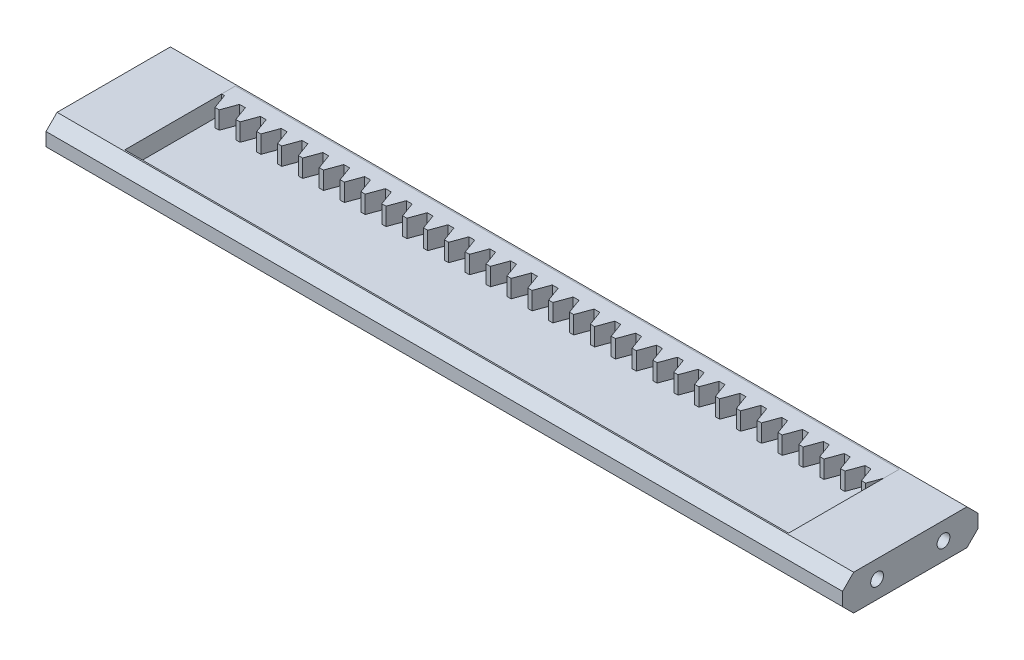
ISO-10303-21;
HEADER;
FILE_DESCRIPTION(('STEP AP214'),'2;1');
FILE_NAME('part.step','',(''),(''),'','','');
FILE_SCHEMA(('AUTOMOTIVE_DESIGN { 1 0 10303 214 1 1 1 1 }'));
ENDSEC;
DATA;
#1=APPLICATION_CONTEXT('core data for automotive mechanical design processes');
#2=APPLICATION_PROTOCOL_DEFINITION('international standard','automotive_design',2000,#1);
#3=PRODUCT_CONTEXT('',#1,'mechanical');
#4=PRODUCT('Part','Part','',(#3));
#5=PRODUCT_RELATED_PRODUCT_CATEGORY('part','',(#4));
#6=PRODUCT_DEFINITION_FORMATION('','',#4);
#7=PRODUCT_DEFINITION_CONTEXT('part definition',#1,'design');
#8=PRODUCT_DEFINITION('design','',#6,#7);
#9=PRODUCT_DEFINITION_SHAPE('','',#8);
#10=(LENGTH_UNIT() NAMED_UNIT(*) SI_UNIT(.MILLI.,.METRE.));
#11=(NAMED_UNIT(*) PLANE_ANGLE_UNIT() SI_UNIT($,.RADIAN.));
#12=(NAMED_UNIT(*) SI_UNIT($,.STERADIAN.) SOLID_ANGLE_UNIT());
#13=UNCERTAINTY_MEASURE_WITH_UNIT(LENGTH_MEASURE(1.E-05),#10,'distance_accuracy_value','');
#14=(GEOMETRIC_REPRESENTATION_CONTEXT(3) GLOBAL_UNCERTAINTY_ASSIGNED_CONTEXT((#13)) GLOBAL_UNIT_ASSIGNED_CONTEXT((#10,
#11,#12)) REPRESENTATION_CONTEXT('',''));
#15=CARTESIAN_POINT('',(0.,0.,0.));
#16=DIRECTION('',(0.,0.,1.));
#17=DIRECTION('',(1.,0.,0.));
#18=AXIS2_PLACEMENT_3D('',#15,#16,#17);
#19=CARTESIAN_POINT('',(-75.,8.00000000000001,-6.));
#20=DIRECTION('',(0.,0.,1.));
#21=DIRECTION('',(0.,-1.,0.));
#22=AXIS2_PLACEMENT_3D('',#19,#20,#21);
#23=PLANE('',#22);
#24=DIRECTION('',(0.,-1.,0.));
#25=VECTOR('',#24,1.);
#26=CARTESIAN_POINT('',(69.2010056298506,8.00000000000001,-6.));
#27=LINE('',#26,#25);
#28=CARTESIAN_POINT('',(69.2010056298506,8.00000000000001,-5.99999999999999));
#29=VERTEX_POINT('',#28);
#30=CARTESIAN_POINT('',(69.2010056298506,4.,-5.99999999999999));
#31=VERTEX_POINT('',#30);
#32=EDGE_CURVE('E989',#29,#31,#27,.T.);
#33=ORIENTED_EDGE('',*,*,#32,.F.);
#34=DIRECTION('',(-1.,0.,0.));
#35=VECTOR('',#34,1.);
#36=CARTESIAN_POINT('',(-75.,8.00000000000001,-6.));
#37=LINE('',#36,#35);
#38=CARTESIAN_POINT('',(68.2547218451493,8.00000000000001,-5.99999999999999));
#39=VERTEX_POINT('',#38);
#40=EDGE_CURVE('E1159',#29,#39,#37,.T.);
#41=ORIENTED_EDGE('',*,*,#40,.T.);
#42=DIRECTION('',(0.,1.,0.));
#43=VECTOR('',#42,1.);
#44=CARTESIAN_POINT('',(68.2547218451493,8.00000000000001,-6.));
#45=LINE('',#44,#43);
#46=CARTESIAN_POINT('',(68.2547218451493,4.,-5.99999999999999));
#47=VERTEX_POINT('',#46);
#48=EDGE_CURVE('E992',#47,#39,#45,.T.);
#49=ORIENTED_EDGE('',*,*,#48,.F.);
#50=DIRECTION('',(-1.,0.,0.));
#51=VECTOR('',#50,1.);
#52=CARTESIAN_POINT('',(-75.,4.,-6.));
#53=LINE('',#52,#51);
#54=EDGE_CURVE('E879',#31,#47,#53,.T.);
#55=ORIENTED_EDGE('',*,*,#54,.F.);
#56=EDGE_LOOP('',(#33,#41,#49,#55));
#57=FACE_BOUND('',#56,.T.);
#58=ADVANCED_FACE('F49',(#57),#23,.T.);
#59=DIRECTION('',(0.,-1.,0.));
#60=VECTOR('',#59,1.);
#61=CARTESIAN_POINT('',(64.4886166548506,8.00000000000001,-6.));
#62=LINE('',#61,#60);
#63=CARTESIAN_POINT('',(64.4886166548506,8.00000000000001,-5.99999999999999));
#64=VERTEX_POINT('',#63);
#65=CARTESIAN_POINT('',(64.4886166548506,4.,-5.99999999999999));
#66=VERTEX_POINT('',#65);
#67=EDGE_CURVE('E1214',#64,#66,#62,.T.);
#68=ORIENTED_EDGE('',*,*,#67,.F.);
#69=CARTESIAN_POINT('',(63.5423328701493,8.00000000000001,-5.99999999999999));
#70=VERTEX_POINT('',#69);
#71=EDGE_CURVE('E2057',#64,#70,#37,.T.);
#72=ORIENTED_EDGE('',*,*,#71,.T.);
#73=DIRECTION('',(0.,1.,0.));
#74=VECTOR('',#73,1.);
#75=CARTESIAN_POINT('',(63.5423328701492,8.00000000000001,-6.));
#76=LINE('',#75,#74);
#77=CARTESIAN_POINT('',(63.5423328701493,4.,-5.99999999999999));
#78=VERTEX_POINT('',#77);
#79=EDGE_CURVE('E1233',#78,#70,#76,.T.);
#80=ORIENTED_EDGE('',*,*,#79,.F.);
#81=EDGE_CURVE('E993',#66,#78,#53,.T.);
#82=ORIENTED_EDGE('',*,*,#81,.F.);
#83=EDGE_LOOP('',(#68,#72,#80,#82));
#84=FACE_BOUND('',#83,.T.);
#85=ADVANCED_FACE('F1894',(#84),#23,.T.);
#86=DIRECTION('',(0.,-1.,0.));
#87=VECTOR('',#86,1.);
#88=CARTESIAN_POINT('',(59.7762276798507,8.00000000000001,-6.));
#89=LINE('',#88,#87);
#90=CARTESIAN_POINT('',(59.7762276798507,8.00000000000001,-6.));
#91=VERTEX_POINT('',#90);
#92=CARTESIAN_POINT('',(59.7762276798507,4.,-6.));
#93=VERTEX_POINT('',#92);
#94=EDGE_CURVE('E1237',#91,#93,#89,.T.);
#95=ORIENTED_EDGE('',*,*,#94,.F.);
#96=CARTESIAN_POINT('',(58.8299438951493,8.00000000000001,-6.));
#97=VERTEX_POINT('',#96);
#98=EDGE_CURVE('E2052',#91,#97,#37,.T.);
#99=ORIENTED_EDGE('',*,*,#98,.T.);
#100=DIRECTION('',(0.,1.,0.));
#101=VECTOR('',#100,1.);
#102=CARTESIAN_POINT('',(58.8299438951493,8.00000000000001,-6.));
#103=LINE('',#102,#101);
#104=CARTESIAN_POINT('',(58.8299438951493,4.,-6.));
#105=VERTEX_POINT('',#104);
#106=EDGE_CURVE('E1256',#105,#97,#103,.T.);
#107=ORIENTED_EDGE('',*,*,#106,.F.);
#108=EDGE_CURVE('E994',#93,#105,#53,.T.);
#109=ORIENTED_EDGE('',*,*,#108,.F.);
#110=EDGE_LOOP('',(#95,#99,#107,#109));
#111=FACE_BOUND('',#110,.T.);
#112=ADVANCED_FACE('F1900',(#111),#23,.T.);
#113=DIRECTION('',(0.,-1.,0.));
#114=VECTOR('',#113,1.);
#115=CARTESIAN_POINT('',(55.0638387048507,8.00000000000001,-6.));
#116=LINE('',#115,#114);
#117=CARTESIAN_POINT('',(55.0638387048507,8.00000000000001,-6.));
#118=VERTEX_POINT('',#117);
#119=CARTESIAN_POINT('',(55.0638387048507,4.,-6.));
#120=VERTEX_POINT('',#119);
#121=EDGE_CURVE('E1260',#118,#120,#116,.T.);
#122=ORIENTED_EDGE('',*,*,#121,.F.);
#123=CARTESIAN_POINT('',(54.1175549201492,8.00000000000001,-6.));
#124=VERTEX_POINT('',#123);
#125=EDGE_CURVE('E2047',#118,#124,#37,.T.);
#126=ORIENTED_EDGE('',*,*,#125,.T.);
#127=DIRECTION('',(0.,1.,0.));
#128=VECTOR('',#127,1.);
#129=CARTESIAN_POINT('',(54.1175549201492,8.00000000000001,-6.));
#130=LINE('',#129,#128);
#131=CARTESIAN_POINT('',(54.1175549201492,4.,-6.));
#132=VERTEX_POINT('',#131);
#133=EDGE_CURVE('E1279',#132,#124,#130,.T.);
#134=ORIENTED_EDGE('',*,*,#133,.F.);
#135=EDGE_CURVE('E998',#120,#132,#53,.T.);
#136=ORIENTED_EDGE('',*,*,#135,.F.);
#137=EDGE_LOOP('',(#122,#126,#134,#136));
#138=FACE_BOUND('',#137,.T.);
#139=ADVANCED_FACE('F2092',(#138),#23,.T.);
#140=DIRECTION('',(0.,-1.,0.));
#141=VECTOR('',#140,1.);
#142=CARTESIAN_POINT('',(50.3514497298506,8.00000000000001,-6.));
#143=LINE('',#142,#141);
#144=CARTESIAN_POINT('',(50.3514497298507,8.00000000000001,-6.));
#145=VERTEX_POINT('',#144);
#146=CARTESIAN_POINT('',(50.3514497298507,4.,-6.));
#147=VERTEX_POINT('',#146);
#148=EDGE_CURVE('E1283',#145,#147,#143,.T.);
#149=ORIENTED_EDGE('',*,*,#148,.F.);
#150=CARTESIAN_POINT('',(49.4051659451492,8.00000000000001,-6.));
#151=VERTEX_POINT('',#150);
#152=EDGE_CURVE('E2042',#145,#151,#37,.T.);
#153=ORIENTED_EDGE('',*,*,#152,.T.);
#154=DIRECTION('',(0.,1.,0.));
#155=VECTOR('',#154,1.);
#156=CARTESIAN_POINT('',(49.4051659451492,8.00000000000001,-6.));
#157=LINE('',#156,#155);
#158=CARTESIAN_POINT('',(49.4051659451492,4.,-6.));
#159=VERTEX_POINT('',#158);
#160=EDGE_CURVE('E1302',#159,#151,#157,.T.);
#161=ORIENTED_EDGE('',*,*,#160,.F.);
#162=EDGE_CURVE('E1002',#147,#159,#53,.T.);
#163=ORIENTED_EDGE('',*,*,#162,.F.);
#164=EDGE_LOOP('',(#149,#153,#161,#163));
#165=FACE_BOUND('',#164,.T.);
#166=ADVANCED_FACE('F2102',(#165),#23,.T.);
#167=DIRECTION('',(0.,-1.,0.));
#168=VECTOR('',#167,1.);
#169=CARTESIAN_POINT('',(45.6390607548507,8.00000000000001,-6.));
#170=LINE('',#169,#168);
#171=CARTESIAN_POINT('',(45.6390607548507,8.00000000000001,-6.));
#172=VERTEX_POINT('',#171);
#173=CARTESIAN_POINT('',(45.6390607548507,4.,-6.));
#174=VERTEX_POINT('',#173);
#175=EDGE_CURVE('E1306',#172,#174,#170,.T.);
#176=ORIENTED_EDGE('',*,*,#175,.F.);
#177=CARTESIAN_POINT('',(44.6927769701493,8.00000000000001,-6.));
#178=VERTEX_POINT('',#177);
#179=EDGE_CURVE('E2037',#172,#178,#37,.T.);
#180=ORIENTED_EDGE('',*,*,#179,.T.);
#181=DIRECTION('',(0.,1.,0.));
#182=VECTOR('',#181,1.);
#183=CARTESIAN_POINT('',(44.6927769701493,8.00000000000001,-6.));
#184=LINE('',#183,#182);
#185=CARTESIAN_POINT('',(44.6927769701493,4.,-6.));
#186=VERTEX_POINT('',#185);
#187=EDGE_CURVE('E1325',#186,#178,#184,.T.);
#188=ORIENTED_EDGE('',*,*,#187,.F.);
#189=EDGE_CURVE('E1006',#174,#186,#53,.T.);
#190=ORIENTED_EDGE('',*,*,#189,.F.);
#191=EDGE_LOOP('',(#176,#180,#188,#190));
#192=FACE_BOUND('',#191,.T.);
#193=ADVANCED_FACE('F2112',(#192),#23,.T.);
#194=DIRECTION('',(0.,-1.,0.));
#195=VECTOR('',#194,1.);
#196=CARTESIAN_POINT('',(40.9266717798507,8.00000000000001,-6.));
#197=LINE('',#196,#195);
#198=CARTESIAN_POINT('',(40.9266717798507,8.00000000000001,-6.));
#199=VERTEX_POINT('',#198);
#200=CARTESIAN_POINT('',(40.9266717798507,4.,-6.));
#201=VERTEX_POINT('',#200);
#202=EDGE_CURVE('E1329',#199,#201,#197,.T.);
#203=ORIENTED_EDGE('',*,*,#202,.F.);
#204=CARTESIAN_POINT('',(39.9803879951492,8.00000000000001,-6.));
#205=VERTEX_POINT('',#204);
#206=EDGE_CURVE('E2032',#199,#205,#37,.T.);
#207=ORIENTED_EDGE('',*,*,#206,.T.);
#208=DIRECTION('',(0.,1.,0.));
#209=VECTOR('',#208,1.);
#210=CARTESIAN_POINT('',(39.9803879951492,8.00000000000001,-6.));
#211=LINE('',#210,#209);
#212=CARTESIAN_POINT('',(39.9803879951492,4.,-6.));
#213=VERTEX_POINT('',#212);
#214=EDGE_CURVE('E1348',#213,#205,#211,.T.);
#215=ORIENTED_EDGE('',*,*,#214,.F.);
#216=EDGE_CURVE('E1010',#201,#213,#53,.T.);
#217=ORIENTED_EDGE('',*,*,#216,.F.);
#218=EDGE_LOOP('',(#203,#207,#215,#217));
#219=FACE_BOUND('',#218,.T.);
#220=ADVANCED_FACE('F2122',(#219),#23,.T.);
#221=DIRECTION('',(0.,-1.,0.));
#222=VECTOR('',#221,1.);
#223=CARTESIAN_POINT('',(36.2142828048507,8.00000000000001,-6.));
#224=LINE('',#223,#222);
#225=CARTESIAN_POINT('',(36.2142828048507,8.00000000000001,-6.));
#226=VERTEX_POINT('',#225);
#227=CARTESIAN_POINT('',(36.2142828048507,4.,-6.));
#228=VERTEX_POINT('',#227);
#229=EDGE_CURVE('E1352',#226,#228,#224,.T.);
#230=ORIENTED_EDGE('',*,*,#229,.F.);
#231=CARTESIAN_POINT('',(35.2679990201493,8.00000000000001,-6.));
#232=VERTEX_POINT('',#231);
#233=EDGE_CURVE('E2027',#226,#232,#37,.T.);
#234=ORIENTED_EDGE('',*,*,#233,.T.);
#235=DIRECTION('',(0.,1.,0.));
#236=VECTOR('',#235,1.);
#237=CARTESIAN_POINT('',(35.2679990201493,8.00000000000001,-6.));
#238=LINE('',#237,#236);
#239=CARTESIAN_POINT('',(35.2679990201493,4.,-6.));
#240=VERTEX_POINT('',#239);
#241=EDGE_CURVE('E1371',#240,#232,#238,.T.);
#242=ORIENTED_EDGE('',*,*,#241,.F.);
#243=EDGE_CURVE('E1014',#228,#240,#53,.T.);
#244=ORIENTED_EDGE('',*,*,#243,.F.);
#245=EDGE_LOOP('',(#230,#234,#242,#244));
#246=FACE_BOUND('',#245,.T.);
#247=ADVANCED_FACE('F2132',(#246),#23,.T.);
#248=DIRECTION('',(0.,-1.,0.));
#249=VECTOR('',#248,1.);
#250=CARTESIAN_POINT('',(31.5018938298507,8.00000000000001,-6.));
#251=LINE('',#250,#249);
#252=CARTESIAN_POINT('',(31.5018938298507,8.00000000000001,-5.99999999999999));
#253=VERTEX_POINT('',#252);
#254=CARTESIAN_POINT('',(31.5018938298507,4.,-5.99999999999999));
#255=VERTEX_POINT('',#254);
#256=EDGE_CURVE('E1375',#253,#255,#251,.T.);
#257=ORIENTED_EDGE('',*,*,#256,.F.);
#258=CARTESIAN_POINT('',(30.5556100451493,8.00000000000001,-6.));
#259=VERTEX_POINT('',#258);
#260=EDGE_CURVE('E2022',#253,#259,#37,.T.);
#261=ORIENTED_EDGE('',*,*,#260,.T.);
#262=DIRECTION('',(0.,1.,0.));
#263=VECTOR('',#262,1.);
#264=CARTESIAN_POINT('',(30.5556100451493,8.00000000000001,-6.));
#265=LINE('',#264,#263);
#266=CARTESIAN_POINT('',(30.5556100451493,4.,-6.));
#267=VERTEX_POINT('',#266);
#268=EDGE_CURVE('E1394',#267,#259,#265,.T.);
#269=ORIENTED_EDGE('',*,*,#268,.F.);
#270=EDGE_CURVE('E1018',#255,#267,#53,.T.);
#271=ORIENTED_EDGE('',*,*,#270,.F.);
#272=EDGE_LOOP('',(#257,#261,#269,#271));
#273=FACE_BOUND('',#272,.T.);
#274=ADVANCED_FACE('F2142',(#273),#23,.T.);
#275=DIRECTION('',(0.,-1.,0.));
#276=VECTOR('',#275,1.);
#277=CARTESIAN_POINT('',(26.7895048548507,8.00000000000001,-6.));
#278=LINE('',#277,#276);
#279=CARTESIAN_POINT('',(26.7895048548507,8.00000000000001,-6.));
#280=VERTEX_POINT('',#279);
#281=CARTESIAN_POINT('',(26.7895048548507,4.,-6.));
#282=VERTEX_POINT('',#281);
#283=EDGE_CURVE('E1398',#280,#282,#278,.T.);
#284=ORIENTED_EDGE('',*,*,#283,.F.);
#285=CARTESIAN_POINT('',(25.8432210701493,8.00000000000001,-6.));
#286=VERTEX_POINT('',#285);
#287=EDGE_CURVE('E2017',#280,#286,#37,.T.);
#288=ORIENTED_EDGE('',*,*,#287,.T.);
#289=DIRECTION('',(0.,1.,0.));
#290=VECTOR('',#289,1.);
#291=CARTESIAN_POINT('',(25.8432210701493,8.00000000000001,-6.));
#292=LINE('',#291,#290);
#293=CARTESIAN_POINT('',(25.8432210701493,4.,-6.));
#294=VERTEX_POINT('',#293);
#295=EDGE_CURVE('E1417',#294,#286,#292,.T.);
#296=ORIENTED_EDGE('',*,*,#295,.F.);
#297=EDGE_CURVE('E1022',#282,#294,#53,.T.);
#298=ORIENTED_EDGE('',*,*,#297,.F.);
#299=EDGE_LOOP('',(#284,#288,#296,#298));
#300=FACE_BOUND('',#299,.T.);
#301=ADVANCED_FACE('F2152',(#300),#23,.T.);
#302=DIRECTION('',(0.,-1.,0.));
#303=VECTOR('',#302,1.);
#304=CARTESIAN_POINT('',(22.0771158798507,8.00000000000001,-6.));
#305=LINE('',#304,#303);
#306=CARTESIAN_POINT('',(22.0771158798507,8.00000000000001,-6.));
#307=VERTEX_POINT('',#306);
#308=CARTESIAN_POINT('',(22.0771158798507,4.,-6.));
#309=VERTEX_POINT('',#308);
#310=EDGE_CURVE('E1421',#307,#309,#305,.T.);
#311=ORIENTED_EDGE('',*,*,#310,.F.);
#312=CARTESIAN_POINT('',(21.1308320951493,8.00000000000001,-6.));
#313=VERTEX_POINT('',#312);
#314=EDGE_CURVE('E2012',#307,#313,#37,.T.);
#315=ORIENTED_EDGE('',*,*,#314,.T.);
#316=DIRECTION('',(0.,1.,0.));
#317=VECTOR('',#316,1.);
#318=CARTESIAN_POINT('',(21.1308320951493,8.00000000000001,-6.));
#319=LINE('',#318,#317);
#320=CARTESIAN_POINT('',(21.1308320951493,4.,-6.));
#321=VERTEX_POINT('',#320);
#322=EDGE_CURVE('E1440',#321,#313,#319,.T.);
#323=ORIENTED_EDGE('',*,*,#322,.F.);
#324=EDGE_CURVE('E1026',#309,#321,#53,.T.);
#325=ORIENTED_EDGE('',*,*,#324,.F.);
#326=EDGE_LOOP('',(#311,#315,#323,#325));
#327=FACE_BOUND('',#326,.T.);
#328=ADVANCED_FACE('F2162',(#327),#23,.T.);
#329=DIRECTION('',(0.,-1.,0.));
#330=VECTOR('',#329,1.);
#331=CARTESIAN_POINT('',(17.3647269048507,8.00000000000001,-6.));
#332=LINE('',#331,#330);
#333=CARTESIAN_POINT('',(17.3647269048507,8.00000000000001,-6.));
#334=VERTEX_POINT('',#333);
#335=CARTESIAN_POINT('',(17.3647269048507,4.,-6.));
#336=VERTEX_POINT('',#335);
#337=EDGE_CURVE('E1444',#334,#336,#332,.T.);
#338=ORIENTED_EDGE('',*,*,#337,.F.);
#339=CARTESIAN_POINT('',(16.4184431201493,8.00000000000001,-5.99999999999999));
#340=VERTEX_POINT('',#339);
#341=EDGE_CURVE('E2007',#334,#340,#37,.T.);
#342=ORIENTED_EDGE('',*,*,#341,.T.);
#343=DIRECTION('',(0.,1.,0.));
#344=VECTOR('',#343,1.);
#345=CARTESIAN_POINT('',(16.4184431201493,8.00000000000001,-6.));
#346=LINE('',#345,#344);
#347=CARTESIAN_POINT('',(16.4184431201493,4.,-5.99999999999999));
#348=VERTEX_POINT('',#347);
#349=EDGE_CURVE('E1463',#348,#340,#346,.T.);
#350=ORIENTED_EDGE('',*,*,#349,.F.);
#351=EDGE_CURVE('E1030',#336,#348,#53,.T.);
#352=ORIENTED_EDGE('',*,*,#351,.F.);
#353=EDGE_LOOP('',(#338,#342,#350,#352));
#354=FACE_BOUND('',#353,.T.);
#355=ADVANCED_FACE('F2172',(#354),#23,.T.);
#356=DIRECTION('',(0.,-1.,0.));
#357=VECTOR('',#356,1.);
#358=CARTESIAN_POINT('',(12.6523379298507,8.00000000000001,-6.));
#359=LINE('',#358,#357);
#360=CARTESIAN_POINT('',(12.6523379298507,8.00000000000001,-6.));
#361=VERTEX_POINT('',#360);
#362=CARTESIAN_POINT('',(12.6523379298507,4.,-6.));
#363=VERTEX_POINT('',#362);
#364=EDGE_CURVE('E1467',#361,#363,#359,.T.);
#365=ORIENTED_EDGE('',*,*,#364,.F.);
#366=CARTESIAN_POINT('',(11.7060541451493,8.00000000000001,-6.00000000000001));
#367=VERTEX_POINT('',#366);
#368=EDGE_CURVE('E2002',#361,#367,#37,.T.);
#369=ORIENTED_EDGE('',*,*,#368,.T.);
#370=DIRECTION('',(0.,1.,0.));
#371=VECTOR('',#370,1.);
#372=CARTESIAN_POINT('',(11.7060541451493,8.00000000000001,-6.));
#373=LINE('',#372,#371);
#374=CARTESIAN_POINT('',(11.7060541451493,4.,-6.00000000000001));
#375=VERTEX_POINT('',#374);
#376=EDGE_CURVE('E1486',#375,#367,#373,.T.);
#377=ORIENTED_EDGE('',*,*,#376,.F.);
#378=EDGE_CURVE('E1034',#363,#375,#53,.T.);
#379=ORIENTED_EDGE('',*,*,#378,.F.);
#380=EDGE_LOOP('',(#365,#369,#377,#379));
#381=FACE_BOUND('',#380,.T.);
#382=ADVANCED_FACE('F2182',(#381),#23,.T.);
#383=DIRECTION('',(0.,-1.,0.));
#384=VECTOR('',#383,1.);
#385=CARTESIAN_POINT('',(7.93994895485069,8.00000000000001,-6.));
#386=LINE('',#385,#384);
#387=CARTESIAN_POINT('',(7.93994895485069,8.00000000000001,-6.00000000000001));
#388=VERTEX_POINT('',#387);
#389=CARTESIAN_POINT('',(7.93994895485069,4.,-6.00000000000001));
#390=VERTEX_POINT('',#389);
#391=EDGE_CURVE('E1490',#388,#390,#386,.T.);
#392=ORIENTED_EDGE('',*,*,#391,.F.);
#393=CARTESIAN_POINT('',(6.99366517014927,8.00000000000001,-6.));
#394=VERTEX_POINT('',#393);
#395=EDGE_CURVE('E1997',#388,#394,#37,.T.);
#396=ORIENTED_EDGE('',*,*,#395,.T.);
#397=DIRECTION('',(0.,1.,0.));
#398=VECTOR('',#397,1.);
#399=CARTESIAN_POINT('',(6.99366517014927,8.00000000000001,-6.));
#400=LINE('',#399,#398);
#401=CARTESIAN_POINT('',(6.99366517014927,4.,-6.));
#402=VERTEX_POINT('',#401);
#403=EDGE_CURVE('E1509',#402,#394,#400,.T.);
#404=ORIENTED_EDGE('',*,*,#403,.F.);
#405=EDGE_CURVE('E1038',#390,#402,#53,.T.);
#406=ORIENTED_EDGE('',*,*,#405,.F.);
#407=EDGE_LOOP('',(#392,#396,#404,#406));
#408=FACE_BOUND('',#407,.T.);
#409=ADVANCED_FACE('F2192',(#408),#23,.T.);
#410=DIRECTION('',(0.,-1.,0.));
#411=VECTOR('',#410,1.);
#412=CARTESIAN_POINT('',(3.22755997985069,8.00000000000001,-6.));
#413=LINE('',#412,#411);
#414=CARTESIAN_POINT('',(3.22755997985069,8.00000000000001,-6.00000000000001));
#415=VERTEX_POINT('',#414);
#416=CARTESIAN_POINT('',(3.22755997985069,4.,-6.00000000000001));
#417=VERTEX_POINT('',#416);
#418=EDGE_CURVE('E1513',#415,#417,#413,.T.);
#419=ORIENTED_EDGE('',*,*,#418,.F.);
#420=CARTESIAN_POINT('',(2.28127619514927,8.00000000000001,-6.));
#421=VERTEX_POINT('',#420);
#422=EDGE_CURVE('E1992',#415,#421,#37,.T.);
#423=ORIENTED_EDGE('',*,*,#422,.T.);
#424=DIRECTION('',(0.,1.,0.));
#425=VECTOR('',#424,1.);
#426=CARTESIAN_POINT('',(2.28127619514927,8.00000000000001,-6.));
#427=LINE('',#426,#425);
#428=CARTESIAN_POINT('',(2.28127619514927,4.,-6.));
#429=VERTEX_POINT('',#428);
#430=EDGE_CURVE('E1532',#429,#421,#427,.T.);
#431=ORIENTED_EDGE('',*,*,#430,.F.);
#432=EDGE_CURVE('E1042',#417,#429,#53,.T.);
#433=ORIENTED_EDGE('',*,*,#432,.F.);
#434=EDGE_LOOP('',(#419,#423,#431,#433));
#435=FACE_BOUND('',#434,.T.);
#436=ADVANCED_FACE('F2202',(#435),#23,.T.);
#437=DIRECTION('',(0.,-1.,0.));
#438=VECTOR('',#437,1.);
#439=CARTESIAN_POINT('',(-1.4848289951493,8.00000000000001,-6.));
#440=LINE('',#439,#438);
#441=CARTESIAN_POINT('',(-1.4848289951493,8.00000000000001,-6.00000000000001));
#442=VERTEX_POINT('',#441);
#443=CARTESIAN_POINT('',(-1.4848289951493,4.,-6.00000000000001));
#444=VERTEX_POINT('',#443);
#445=EDGE_CURVE('E1536',#442,#444,#440,.T.);
#446=ORIENTED_EDGE('',*,*,#445,.F.);
#447=CARTESIAN_POINT('',(-2.43111277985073,8.00000000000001,-6.00000000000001));
#448=VERTEX_POINT('',#447);
#449=EDGE_CURVE('E1987',#442,#448,#37,.T.);
#450=ORIENTED_EDGE('',*,*,#449,.T.);
#451=DIRECTION('',(0.,1.,0.));
#452=VECTOR('',#451,1.);
#453=CARTESIAN_POINT('',(-2.43111277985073,8.00000000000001,-6.));
#454=LINE('',#453,#452);
#455=CARTESIAN_POINT('',(-2.43111277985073,4.,-6.00000000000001));
#456=VERTEX_POINT('',#455);
#457=EDGE_CURVE('E1555',#456,#448,#454,.T.);
#458=ORIENTED_EDGE('',*,*,#457,.F.);
#459=EDGE_CURVE('E1046',#444,#456,#53,.T.);
#460=ORIENTED_EDGE('',*,*,#459,.F.);
#461=EDGE_LOOP('',(#446,#450,#458,#460));
#462=FACE_BOUND('',#461,.T.);
#463=ADVANCED_FACE('F2212',(#462),#23,.T.);
#464=DIRECTION('',(0.,-1.,0.));
#465=VECTOR('',#464,1.);
#466=CARTESIAN_POINT('',(-6.1972179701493,8.00000000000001,-6.));
#467=LINE('',#466,#465);
#468=CARTESIAN_POINT('',(-6.1972179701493,8.00000000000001,-6.00000000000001));
#469=VERTEX_POINT('',#468);
#470=CARTESIAN_POINT('',(-6.1972179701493,4.,-6.00000000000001));
#471=VERTEX_POINT('',#470);
#472=EDGE_CURVE('E1559',#469,#471,#467,.T.);
#473=ORIENTED_EDGE('',*,*,#472,.F.);
#474=CARTESIAN_POINT('',(-7.14350175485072,8.00000000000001,-6.00000000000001));
#475=VERTEX_POINT('',#474);
#476=EDGE_CURVE('E1982',#469,#475,#37,.T.);
#477=ORIENTED_EDGE('',*,*,#476,.T.);
#478=DIRECTION('',(0.,1.,0.));
#479=VECTOR('',#478,1.);
#480=CARTESIAN_POINT('',(-7.14350175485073,8.00000000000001,-6.));
#481=LINE('',#480,#479);
#482=CARTESIAN_POINT('',(-7.14350175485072,4.,-6.00000000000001));
#483=VERTEX_POINT('',#482);
#484=EDGE_CURVE('E1578',#483,#475,#481,.T.);
#485=ORIENTED_EDGE('',*,*,#484,.F.);
#486=EDGE_CURVE('E1050',#471,#483,#53,.T.);
#487=ORIENTED_EDGE('',*,*,#486,.F.);
#488=EDGE_LOOP('',(#473,#477,#485,#487));
#489=FACE_BOUND('',#488,.T.);
#490=ADVANCED_FACE('F2222',(#489),#23,.T.);
#491=DIRECTION('',(0.,-1.,0.));
#492=VECTOR('',#491,1.);
#493=CARTESIAN_POINT('',(-10.9096069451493,8.00000000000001,-6.));
#494=LINE('',#493,#492);
#495=CARTESIAN_POINT('',(-10.9096069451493,8.00000000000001,-6.00000000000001));
#496=VERTEX_POINT('',#495);
#497=CARTESIAN_POINT('',(-10.9096069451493,4.,-6.00000000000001));
#498=VERTEX_POINT('',#497);
#499=EDGE_CURVE('E1582',#496,#498,#494,.T.);
#500=ORIENTED_EDGE('',*,*,#499,.F.);
#501=CARTESIAN_POINT('',(-11.8558907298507,8.00000000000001,-6.00000000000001));
#502=VERTEX_POINT('',#501);
#503=EDGE_CURVE('E1977',#496,#502,#37,.T.);
#504=ORIENTED_EDGE('',*,*,#503,.T.);
#505=DIRECTION('',(0.,1.,0.));
#506=VECTOR('',#505,1.);
#507=CARTESIAN_POINT('',(-11.8558907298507,8.00000000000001,-6.));
#508=LINE('',#507,#506);
#509=CARTESIAN_POINT('',(-11.8558907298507,4.,-6.00000000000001));
#510=VERTEX_POINT('',#509);
#511=EDGE_CURVE('E1601',#510,#502,#508,.T.);
#512=ORIENTED_EDGE('',*,*,#511,.F.);
#513=EDGE_CURVE('E1054',#498,#510,#53,.T.);
#514=ORIENTED_EDGE('',*,*,#513,.F.);
#515=EDGE_LOOP('',(#500,#504,#512,#514));
#516=FACE_BOUND('',#515,.T.);
#517=ADVANCED_FACE('F2232',(#516),#23,.T.);
#518=DIRECTION('',(0.,-1.,0.));
#519=VECTOR('',#518,1.);
#520=CARTESIAN_POINT('',(-15.6219959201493,8.00000000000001,-6.));
#521=LINE('',#520,#519);
#522=CARTESIAN_POINT('',(-15.6219959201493,8.00000000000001,-6.00000000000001));
#523=VERTEX_POINT('',#522);
#524=CARTESIAN_POINT('',(-15.6219959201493,4.,-6.00000000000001));
#525=VERTEX_POINT('',#524);
#526=EDGE_CURVE('E1605',#523,#525,#521,.T.);
#527=ORIENTED_EDGE('',*,*,#526,.F.);
#528=CARTESIAN_POINT('',(-16.5682797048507,8.00000000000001,-6.00000000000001));
#529=VERTEX_POINT('',#528);
#530=EDGE_CURVE('E1972',#523,#529,#37,.T.);
#531=ORIENTED_EDGE('',*,*,#530,.T.);
#532=DIRECTION('',(0.,1.,0.));
#533=VECTOR('',#532,1.);
#534=CARTESIAN_POINT('',(-16.5682797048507,8.00000000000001,-6.));
#535=LINE('',#534,#533);
#536=CARTESIAN_POINT('',(-16.5682797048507,4.,-6.00000000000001));
#537=VERTEX_POINT('',#536);
#538=EDGE_CURVE('E1624',#537,#529,#535,.T.);
#539=ORIENTED_EDGE('',*,*,#538,.F.);
#540=EDGE_CURVE('E1058',#525,#537,#53,.T.);
#541=ORIENTED_EDGE('',*,*,#540,.F.);
#542=EDGE_LOOP('',(#527,#531,#539,#541));
#543=FACE_BOUND('',#542,.T.);
#544=ADVANCED_FACE('F2242',(#543),#23,.T.);
#545=DIRECTION('',(0.,-1.,0.));
#546=VECTOR('',#545,1.);
#547=CARTESIAN_POINT('',(-20.3343848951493,8.00000000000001,-6.));
#548=LINE('',#547,#546);
#549=CARTESIAN_POINT('',(-20.3343848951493,8.00000000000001,-6.00000000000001));
#550=VERTEX_POINT('',#549);
#551=CARTESIAN_POINT('',(-20.3343848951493,4.,-6.00000000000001));
#552=VERTEX_POINT('',#551);
#553=EDGE_CURVE('E1628',#550,#552,#548,.T.);
#554=ORIENTED_EDGE('',*,*,#553,.F.);
#555=CARTESIAN_POINT('',(-21.2806686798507,8.00000000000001,-6.));
#556=VERTEX_POINT('',#555);
#557=EDGE_CURVE('E1967',#550,#556,#37,.T.);
#558=ORIENTED_EDGE('',*,*,#557,.T.);
#559=DIRECTION('',(0.,1.,0.));
#560=VECTOR('',#559,1.);
#561=CARTESIAN_POINT('',(-21.2806686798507,8.00000000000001,-6.));
#562=LINE('',#561,#560);
#563=CARTESIAN_POINT('',(-21.2806686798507,4.,-6.));
#564=VERTEX_POINT('',#563);
#565=EDGE_CURVE('E1647',#564,#556,#562,.T.);
#566=ORIENTED_EDGE('',*,*,#565,.F.);
#567=EDGE_CURVE('E1062',#552,#564,#53,.T.);
#568=ORIENTED_EDGE('',*,*,#567,.F.);
#569=EDGE_LOOP('',(#554,#558,#566,#568));
#570=FACE_BOUND('',#569,.T.);
#571=ADVANCED_FACE('F2252',(#570),#23,.T.);
#572=DIRECTION('',(0.,-1.,0.));
#573=VECTOR('',#572,1.);
#574=CARTESIAN_POINT('',(-25.0467738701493,8.00000000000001,-6.));
#575=LINE('',#574,#573);
#576=CARTESIAN_POINT('',(-25.0467738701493,8.00000000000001,-6.));
#577=VERTEX_POINT('',#576);
#578=CARTESIAN_POINT('',(-25.0467738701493,4.,-6.));
#579=VERTEX_POINT('',#578);
#580=EDGE_CURVE('E1651',#577,#579,#575,.T.);
#581=ORIENTED_EDGE('',*,*,#580,.F.);
#582=CARTESIAN_POINT('',(-25.9930576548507,8.00000000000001,-6.));
#583=VERTEX_POINT('',#582);
#584=EDGE_CURVE('E1962',#577,#583,#37,.T.);
#585=ORIENTED_EDGE('',*,*,#584,.T.);
#586=DIRECTION('',(0.,1.,0.));
#587=VECTOR('',#586,1.);
#588=CARTESIAN_POINT('',(-25.9930576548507,8.00000000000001,-6.));
#589=LINE('',#588,#587);
#590=CARTESIAN_POINT('',(-25.9930576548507,4.,-6.));
#591=VERTEX_POINT('',#590);
#592=EDGE_CURVE('E1670',#591,#583,#589,.T.);
#593=ORIENTED_EDGE('',*,*,#592,.F.);
#594=EDGE_CURVE('E1066',#579,#591,#53,.T.);
#595=ORIENTED_EDGE('',*,*,#594,.F.);
#596=EDGE_LOOP('',(#581,#585,#593,#595));
#597=FACE_BOUND('',#596,.T.);
#598=ADVANCED_FACE('F2262',(#597),#23,.T.);
#599=DIRECTION('',(0.,-1.,0.));
#600=VECTOR('',#599,1.);
#601=CARTESIAN_POINT('',(-29.7591628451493,8.00000000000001,-6.));
#602=LINE('',#601,#600);
#603=CARTESIAN_POINT('',(-29.7591628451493,8.00000000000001,-6.00000000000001));
#604=VERTEX_POINT('',#603);
#605=CARTESIAN_POINT('',(-29.7591628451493,4.,-6.00000000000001));
#606=VERTEX_POINT('',#605);
#607=EDGE_CURVE('E1674',#604,#606,#602,.T.);
#608=ORIENTED_EDGE('',*,*,#607,.F.);
#609=CARTESIAN_POINT('',(-30.7054466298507,8.00000000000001,-6.));
#610=VERTEX_POINT('',#609);
#611=EDGE_CURVE('E1957',#604,#610,#37,.T.);
#612=ORIENTED_EDGE('',*,*,#611,.T.);
#613=DIRECTION('',(0.,1.,0.));
#614=VECTOR('',#613,1.);
#615=CARTESIAN_POINT('',(-30.7054466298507,8.00000000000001,-6.));
#616=LINE('',#615,#614);
#617=CARTESIAN_POINT('',(-30.7054466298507,4.,-6.));
#618=VERTEX_POINT('',#617);
#619=EDGE_CURVE('E1693',#618,#610,#616,.T.);
#620=ORIENTED_EDGE('',*,*,#619,.F.);
#621=EDGE_CURVE('E1070',#606,#618,#53,.T.);
#622=ORIENTED_EDGE('',*,*,#621,.F.);
#623=EDGE_LOOP('',(#608,#612,#620,#622));
#624=FACE_BOUND('',#623,.T.);
#625=ADVANCED_FACE('F2272',(#624),#23,.T.);
#626=DIRECTION('',(0.,-1.,0.));
#627=VECTOR('',#626,1.);
#628=CARTESIAN_POINT('',(-34.4715518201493,8.00000000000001,-6.));
#629=LINE('',#628,#627);
#630=CARTESIAN_POINT('',(-34.4715518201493,8.00000000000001,-6.00000000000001));
#631=VERTEX_POINT('',#630);
#632=CARTESIAN_POINT('',(-34.4715518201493,4.,-6.00000000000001));
#633=VERTEX_POINT('',#632);
#634=EDGE_CURVE('E1697',#631,#633,#629,.T.);
#635=ORIENTED_EDGE('',*,*,#634,.F.);
#636=CARTESIAN_POINT('',(-35.4178356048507,8.00000000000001,-6.));
#637=VERTEX_POINT('',#636);
#638=EDGE_CURVE('E1952',#631,#637,#37,.T.);
#639=ORIENTED_EDGE('',*,*,#638,.T.);
#640=DIRECTION('',(0.,1.,0.));
#641=VECTOR('',#640,1.);
#642=CARTESIAN_POINT('',(-35.4178356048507,8.00000000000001,-6.));
#643=LINE('',#642,#641);
#644=CARTESIAN_POINT('',(-35.4178356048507,4.,-6.));
#645=VERTEX_POINT('',#644);
#646=EDGE_CURVE('E1716',#645,#637,#643,.T.);
#647=ORIENTED_EDGE('',*,*,#646,.F.);
#648=EDGE_CURVE('E1074',#633,#645,#53,.T.);
#649=ORIENTED_EDGE('',*,*,#648,.F.);
#650=EDGE_LOOP('',(#635,#639,#647,#649));
#651=FACE_BOUND('',#650,.T.);
#652=ADVANCED_FACE('F2282',(#651),#23,.T.);
#653=DIRECTION('',(0.,-1.,0.));
#654=VECTOR('',#653,1.);
#655=CARTESIAN_POINT('',(-39.1839407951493,8.00000000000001,-6.));
#656=LINE('',#655,#654);
#657=CARTESIAN_POINT('',(-39.1839407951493,8.00000000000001,-6.));
#658=VERTEX_POINT('',#657);
#659=CARTESIAN_POINT('',(-39.1839407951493,4.,-6.));
#660=VERTEX_POINT('',#659);
#661=EDGE_CURVE('E1720',#658,#660,#656,.T.);
#662=ORIENTED_EDGE('',*,*,#661,.F.);
#663=CARTESIAN_POINT('',(-40.1302245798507,8.00000000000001,-6.));
#664=VERTEX_POINT('',#663);
#665=EDGE_CURVE('E1947',#658,#664,#37,.T.);
#666=ORIENTED_EDGE('',*,*,#665,.T.);
#667=DIRECTION('',(0.,1.,0.));
#668=VECTOR('',#667,1.);
#669=CARTESIAN_POINT('',(-40.1302245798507,8.00000000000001,-6.));
#670=LINE('',#669,#668);
#671=CARTESIAN_POINT('',(-40.1302245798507,4.,-6.));
#672=VERTEX_POINT('',#671);
#673=EDGE_CURVE('E1739',#672,#664,#670,.T.);
#674=ORIENTED_EDGE('',*,*,#673,.F.);
#675=EDGE_CURVE('E1078',#660,#672,#53,.T.);
#676=ORIENTED_EDGE('',*,*,#675,.F.);
#677=EDGE_LOOP('',(#662,#666,#674,#676));
#678=FACE_BOUND('',#677,.T.);
#679=ADVANCED_FACE('F2292',(#678),#23,.T.);
#680=DIRECTION('',(0.,-1.,0.));
#681=VECTOR('',#680,1.);
#682=CARTESIAN_POINT('',(-43.8963297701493,8.00000000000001,-6.));
#683=LINE('',#682,#681);
#684=CARTESIAN_POINT('',(-43.8963297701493,8.00000000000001,-6.));
#685=VERTEX_POINT('',#684);
#686=CARTESIAN_POINT('',(-43.8963297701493,4.,-6.));
#687=VERTEX_POINT('',#686);
#688=EDGE_CURVE('E1743',#685,#687,#683,.T.);
#689=ORIENTED_EDGE('',*,*,#688,.F.);
#690=CARTESIAN_POINT('',(-44.8426135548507,8.00000000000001,-6.));
#691=VERTEX_POINT('',#690);
#692=EDGE_CURVE('E1942',#685,#691,#37,.T.);
#693=ORIENTED_EDGE('',*,*,#692,.T.);
#694=DIRECTION('',(0.,1.,0.));
#695=VECTOR('',#694,1.);
#696=CARTESIAN_POINT('',(-44.8426135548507,8.00000000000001,-6.));
#697=LINE('',#696,#695);
#698=CARTESIAN_POINT('',(-44.8426135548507,4.,-6.));
#699=VERTEX_POINT('',#698);
#700=EDGE_CURVE('E1762',#699,#691,#697,.T.);
#701=ORIENTED_EDGE('',*,*,#700,.F.);
#702=EDGE_CURVE('E1082',#687,#699,#53,.T.);
#703=ORIENTED_EDGE('',*,*,#702,.F.);
#704=EDGE_LOOP('',(#689,#693,#701,#703));
#705=FACE_BOUND('',#704,.T.);
#706=ADVANCED_FACE('F2302',(#705),#23,.T.);
#707=DIRECTION('',(0.,-1.,0.));
#708=VECTOR('',#707,1.);
#709=CARTESIAN_POINT('',(-48.6087187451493,8.00000000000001,-6.));
#710=LINE('',#709,#708);
#711=CARTESIAN_POINT('',(-48.6087187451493,8.00000000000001,-6.));
#712=VERTEX_POINT('',#711);
#713=CARTESIAN_POINT('',(-48.6087187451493,4.,-6.));
#714=VERTEX_POINT('',#713);
#715=EDGE_CURVE('E1766',#712,#714,#710,.T.);
#716=ORIENTED_EDGE('',*,*,#715,.F.);
#717=CARTESIAN_POINT('',(-49.5550025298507,8.00000000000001,-6.00000000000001));
#718=VERTEX_POINT('',#717);
#719=EDGE_CURVE('E1937',#712,#718,#37,.T.);
#720=ORIENTED_EDGE('',*,*,#719,.T.);
#721=DIRECTION('',(0.,1.,0.));
#722=VECTOR('',#721,1.);
#723=CARTESIAN_POINT('',(-49.5550025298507,8.00000000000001,-6.));
#724=LINE('',#723,#722);
#725=CARTESIAN_POINT('',(-49.5550025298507,4.,-6.00000000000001));
#726=VERTEX_POINT('',#725);
#727=EDGE_CURVE('E1785',#726,#718,#724,.T.);
#728=ORIENTED_EDGE('',*,*,#727,.F.);
#729=EDGE_CURVE('E1086',#714,#726,#53,.T.);
#730=ORIENTED_EDGE('',*,*,#729,.F.);
#731=EDGE_LOOP('',(#716,#720,#728,#730));
#732=FACE_BOUND('',#731,.T.);
#733=ADVANCED_FACE('F2312',(#732),#23,.T.);
#734=DIRECTION('',(0.,-1.,0.));
#735=VECTOR('',#734,1.);
#736=CARTESIAN_POINT('',(-53.3211077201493,8.00000000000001,-6.));
#737=LINE('',#736,#735);
#738=CARTESIAN_POINT('',(-53.3211077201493,8.00000000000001,-6.00000000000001));
#739=VERTEX_POINT('',#738);
#740=CARTESIAN_POINT('',(-53.3211077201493,4.,-6.00000000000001));
#741=VERTEX_POINT('',#740);
#742=EDGE_CURVE('E1789',#739,#741,#737,.T.);
#743=ORIENTED_EDGE('',*,*,#742,.F.);
#744=CARTESIAN_POINT('',(-54.2673915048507,8.00000000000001,-6.));
#745=VERTEX_POINT('',#744);
#746=EDGE_CURVE('E1933',#739,#745,#37,.T.);
#747=ORIENTED_EDGE('',*,*,#746,.T.);
#748=DIRECTION('',(0.,1.,0.));
#749=VECTOR('',#748,1.);
#750=CARTESIAN_POINT('',(-54.2673915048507,8.00000000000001,-6.));
#751=LINE('',#750,#749);
#752=CARTESIAN_POINT('',(-54.2673915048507,4.,-6.));
#753=VERTEX_POINT('',#752);
#754=EDGE_CURVE('E1808',#753,#745,#751,.T.);
#755=ORIENTED_EDGE('',*,*,#754,.F.);
#756=EDGE_CURVE('E1090',#741,#753,#53,.T.);
#757=ORIENTED_EDGE('',*,*,#756,.F.);
#758=EDGE_LOOP('',(#743,#747,#755,#757));
#759=FACE_BOUND('',#758,.T.);
#760=ADVANCED_FACE('F1923',(#759),#23,.T.);
#761=DIRECTION('',(0.,-1.,0.));
#762=VECTOR('',#761,1.);
#763=CARTESIAN_POINT('',(-58.0334966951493,8.00000000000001,-6.));
#764=LINE('',#763,#762);
#765=CARTESIAN_POINT('',(-58.0334966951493,8.00000000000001,-6.));
#766=VERTEX_POINT('',#765);
#767=CARTESIAN_POINT('',(-58.0334966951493,4.,-6.));
#768=VERTEX_POINT('',#767);
#769=EDGE_CURVE('E1812',#766,#768,#764,.T.);
#770=ORIENTED_EDGE('',*,*,#769,.F.);
#771=CARTESIAN_POINT('',(-58.9797804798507,8.00000000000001,-6.00000000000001));
#772=VERTEX_POINT('',#771);
#773=EDGE_CURVE('E1932',#766,#772,#37,.T.);
#774=ORIENTED_EDGE('',*,*,#773,.T.);
#775=DIRECTION('',(0.,1.,0.));
#776=VECTOR('',#775,1.);
#777=CARTESIAN_POINT('',(-58.9797804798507,8.00000000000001,-6.));
#778=LINE('',#777,#776);
#779=CARTESIAN_POINT('',(-58.9797804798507,4.,-6.00000000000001));
#780=VERTEX_POINT('',#779);
#781=EDGE_CURVE('E1831',#780,#772,#778,.T.);
#782=ORIENTED_EDGE('',*,*,#781,.F.);
#783=EDGE_CURVE('E1094',#768,#780,#53,.T.);
#784=ORIENTED_EDGE('',*,*,#783,.F.);
#785=EDGE_LOOP('',(#770,#774,#782,#784));
#786=FACE_BOUND('',#785,.T.);
#787=ADVANCED_FACE('F1918',(#786),#23,.T.);
#788=DIRECTION('',(0.,-1.,0.));
#789=VECTOR('',#788,1.);
#790=CARTESIAN_POINT('',(-62.7458856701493,8.00000000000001,-6.));
#791=LINE('',#790,#789);
#792=CARTESIAN_POINT('',(-62.7458856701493,8.00000000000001,-6.00000000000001));
#793=VERTEX_POINT('',#792);
#794=CARTESIAN_POINT('',(-62.7458856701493,4.,-6.00000000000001));
#795=VERTEX_POINT('',#794);
#796=EDGE_CURVE('E1835',#793,#795,#791,.T.);
#797=ORIENTED_EDGE('',*,*,#796,.F.);
#798=CARTESIAN_POINT('',(-63.6921694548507,8.00000000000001,-6.));
#799=VERTEX_POINT('',#798);
#800=EDGE_CURVE('E1928',#793,#799,#37,.T.);
#801=ORIENTED_EDGE('',*,*,#800,.T.);
#802=DIRECTION('',(0.,1.,0.));
#803=VECTOR('',#802,1.);
#804=CARTESIAN_POINT('',(-63.6921694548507,8.00000000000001,-6.));
#805=LINE('',#804,#803);
#806=CARTESIAN_POINT('',(-63.6921694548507,4.,-6.));
#807=VERTEX_POINT('',#806);
#808=EDGE_CURVE('E1854',#807,#799,#805,.T.);
#809=ORIENTED_EDGE('',*,*,#808,.F.);
#810=EDGE_CURVE('E1098',#795,#807,#53,.T.);
#811=ORIENTED_EDGE('',*,*,#810,.F.);
#812=EDGE_LOOP('',(#797,#801,#809,#811));
#813=FACE_BOUND('',#812,.T.);
#814=ADVANCED_FACE('F1914',(#813),#23,.T.);
#815=DIRECTION('',(0.,-1.,0.));
#816=VECTOR('',#815,1.);
#817=CARTESIAN_POINT('',(-67.4582746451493,8.00000000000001,-6.));
#818=LINE('',#817,#816);
#819=CARTESIAN_POINT('',(-67.4582746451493,8.00000000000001,-6.));
#820=VERTEX_POINT('',#819);
#821=CARTESIAN_POINT('',(-67.4582746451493,4.,-6.));
#822=VERTEX_POINT('',#821);
#823=EDGE_CURVE('E1858',#820,#822,#818,.T.);
#824=ORIENTED_EDGE('',*,*,#823,.F.);
#825=CARTESIAN_POINT('',(-68.4045584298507,8.00000000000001,-6.));
#826=VERTEX_POINT('',#825);
#827=EDGE_CURVE('E1128',#820,#826,#37,.T.);
#828=ORIENTED_EDGE('',*,*,#827,.T.);
#829=DIRECTION('',(0.,1.,0.));
#830=VECTOR('',#829,1.);
#831=CARTESIAN_POINT('',(-68.4045584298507,8.00000000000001,-6.));
#832=LINE('',#831,#830);
#833=CARTESIAN_POINT('',(-68.4045584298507,4.,-6.));
#834=VERTEX_POINT('',#833);
#835=EDGE_CURVE('E1119',#834,#826,#832,.T.);
#836=ORIENTED_EDGE('',*,*,#835,.F.);
#837=EDGE_CURVE('E871',#822,#834,#53,.T.);
#838=ORIENTED_EDGE('',*,*,#837,.F.);
#839=EDGE_LOOP('',(#824,#828,#836,#838));
#840=FACE_BOUND('',#839,.T.);
#841=ADVANCED_FACE('F1126',(#840),#23,.T.);
#842=DIRECTION('',(0.,-1.,0.));
#843=VECTOR('',#842,1.);
#844=CARTESIAN_POINT('',(-72.1706636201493,8.00000000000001,-6.));
#845=LINE('',#844,#843);
#846=CARTESIAN_POINT('',(-72.1706636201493,8.00000000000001,-6.));
#847=VERTEX_POINT('',#846);
#848=CARTESIAN_POINT('',(-72.1706636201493,4.,-6.));
#849=VERTEX_POINT('',#848);
#850=EDGE_CURVE('E1129',#847,#849,#845,.T.);
#851=ORIENTED_EDGE('',*,*,#850,.F.);
#852=CARTESIAN_POINT('',(-73.1169474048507,8.00000000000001,-6.));
#853=VERTEX_POINT('',#852);
#854=EDGE_CURVE('E1158',#847,#853,#37,.T.);
#855=ORIENTED_EDGE('',*,*,#854,.T.);
#856=DIRECTION('',(0.,1.,0.));
#857=VECTOR('',#856,1.);
#858=CARTESIAN_POINT('',(-73.1169474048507,8.00000000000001,-6.));
#859=LINE('',#858,#857);
#860=CARTESIAN_POINT('',(-73.1169474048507,4.,-6.));
#861=VERTEX_POINT('',#860);
#862=EDGE_CURVE('E1150',#861,#853,#859,.T.);
#863=ORIENTED_EDGE('',*,*,#862,.F.);
#864=EDGE_CURVE('E869',#849,#861,#53,.T.);
#865=ORIENTED_EDGE('',*,*,#864,.F.);
#866=EDGE_LOOP('',(#851,#855,#863,#865));
#867=FACE_BOUND('',#866,.T.);
#868=ADVANCED_FACE('F1876',(#867),#23,.T.);
#869=CARTESIAN_POINT('',(-75.,8.00000000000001,-12.5));
#870=DIRECTION('',(-1.,0.,0.));
#871=DIRECTION('',(0.,-1.,0.));
#872=AXIS2_PLACEMENT_3D('',#869,#870,#871);
#873=PLANE('',#872);
#874=DIRECTION('',(0.,-1.,0.));
#875=VECTOR('',#874,1.);
#876=CARTESIAN_POINT('',(-75.,8.00000000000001,-9.375));
#877=LINE('',#876,#875);
#878=CARTESIAN_POINT('',(-75.,8.00000000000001,-9.375));
#879=VERTEX_POINT('',#878);
#880=CARTESIAN_POINT('',(-75.,4.,-9.375));
#881=VERTEX_POINT('',#880);
#882=EDGE_CURVE('E1148',#879,#881,#877,.T.);
#883=ORIENTED_EDGE('',*,*,#882,.F.);
#884=DIRECTION('',(0.,0.,-1.));
#885=VECTOR('',#884,1.);
#886=CARTESIAN_POINT('',(-75.,8.00000000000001,-12.5));
#887=LINE('',#886,#885);
#888=CARTESIAN_POINT('',(-75.,8.00000000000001,-12.5));
#889=VERTEX_POINT('',#888);
#890=EDGE_CURVE('E878',#879,#889,#887,.T.);
#891=ORIENTED_EDGE('',*,*,#890,.T.);
#892=DIRECTION('',(0.,-1.,0.));
#893=VECTOR('',#892,1.);
#894=CARTESIAN_POINT('',(-75.,8.00000000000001,-12.5));
#895=LINE('',#894,#893);
#896=CARTESIAN_POINT('',(-75.,4.,-12.5));
#897=VERTEX_POINT('',#896);
#898=EDGE_CURVE('E883',#889,#897,#895,.T.);
#899=ORIENTED_EDGE('',*,*,#898,.T.);
#900=DIRECTION('',(0.,0.,-1.));
#901=VECTOR('',#900,1.);
#902=CARTESIAN_POINT('',(-75.,4.,-12.5));
#903=LINE('',#902,#901);
#904=EDGE_CURVE('E874',#881,#897,#903,.T.);
#905=ORIENTED_EDGE('',*,*,#904,.F.);
#906=EDGE_LOOP('',(#883,#891,#899,#905));
#907=FACE_BOUND('',#906,.T.);
#908=ADVANCED_FACE('F51',(#907),#873,.T.);
#909=DIRECTION('',(0.,-1.,0.));
#910=VECTOR('',#909,1.);
#911=CARTESIAN_POINT('',(73.9133946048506,8.00000000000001,-6.));
#912=LINE('',#911,#910);
#913=CARTESIAN_POINT('',(73.9133946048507,8.00000000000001,-6.));
#914=VERTEX_POINT('',#913);
#915=CARTESIAN_POINT('',(73.9133946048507,4.,-6.00000000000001));
#916=VERTEX_POINT('',#915);
#917=EDGE_CURVE('E64',#914,#916,#912,.T.);
#918=ORIENTED_EDGE('',*,*,#917,.F.);
#919=CARTESIAN_POINT('',(72.9671108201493,8.00000000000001,-5.99999999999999));
#920=VERTEX_POINT('',#919);
#921=EDGE_CURVE('E886',#914,#920,#37,.T.);
#922=ORIENTED_EDGE('',*,*,#921,.T.);
#923=DIRECTION('',(0.,1.,0.));
#924=VECTOR('',#923,1.);
#925=CARTESIAN_POINT('',(72.9671108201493,8.00000000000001,-6.));
#926=LINE('',#925,#924);
#927=CARTESIAN_POINT('',(72.9671108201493,4.,-5.99999999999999));
#928=VERTEX_POINT('',#927);
#929=EDGE_CURVE('E1190',#928,#920,#926,.T.);
#930=ORIENTED_EDGE('',*,*,#929,.F.);
#931=EDGE_CURVE('E873',#916,#928,#53,.T.);
#932=ORIENTED_EDGE('',*,*,#931,.F.);
#933=EDGE_LOOP('',(#918,#922,#930,#932));
#934=FACE_BOUND('',#933,.T.);
#935=ADVANCED_FACE('F1896',(#934),#23,.T.);
#936=CARTESIAN_POINT('',(75.,8.00000000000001,-12.5));
#937=DIRECTION('',(1.,0.,0.));
#938=DIRECTION('',(0.,1.,0.));
#939=AXIS2_PLACEMENT_3D('',#936,#937,#938);
#940=PLANE('',#939);
#941=DIRECTION('',(0.,1.,0.));
#942=VECTOR('',#941,1.);
#943=CARTESIAN_POINT('',(75.,8.00000000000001,-8.98542378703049));
#944=LINE('',#943,#942);
#945=CARTESIAN_POINT('',(75.,4.,-8.98542378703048));
#946=VERTEX_POINT('',#945);
#947=CARTESIAN_POINT('',(75.,8.00000000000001,-8.98542378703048));
#948=VERTEX_POINT('',#947);
#949=EDGE_CURVE('E851',#946,#948,#944,.T.);
#950=ORIENTED_EDGE('',*,*,#949,.F.);
#951=DIRECTION('',(0.,0.,1.));
#952=VECTOR('',#951,1.);
#953=CARTESIAN_POINT('',(75.,4.,-12.5));
#954=LINE('',#953,#952);
#955=CARTESIAN_POINT('',(75.,4.,-12.5));
#956=VERTEX_POINT('',#955);
#957=EDGE_CURVE('E860',#956,#946,#954,.T.);
#958=ORIENTED_EDGE('',*,*,#957,.F.);
#959=DIRECTION('',(0.,-1.,0.));
#960=VECTOR('',#959,1.);
#961=CARTESIAN_POINT('',(75.,8.00000000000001,-12.5));
#962=LINE('',#961,#960);
#963=CARTESIAN_POINT('',(75.,8.00000000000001,-12.5));
#964=VERTEX_POINT('',#963);
#965=EDGE_CURVE('E880',#964,#956,#962,.T.);
#966=ORIENTED_EDGE('',*,*,#965,.F.);
#967=DIRECTION('',(0.,0.,1.));
#968=VECTOR('',#967,1.);
#969=CARTESIAN_POINT('',(75.,8.00000000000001,-12.5));
#970=LINE('',#969,#968);
#971=EDGE_CURVE('E863',#964,#948,#970,.T.);
#972=ORIENTED_EDGE('',*,*,#971,.T.);
#973=EDGE_LOOP('',(#950,#958,#966,#972));
#974=FACE_BOUND('',#973,.T.);
#975=ADVANCED_FACE('F859',(#974),#940,.T.);
#976=CARTESIAN_POINT('',(-75.,8.00000000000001,-12.5));
#977=DIRECTION('',(0.,0.,-1.));
#978=DIRECTION('',(0.,1.,0.));
#979=AXIS2_PLACEMENT_3D('',#976,#977,#978);
#980=PLANE('',#979);
#981=DIRECTION('',(1.,0.,0.));
#982=VECTOR('',#981,1.);
#983=CARTESIAN_POINT('',(-75.,4.,-12.5));
#984=LINE('',#983,#982);
#985=EDGE_CURVE('E868',#897,#956,#984,.T.);
#986=ORIENTED_EDGE('',*,*,#985,.F.);
#987=ORIENTED_EDGE('',*,*,#898,.F.);
#988=DIRECTION('',(1.,0.,0.));
#989=VECTOR('',#988,1.);
#990=CARTESIAN_POINT('',(-75.,8.00000000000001,-12.5));
#991=LINE('',#990,#989);
#992=EDGE_CURVE('E1154',#889,#964,#991,.T.);
#993=ORIENTED_EDGE('',*,*,#992,.T.);
#994=ORIENTED_EDGE('',*,*,#965,.T.);
#995=EDGE_LOOP('',(#986,#987,#993,#994));
#996=FACE_BOUND('',#995,.T.);
#997=ADVANCED_FACE('F1168',(#996),#980,.T.);
#998=CARTESIAN_POINT('',(-75.,8.00000000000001,-6.));
#999=DIRECTION('',(0.,1.,0.));
#1000=DIRECTION('',(-1.,0.,0.));
#1001=AXIS2_PLACEMENT_3D('',#998,#999,#1000);
#1002=PLANE('',#1001);
#1003=DIRECTION('',(0.342020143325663,0.,-0.93969262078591));
#1004=VECTOR('',#1003,1.);
#1005=CARTESIAN_POINT('',(73.9041497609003,8.00000000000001,-5.9746));
#1006=LINE('',#1005,#1004);
#1007=EDGE_CURVE('E864',#914,#948,#1006,.T.);
#1008=ORIENTED_EDGE('',*,*,#1007,.T.);
#1009=ORIENTED_EDGE('',*,*,#971,.F.);
#1010=ORIENTED_EDGE('',*,*,#992,.F.);
#1011=ORIENTED_EDGE('',*,*,#890,.F.);
#1012=DIRECTION('',(1.,0.,0.));
#1013=VECTOR('',#1012,1.);
#1014=CARTESIAN_POINT('',(-74.3453469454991,8.00000000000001,-9.375));
#1015=LINE('',#1014,#1013);
#1016=CARTESIAN_POINT('',(-74.3453469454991,8.00000000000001,-9.375));
#1017=VERTEX_POINT('',#1016);
#1018=EDGE_CURVE('E1137',#879,#1017,#1015,.T.);
#1019=ORIENTED_EDGE('',*,*,#1018,.T.);
#1020=DIRECTION('',(0.342020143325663,0.,0.93969262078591));
#1021=VECTOR('',#1020,1.);
#1022=CARTESIAN_POINT('',(-73.1077025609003,8.00000000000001,-5.9746));
#1023=LINE('',#1022,#1021);
#1024=EDGE_CURVE('E1140',#1017,#853,#1023,.T.);
#1025=ORIENTED_EDGE('',*,*,#1024,.T.);
#1026=ORIENTED_EDGE('',*,*,#854,.F.);
#1027=DIRECTION('',(0.342020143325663,0.,-0.93969262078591));
#1028=VECTOR('',#1027,1.);
#1029=CARTESIAN_POINT('',(-72.1799084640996,8.00000000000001,-5.9746));
#1030=LINE('',#1029,#1028);
#1031=CARTESIAN_POINT('',(-70.9422640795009,8.00000000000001,-9.375));
#1032=VERTEX_POINT('',#1031);
#1033=EDGE_CURVE('E1123',#847,#1032,#1030,.T.);
#1034=ORIENTED_EDGE('',*,*,#1033,.T.);
#1035=DIRECTION('',(1.,0.,0.));
#1036=VECTOR('',#1035,1.);
#1037=CARTESIAN_POINT('',(-69.6329579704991,8.00000000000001,-9.375));
#1038=LINE('',#1037,#1036);
#1039=CARTESIAN_POINT('',(-69.6329579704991,8.00000000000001,-9.375));
#1040=VERTEX_POINT('',#1039);
#1041=EDGE_CURVE('E1862',#1032,#1040,#1038,.T.);
#1042=ORIENTED_EDGE('',*,*,#1041,.T.);
#1043=DIRECTION('',(0.342020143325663,0.,0.93969262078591));
#1044=VECTOR('',#1043,1.);
#1045=CARTESIAN_POINT('',(-68.3953135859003,8.00000000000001,-5.9746));
#1046=LINE('',#1045,#1044);
#1047=EDGE_CURVE('E1865',#1040,#826,#1046,.T.);
#1048=ORIENTED_EDGE('',*,*,#1047,.T.);
#1049=ORIENTED_EDGE('',*,*,#827,.F.);
#1050=DIRECTION('',(0.342020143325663,0.,-0.93969262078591));
#1051=VECTOR('',#1050,1.);
#1052=CARTESIAN_POINT('',(-67.4675194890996,8.00000000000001,-5.9746));
#1053=LINE('',#1052,#1051);
#1054=CARTESIAN_POINT('',(-66.2298751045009,8.00000000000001,-9.375));
#1055=VERTEX_POINT('',#1054);
#1056=EDGE_CURVE('E1838',#820,#1055,#1053,.T.);
#1057=ORIENTED_EDGE('',*,*,#1056,.T.);
#1058=DIRECTION('',(1.,0.,0.));
#1059=VECTOR('',#1058,1.);
#1060=CARTESIAN_POINT('',(-64.9205689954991,8.00000000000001,-9.375));
#1061=LINE('',#1060,#1059);
#1062=CARTESIAN_POINT('',(-64.9205689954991,8.00000000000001,-9.375));
#1063=VERTEX_POINT('',#1062);
#1064=EDGE_CURVE('E1841',#1055,#1063,#1061,.T.);
#1065=ORIENTED_EDGE('',*,*,#1064,.T.);
#1066=DIRECTION('',(0.342020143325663,0.,0.93969262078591));
#1067=VECTOR('',#1066,1.);
#1068=CARTESIAN_POINT('',(-63.6829246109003,8.00000000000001,-5.9746));
#1069=LINE('',#1068,#1067);
#1070=EDGE_CURVE('E1845',#1063,#799,#1069,.T.);
#1071=ORIENTED_EDGE('',*,*,#1070,.T.);
#1072=ORIENTED_EDGE('',*,*,#800,.F.);
#1073=DIRECTION('',(0.342020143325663,0.,-0.93969262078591));
#1074=VECTOR('',#1073,1.);
#1075=CARTESIAN_POINT('',(-62.7551305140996,8.00000000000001,-5.9746));
#1076=LINE('',#1075,#1074);
#1077=CARTESIAN_POINT('',(-61.5174861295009,8.00000000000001,-9.375));
#1078=VERTEX_POINT('',#1077);
#1079=EDGE_CURVE('E1815',#793,#1078,#1076,.T.);
#1080=ORIENTED_EDGE('',*,*,#1079,.T.);
#1081=DIRECTION('',(1.,0.,0.));
#1082=VECTOR('',#1081,1.);
#1083=CARTESIAN_POINT('',(-60.2081800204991,8.00000000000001,-9.375));
#1084=LINE('',#1083,#1082);
#1085=CARTESIAN_POINT('',(-60.2081800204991,8.00000000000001,-9.375));
#1086=VERTEX_POINT('',#1085);
#1087=EDGE_CURVE('E1818',#1078,#1086,#1084,.T.);
#1088=ORIENTED_EDGE('',*,*,#1087,.T.);
#1089=DIRECTION('',(0.342020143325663,0.,0.93969262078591));
#1090=VECTOR('',#1089,1.);
#1091=CARTESIAN_POINT('',(-58.9705356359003,8.00000000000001,-5.9746));
#1092=LINE('',#1091,#1090);
#1093=EDGE_CURVE('E1822',#1086,#772,#1092,.T.);
#1094=ORIENTED_EDGE('',*,*,#1093,.T.);
#1095=ORIENTED_EDGE('',*,*,#773,.F.);
#1096=DIRECTION('',(0.342020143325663,0.,-0.93969262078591));
#1097=VECTOR('',#1096,1.);
#1098=CARTESIAN_POINT('',(-58.0427415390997,8.00000000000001,-5.9746));
#1099=LINE('',#1098,#1097);
#1100=CARTESIAN_POINT('',(-56.8050971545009,8.00000000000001,-9.375));
#1101=VERTEX_POINT('',#1100);
#1102=EDGE_CURVE('E1792',#766,#1101,#1099,.T.);
#1103=ORIENTED_EDGE('',*,*,#1102,.T.);
#1104=DIRECTION('',(1.,0.,0.));
#1105=VECTOR('',#1104,1.);
#1106=CARTESIAN_POINT('',(-55.4957910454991,8.00000000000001,-9.375));
#1107=LINE('',#1106,#1105);
#1108=CARTESIAN_POINT('',(-55.4957910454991,8.00000000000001,-9.375));
#1109=VERTEX_POINT('',#1108);
#1110=EDGE_CURVE('E1795',#1101,#1109,#1107,.T.);
#1111=ORIENTED_EDGE('',*,*,#1110,.T.);
#1112=DIRECTION('',(0.342020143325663,0.,0.93969262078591));
#1113=VECTOR('',#1112,1.);
#1114=CARTESIAN_POINT('',(-54.2581466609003,8.00000000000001,-5.9746));
#1115=LINE('',#1114,#1113);
#1116=EDGE_CURVE('E1799',#1109,#745,#1115,.T.);
#1117=ORIENTED_EDGE('',*,*,#1116,.T.);
#1118=ORIENTED_EDGE('',*,*,#746,.F.);
#1119=DIRECTION('',(0.342020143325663,0.,-0.93969262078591));
#1120=VECTOR('',#1119,1.);
#1121=CARTESIAN_POINT('',(-53.3303525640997,8.00000000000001,-5.9746));
#1122=LINE('',#1121,#1120);
#1123=CARTESIAN_POINT('',(-52.0927081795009,8.00000000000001,-9.375));
#1124=VERTEX_POINT('',#1123);
#1125=EDGE_CURVE('E1769',#739,#1124,#1122,.T.);
#1126=ORIENTED_EDGE('',*,*,#1125,.T.);
#1127=DIRECTION('',(1.,0.,0.));
#1128=VECTOR('',#1127,1.);
#1129=CARTESIAN_POINT('',(-50.7834020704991,8.00000000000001,-9.375));
#1130=LINE('',#1129,#1128);
#1131=CARTESIAN_POINT('',(-50.7834020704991,8.00000000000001,-9.375));
#1132=VERTEX_POINT('',#1131);
#1133=EDGE_CURVE('E1772',#1124,#1132,#1130,.T.);
#1134=ORIENTED_EDGE('',*,*,#1133,.T.);
#1135=DIRECTION('',(0.342020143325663,0.,0.93969262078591));
#1136=VECTOR('',#1135,1.);
#1137=CARTESIAN_POINT('',(-49.5457576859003,8.00000000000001,-5.9746));
#1138=LINE('',#1137,#1136);
#1139=EDGE_CURVE('E1776',#1132,#718,#1138,.T.);
#1140=ORIENTED_EDGE('',*,*,#1139,.T.);
#1141=ORIENTED_EDGE('',*,*,#719,.F.);
#1142=DIRECTION('',(0.342020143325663,0.,-0.93969262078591));
#1143=VECTOR('',#1142,1.);
#1144=CARTESIAN_POINT('',(-48.6179635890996,8.00000000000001,-5.9746));
#1145=LINE('',#1144,#1143);
#1146=CARTESIAN_POINT('',(-47.3803192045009,8.00000000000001,-9.375));
#1147=VERTEX_POINT('',#1146);
#1148=EDGE_CURVE('E1746',#712,#1147,#1145,.T.);
#1149=ORIENTED_EDGE('',*,*,#1148,.T.);
#1150=DIRECTION('',(1.,0.,0.));
#1151=VECTOR('',#1150,1.);
#1152=CARTESIAN_POINT('',(-46.0710130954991,8.00000000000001,-9.375));
#1153=LINE('',#1152,#1151);
#1154=CARTESIAN_POINT('',(-46.0710130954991,8.00000000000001,-9.375));
#1155=VERTEX_POINT('',#1154);
#1156=EDGE_CURVE('E1749',#1147,#1155,#1153,.T.);
#1157=ORIENTED_EDGE('',*,*,#1156,.T.);
#1158=DIRECTION('',(0.342020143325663,0.,0.93969262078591));
#1159=VECTOR('',#1158,1.);
#1160=CARTESIAN_POINT('',(-44.8333687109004,8.00000000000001,-5.9746));
#1161=LINE('',#1160,#1159);
#1162=EDGE_CURVE('E1753',#1155,#691,#1161,.T.);
#1163=ORIENTED_EDGE('',*,*,#1162,.T.);
#1164=ORIENTED_EDGE('',*,*,#692,.F.);
#1165=DIRECTION('',(0.342020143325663,0.,-0.93969262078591));
#1166=VECTOR('',#1165,1.);
#1167=CARTESIAN_POINT('',(-43.9055746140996,8.00000000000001,-5.9746));
#1168=LINE('',#1167,#1166);
#1169=CARTESIAN_POINT('',(-42.6679302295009,8.00000000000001,-9.375));
#1170=VERTEX_POINT('',#1169);
#1171=EDGE_CURVE('E1723',#685,#1170,#1168,.T.);
#1172=ORIENTED_EDGE('',*,*,#1171,.T.);
#1173=DIRECTION('',(1.,0.,0.));
#1174=VECTOR('',#1173,1.);
#1175=CARTESIAN_POINT('',(-41.3586241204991,8.00000000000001,-9.375));
#1176=LINE('',#1175,#1174);
#1177=CARTESIAN_POINT('',(-41.3586241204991,8.00000000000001,-9.375));
#1178=VERTEX_POINT('',#1177);
#1179=EDGE_CURVE('E1726',#1170,#1178,#1176,.T.);
#1180=ORIENTED_EDGE('',*,*,#1179,.T.);
#1181=DIRECTION('',(0.342020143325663,0.,0.93969262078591));
#1182=VECTOR('',#1181,1.);
#1183=CARTESIAN_POINT('',(-40.1209797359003,8.00000000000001,-5.9746));
#1184=LINE('',#1183,#1182);
#1185=EDGE_CURVE('E1730',#1178,#664,#1184,.T.);
#1186=ORIENTED_EDGE('',*,*,#1185,.T.);
#1187=ORIENTED_EDGE('',*,*,#665,.F.);
#1188=DIRECTION('',(0.342020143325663,0.,-0.93969262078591));
#1189=VECTOR('',#1188,1.);
#1190=CARTESIAN_POINT('',(-39.1931856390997,8.00000000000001,-5.9746));
#1191=LINE('',#1190,#1189);
#1192=CARTESIAN_POINT('',(-37.9555412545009,8.00000000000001,-9.375));
#1193=VERTEX_POINT('',#1192);
#1194=EDGE_CURVE('E1700',#658,#1193,#1191,.T.);
#1195=ORIENTED_EDGE('',*,*,#1194,.T.);
#1196=DIRECTION('',(1.,0.,0.));
#1197=VECTOR('',#1196,1.);
#1198=CARTESIAN_POINT('',(-36.6462351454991,8.00000000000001,-9.375));
#1199=LINE('',#1198,#1197);
#1200=CARTESIAN_POINT('',(-36.6462351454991,8.00000000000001,-9.375));
#1201=VERTEX_POINT('',#1200);
#1202=EDGE_CURVE('E1703',#1193,#1201,#1199,.T.);
#1203=ORIENTED_EDGE('',*,*,#1202,.T.);
#1204=DIRECTION('',(0.342020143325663,0.,0.93969262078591));
#1205=VECTOR('',#1204,1.);
#1206=CARTESIAN_POINT('',(-35.4085907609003,8.00000000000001,-5.9746));
#1207=LINE('',#1206,#1205);
#1208=EDGE_CURVE('E1707',#1201,#637,#1207,.T.);
#1209=ORIENTED_EDGE('',*,*,#1208,.T.);
#1210=ORIENTED_EDGE('',*,*,#638,.F.);
#1211=DIRECTION('',(0.342020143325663,0.,-0.93969262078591));
#1212=VECTOR('',#1211,1.);
#1213=CARTESIAN_POINT('',(-34.4807966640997,8.00000000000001,-5.9746));
#1214=LINE('',#1213,#1212);
#1215=CARTESIAN_POINT('',(-33.2431522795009,8.00000000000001,-9.375));
#1216=VERTEX_POINT('',#1215);
#1217=EDGE_CURVE('E1677',#631,#1216,#1214,.T.);
#1218=ORIENTED_EDGE('',*,*,#1217,.T.);
#1219=DIRECTION('',(1.,0.,0.));
#1220=VECTOR('',#1219,1.);
#1221=CARTESIAN_POINT('',(-31.9338461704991,8.00000000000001,-9.375));
#1222=LINE('',#1221,#1220);
#1223=CARTESIAN_POINT('',(-31.9338461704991,8.00000000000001,-9.375));
#1224=VERTEX_POINT('',#1223);
#1225=EDGE_CURVE('E1680',#1216,#1224,#1222,.T.);
#1226=ORIENTED_EDGE('',*,*,#1225,.T.);
#1227=DIRECTION('',(0.342020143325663,0.,0.93969262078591));
#1228=VECTOR('',#1227,1.);
#1229=CARTESIAN_POINT('',(-30.6962017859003,8.00000000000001,-5.9746));
#1230=LINE('',#1229,#1228);
#1231=EDGE_CURVE('E1684',#1224,#610,#1230,.T.);
#1232=ORIENTED_EDGE('',*,*,#1231,.T.);
#1233=ORIENTED_EDGE('',*,*,#611,.F.);
#1234=DIRECTION('',(0.342020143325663,0.,-0.93969262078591));
#1235=VECTOR('',#1234,1.);
#1236=CARTESIAN_POINT('',(-29.7684076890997,8.00000000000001,-5.9746));
#1237=LINE('',#1236,#1235);
#1238=CARTESIAN_POINT('',(-28.5307633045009,8.00000000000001,-9.375));
#1239=VERTEX_POINT('',#1238);
#1240=EDGE_CURVE('E1654',#604,#1239,#1237,.T.);
#1241=ORIENTED_EDGE('',*,*,#1240,.T.);
#1242=DIRECTION('',(1.,0.,0.));
#1243=VECTOR('',#1242,1.);
#1244=CARTESIAN_POINT('',(-27.2214571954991,8.00000000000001,-9.375));
#1245=LINE('',#1244,#1243);
#1246=CARTESIAN_POINT('',(-27.2214571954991,8.00000000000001,-9.375));
#1247=VERTEX_POINT('',#1246);
#1248=EDGE_CURVE('E1657',#1239,#1247,#1245,.T.);
#1249=ORIENTED_EDGE('',*,*,#1248,.T.);
#1250=DIRECTION('',(0.342020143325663,0.,0.93969262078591));
#1251=VECTOR('',#1250,1.);
#1252=CARTESIAN_POINT('',(-25.9838128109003,8.00000000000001,-5.9746));
#1253=LINE('',#1252,#1251);
#1254=EDGE_CURVE('E1661',#1247,#583,#1253,.T.);
#1255=ORIENTED_EDGE('',*,*,#1254,.T.);
#1256=ORIENTED_EDGE('',*,*,#584,.F.);
#1257=DIRECTION('',(0.342020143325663,0.,-0.93969262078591));
#1258=VECTOR('',#1257,1.);
#1259=CARTESIAN_POINT('',(-25.0560187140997,8.00000000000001,-5.9746));
#1260=LINE('',#1259,#1258);
#1261=CARTESIAN_POINT('',(-23.8183743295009,8.00000000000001,-9.375));
#1262=VERTEX_POINT('',#1261);
#1263=EDGE_CURVE('E1631',#577,#1262,#1260,.T.);
#1264=ORIENTED_EDGE('',*,*,#1263,.T.);
#1265=DIRECTION('',(1.,0.,0.));
#1266=VECTOR('',#1265,1.);
#1267=CARTESIAN_POINT('',(-22.5090682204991,8.00000000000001,-9.375));
#1268=LINE('',#1267,#1266);
#1269=CARTESIAN_POINT('',(-22.5090682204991,8.00000000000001,-9.375));
#1270=VERTEX_POINT('',#1269);
#1271=EDGE_CURVE('E1634',#1262,#1270,#1268,.T.);
#1272=ORIENTED_EDGE('',*,*,#1271,.T.);
#1273=DIRECTION('',(0.342020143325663,0.,0.93969262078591));
#1274=VECTOR('',#1273,1.);
#1275=CARTESIAN_POINT('',(-21.2714238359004,8.00000000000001,-5.9746));
#1276=LINE('',#1275,#1274);
#1277=EDGE_CURVE('E1638',#1270,#556,#1276,.T.);
#1278=ORIENTED_EDGE('',*,*,#1277,.T.);
#1279=ORIENTED_EDGE('',*,*,#557,.F.);
#1280=DIRECTION('',(0.342020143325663,0.,-0.93969262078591));
#1281=VECTOR('',#1280,1.);
#1282=CARTESIAN_POINT('',(-20.3436297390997,8.00000000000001,-5.9746));
#1283=LINE('',#1282,#1281);
#1284=CARTESIAN_POINT('',(-19.1059853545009,8.00000000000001,-9.375));
#1285=VERTEX_POINT('',#1284);
#1286=EDGE_CURVE('E1608',#550,#1285,#1283,.T.);
#1287=ORIENTED_EDGE('',*,*,#1286,.T.);
#1288=DIRECTION('',(1.,0.,0.));
#1289=VECTOR('',#1288,1.);
#1290=CARTESIAN_POINT('',(-17.7966792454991,8.00000000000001,-9.375));
#1291=LINE('',#1290,#1289);
#1292=CARTESIAN_POINT('',(-17.7966792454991,8.00000000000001,-9.375));
#1293=VERTEX_POINT('',#1292);
#1294=EDGE_CURVE('E1611',#1285,#1293,#1291,.T.);
#1295=ORIENTED_EDGE('',*,*,#1294,.T.);
#1296=DIRECTION('',(0.342020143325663,0.,0.93969262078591));
#1297=VECTOR('',#1296,1.);
#1298=CARTESIAN_POINT('',(-16.5590348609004,8.00000000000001,-5.9746));
#1299=LINE('',#1298,#1297);
#1300=EDGE_CURVE('E1615',#1293,#529,#1299,.T.);
#1301=ORIENTED_EDGE('',*,*,#1300,.T.);
#1302=ORIENTED_EDGE('',*,*,#530,.F.);
#1303=DIRECTION('',(0.342020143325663,0.,-0.93969262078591));
#1304=VECTOR('',#1303,1.);
#1305=CARTESIAN_POINT('',(-15.6312407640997,8.00000000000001,-5.9746));
#1306=LINE('',#1305,#1304);
#1307=CARTESIAN_POINT('',(-14.3935963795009,8.00000000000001,-9.375));
#1308=VERTEX_POINT('',#1307);
#1309=EDGE_CURVE('E1585',#523,#1308,#1306,.T.);
#1310=ORIENTED_EDGE('',*,*,#1309,.T.);
#1311=DIRECTION('',(1.,0.,0.));
#1312=VECTOR('',#1311,1.);
#1313=CARTESIAN_POINT('',(-13.0842902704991,8.00000000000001,-9.375));
#1314=LINE('',#1313,#1312);
#1315=CARTESIAN_POINT('',(-13.0842902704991,8.00000000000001,-9.375));
#1316=VERTEX_POINT('',#1315);
#1317=EDGE_CURVE('E1588',#1308,#1316,#1314,.T.);
#1318=ORIENTED_EDGE('',*,*,#1317,.T.);
#1319=DIRECTION('',(0.342020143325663,0.,0.93969262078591));
#1320=VECTOR('',#1319,1.);
#1321=CARTESIAN_POINT('',(-11.8466458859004,8.00000000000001,-5.9746));
#1322=LINE('',#1321,#1320);
#1323=EDGE_CURVE('E1592',#1316,#502,#1322,.T.);
#1324=ORIENTED_EDGE('',*,*,#1323,.T.);
#1325=ORIENTED_EDGE('',*,*,#503,.F.);
#1326=DIRECTION('',(0.342020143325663,0.,-0.93969262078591));
#1327=VECTOR('',#1326,1.);
#1328=CARTESIAN_POINT('',(-10.9188517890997,8.00000000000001,-5.9746));
#1329=LINE('',#1328,#1327);
#1330=CARTESIAN_POINT('',(-9.68120740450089,8.00000000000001,-9.375));
#1331=VERTEX_POINT('',#1330);
#1332=EDGE_CURVE('E1562',#496,#1331,#1329,.T.);
#1333=ORIENTED_EDGE('',*,*,#1332,.T.);
#1334=DIRECTION('',(1.,0.,0.));
#1335=VECTOR('',#1334,1.);
#1336=CARTESIAN_POINT('',(-8.37190129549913,8.00000000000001,-9.375));
#1337=LINE('',#1336,#1335);
#1338=CARTESIAN_POINT('',(-8.37190129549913,8.00000000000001,-9.375));
#1339=VERTEX_POINT('',#1338);
#1340=EDGE_CURVE('E1565',#1331,#1339,#1337,.T.);
#1341=ORIENTED_EDGE('',*,*,#1340,.T.);
#1342=DIRECTION('',(0.342020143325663,0.,0.93969262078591));
#1343=VECTOR('',#1342,1.);
#1344=CARTESIAN_POINT('',(-7.13425691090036,8.00000000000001,-5.9746));
#1345=LINE('',#1344,#1343);
#1346=EDGE_CURVE('E1569',#1339,#475,#1345,.T.);
#1347=ORIENTED_EDGE('',*,*,#1346,.T.);
#1348=ORIENTED_EDGE('',*,*,#476,.F.);
#1349=DIRECTION('',(0.342020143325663,0.,-0.93969262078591));
#1350=VECTOR('',#1349,1.);
#1351=CARTESIAN_POINT('',(-6.20646281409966,8.00000000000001,-5.9746));
#1352=LINE('',#1351,#1350);
#1353=CARTESIAN_POINT('',(-4.96881842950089,8.00000000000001,-9.375));
#1354=VERTEX_POINT('',#1353);
#1355=EDGE_CURVE('E1539',#469,#1354,#1352,.T.);
#1356=ORIENTED_EDGE('',*,*,#1355,.T.);
#1357=DIRECTION('',(1.,0.,0.));
#1358=VECTOR('',#1357,1.);
#1359=CARTESIAN_POINT('',(-3.65951232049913,8.00000000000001,-9.375));
#1360=LINE('',#1359,#1358);
#1361=CARTESIAN_POINT('',(-3.65951232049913,8.00000000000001,-9.375));
#1362=VERTEX_POINT('',#1361);
#1363=EDGE_CURVE('E1542',#1354,#1362,#1360,.T.);
#1364=ORIENTED_EDGE('',*,*,#1363,.T.);
#1365=DIRECTION('',(0.342020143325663,0.,0.93969262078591));
#1366=VECTOR('',#1365,1.);
#1367=CARTESIAN_POINT('',(-2.42186793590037,8.00000000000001,-5.9746));
#1368=LINE('',#1367,#1366);
#1369=EDGE_CURVE('E1546',#1362,#448,#1368,.T.);
#1370=ORIENTED_EDGE('',*,*,#1369,.T.);
#1371=ORIENTED_EDGE('',*,*,#449,.F.);
#1372=DIRECTION('',(0.342020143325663,0.,-0.93969262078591));
#1373=VECTOR('',#1372,1.);
#1374=CARTESIAN_POINT('',(-1.49407383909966,8.00000000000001,-5.9746));
#1375=LINE('',#1374,#1373);
#1376=CARTESIAN_POINT('',(-0.256429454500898,8.00000000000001,-9.375));
#1377=VERTEX_POINT('',#1376);
#1378=EDGE_CURVE('E1516',#442,#1377,#1375,.T.);
#1379=ORIENTED_EDGE('',*,*,#1378,.T.);
#1380=DIRECTION('',(1.,0.,0.));
#1381=VECTOR('',#1380,1.);
#1382=CARTESIAN_POINT('',(1.05287665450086,8.00000000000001,-9.375));
#1383=LINE('',#1382,#1381);
#1384=CARTESIAN_POINT('',(1.05287665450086,8.00000000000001,-9.375));
#1385=VERTEX_POINT('',#1384);
#1386=EDGE_CURVE('E1519',#1377,#1385,#1383,.T.);
#1387=ORIENTED_EDGE('',*,*,#1386,.T.);
#1388=DIRECTION('',(0.342020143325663,0.,0.93969262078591));
#1389=VECTOR('',#1388,1.);
#1390=CARTESIAN_POINT('',(2.29052103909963,8.00000000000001,-5.9746));
#1391=LINE('',#1390,#1389);
#1392=EDGE_CURVE('E1523',#1385,#421,#1391,.T.);
#1393=ORIENTED_EDGE('',*,*,#1392,.T.);
#1394=ORIENTED_EDGE('',*,*,#422,.F.);
#1395=DIRECTION('',(0.342020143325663,0.,-0.93969262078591));
#1396=VECTOR('',#1395,1.);
#1397=CARTESIAN_POINT('',(3.21831513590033,8.00000000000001,-5.9746));
#1398=LINE('',#1397,#1396);
#1399=CARTESIAN_POINT('',(4.4559595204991,8.00000000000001,-9.375));
#1400=VERTEX_POINT('',#1399);
#1401=EDGE_CURVE('E1493',#415,#1400,#1398,.T.);
#1402=ORIENTED_EDGE('',*,*,#1401,.T.);
#1403=DIRECTION('',(1.,0.,0.));
#1404=VECTOR('',#1403,1.);
#1405=CARTESIAN_POINT('',(5.76526562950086,8.00000000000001,-9.375));
#1406=LINE('',#1405,#1404);
#1407=CARTESIAN_POINT('',(5.76526562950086,8.00000000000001,-9.375));
#1408=VERTEX_POINT('',#1407);
#1409=EDGE_CURVE('E1496',#1400,#1408,#1406,.T.);
#1410=ORIENTED_EDGE('',*,*,#1409,.T.);
#1411=DIRECTION('',(0.342020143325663,0.,0.93969262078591));
#1412=VECTOR('',#1411,1.);
#1413=CARTESIAN_POINT('',(7.00291001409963,8.00000000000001,-5.9746));
#1414=LINE('',#1413,#1412);
#1415=EDGE_CURVE('E1500',#1408,#394,#1414,.T.);
#1416=ORIENTED_EDGE('',*,*,#1415,.T.);
#1417=ORIENTED_EDGE('',*,*,#395,.F.);
#1418=DIRECTION('',(0.342020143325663,0.,-0.93969262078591));
#1419=VECTOR('',#1418,1.);
#1420=CARTESIAN_POINT('',(7.93070411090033,8.00000000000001,-5.9746));
#1421=LINE('',#1420,#1419);
#1422=CARTESIAN_POINT('',(9.16834849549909,8.00000000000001,-9.375));
#1423=VERTEX_POINT('',#1422);
#1424=EDGE_CURVE('E1470',#388,#1423,#1421,.T.);
#1425=ORIENTED_EDGE('',*,*,#1424,.T.);
#1426=DIRECTION('',(1.,0.,0.));
#1427=VECTOR('',#1426,1.);
#1428=CARTESIAN_POINT('',(10.4776546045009,8.00000000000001,-9.375));
#1429=LINE('',#1428,#1427);
#1430=CARTESIAN_POINT('',(10.4776546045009,8.00000000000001,-9.375));
#1431=VERTEX_POINT('',#1430);
#1432=EDGE_CURVE('E1473',#1423,#1431,#1429,.T.);
#1433=ORIENTED_EDGE('',*,*,#1432,.T.);
#1434=DIRECTION('',(0.342020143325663,0.,0.93969262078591));
#1435=VECTOR('',#1434,1.);
#1436=CARTESIAN_POINT('',(11.7152989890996,8.00000000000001,-5.9746));
#1437=LINE('',#1436,#1435);
#1438=EDGE_CURVE('E1477',#1431,#367,#1437,.T.);
#1439=ORIENTED_EDGE('',*,*,#1438,.T.);
#1440=ORIENTED_EDGE('',*,*,#368,.F.);
#1441=DIRECTION('',(0.342020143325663,0.,-0.93969262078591));
#1442=VECTOR('',#1441,1.);
#1443=CARTESIAN_POINT('',(12.6430930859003,8.00000000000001,-5.9746));
#1444=LINE('',#1443,#1442);
#1445=CARTESIAN_POINT('',(13.8807374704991,8.00000000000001,-9.375));
#1446=VERTEX_POINT('',#1445);
#1447=EDGE_CURVE('E1447',#361,#1446,#1444,.T.);
#1448=ORIENTED_EDGE('',*,*,#1447,.T.);
#1449=DIRECTION('',(1.,0.,0.));
#1450=VECTOR('',#1449,1.);
#1451=CARTESIAN_POINT('',(15.1900435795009,8.00000000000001,-9.375));
#1452=LINE('',#1451,#1450);
#1453=CARTESIAN_POINT('',(15.1900435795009,8.00000000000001,-9.375));
#1454=VERTEX_POINT('',#1453);
#1455=EDGE_CURVE('E1450',#1446,#1454,#1452,.T.);
#1456=ORIENTED_EDGE('',*,*,#1455,.T.);
#1457=DIRECTION('',(0.342020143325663,0.,0.93969262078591));
#1458=VECTOR('',#1457,1.);
#1459=CARTESIAN_POINT('',(16.4276879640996,8.00000000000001,-5.9746));
#1460=LINE('',#1459,#1458);
#1461=EDGE_CURVE('E1454',#1454,#340,#1460,.T.);
#1462=ORIENTED_EDGE('',*,*,#1461,.T.);
#1463=ORIENTED_EDGE('',*,*,#341,.F.);
#1464=DIRECTION('',(0.342020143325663,0.,-0.93969262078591));
#1465=VECTOR('',#1464,1.);
#1466=CARTESIAN_POINT('',(17.3554820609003,8.00000000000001,-5.9746));
#1467=LINE('',#1466,#1465);
#1468=CARTESIAN_POINT('',(18.5931264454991,8.00000000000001,-9.375));
#1469=VERTEX_POINT('',#1468);
#1470=EDGE_CURVE('E1424',#334,#1469,#1467,.T.);
#1471=ORIENTED_EDGE('',*,*,#1470,.T.);
#1472=DIRECTION('',(1.,0.,0.));
#1473=VECTOR('',#1472,1.);
#1474=CARTESIAN_POINT('',(19.9024325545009,8.00000000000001,-9.375));
#1475=LINE('',#1474,#1473);
#1476=CARTESIAN_POINT('',(19.9024325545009,8.00000000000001,-9.375));
#1477=VERTEX_POINT('',#1476);
#1478=EDGE_CURVE('E1427',#1469,#1477,#1475,.T.);
#1479=ORIENTED_EDGE('',*,*,#1478,.T.);
#1480=DIRECTION('',(0.342020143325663,0.,0.93969262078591));
#1481=VECTOR('',#1480,1.);
#1482=CARTESIAN_POINT('',(21.1400769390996,8.00000000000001,-5.9746));
#1483=LINE('',#1482,#1481);
#1484=EDGE_CURVE('E1431',#1477,#313,#1483,.T.);
#1485=ORIENTED_EDGE('',*,*,#1484,.T.);
#1486=ORIENTED_EDGE('',*,*,#314,.F.);
#1487=DIRECTION('',(0.342020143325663,0.,-0.93969262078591));
#1488=VECTOR('',#1487,1.);
#1489=CARTESIAN_POINT('',(22.0678710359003,8.00000000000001,-5.9746));
#1490=LINE('',#1489,#1488);
#1491=CARTESIAN_POINT('',(23.3055154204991,8.00000000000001,-9.375));
#1492=VERTEX_POINT('',#1491);
#1493=EDGE_CURVE('E1401',#307,#1492,#1490,.T.);
#1494=ORIENTED_EDGE('',*,*,#1493,.T.);
#1495=DIRECTION('',(1.,0.,0.));
#1496=VECTOR('',#1495,1.);
#1497=CARTESIAN_POINT('',(24.6148215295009,8.00000000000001,-9.375));
#1498=LINE('',#1497,#1496);
#1499=CARTESIAN_POINT('',(24.6148215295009,8.00000000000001,-9.375));
#1500=VERTEX_POINT('',#1499);
#1501=EDGE_CURVE('E1404',#1492,#1500,#1498,.T.);
#1502=ORIENTED_EDGE('',*,*,#1501,.T.);
#1503=DIRECTION('',(0.342020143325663,0.,0.93969262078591));
#1504=VECTOR('',#1503,1.);
#1505=CARTESIAN_POINT('',(25.8524659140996,8.00000000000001,-5.9746));
#1506=LINE('',#1505,#1504);
#1507=EDGE_CURVE('E1408',#1500,#286,#1506,.T.);
#1508=ORIENTED_EDGE('',*,*,#1507,.T.);
#1509=ORIENTED_EDGE('',*,*,#287,.F.);
#1510=DIRECTION('',(0.342020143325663,0.,-0.93969262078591));
#1511=VECTOR('',#1510,1.);
#1512=CARTESIAN_POINT('',(26.7802600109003,8.00000000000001,-5.9746));
#1513=LINE('',#1512,#1511);
#1514=CARTESIAN_POINT('',(28.0179043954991,8.00000000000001,-9.375));
#1515=VERTEX_POINT('',#1514);
#1516=EDGE_CURVE('E1378',#280,#1515,#1513,.T.);
#1517=ORIENTED_EDGE('',*,*,#1516,.T.);
#1518=DIRECTION('',(1.,0.,0.));
#1519=VECTOR('',#1518,1.);
#1520=CARTESIAN_POINT('',(29.3272105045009,8.00000000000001,-9.375));
#1521=LINE('',#1520,#1519);
#1522=CARTESIAN_POINT('',(29.3272105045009,8.00000000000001,-9.375));
#1523=VERTEX_POINT('',#1522);
#1524=EDGE_CURVE('E1381',#1515,#1523,#1521,.T.);
#1525=ORIENTED_EDGE('',*,*,#1524,.T.);
#1526=DIRECTION('',(0.342020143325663,0.,0.93969262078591));
#1527=VECTOR('',#1526,1.);
#1528=CARTESIAN_POINT('',(30.5648548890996,8.00000000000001,-5.9746));
#1529=LINE('',#1528,#1527);
#1530=EDGE_CURVE('E1385',#1523,#259,#1529,.T.);
#1531=ORIENTED_EDGE('',*,*,#1530,.T.);
#1532=ORIENTED_EDGE('',*,*,#260,.F.);
#1533=DIRECTION('',(0.342020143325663,0.,-0.93969262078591));
#1534=VECTOR('',#1533,1.);
#1535=CARTESIAN_POINT('',(31.4926489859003,8.00000000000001,-5.9746));
#1536=LINE('',#1535,#1534);
#1537=CARTESIAN_POINT('',(32.7302933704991,8.00000000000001,-9.375));
#1538=VERTEX_POINT('',#1537);
#1539=EDGE_CURVE('E1355',#253,#1538,#1536,.T.);
#1540=ORIENTED_EDGE('',*,*,#1539,.T.);
#1541=DIRECTION('',(1.,0.,0.));
#1542=VECTOR('',#1541,1.);
#1543=CARTESIAN_POINT('',(34.0395994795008,8.00000000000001,-9.375));
#1544=LINE('',#1543,#1542);
#1545=CARTESIAN_POINT('',(34.0395994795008,8.00000000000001,-9.375));
#1546=VERTEX_POINT('',#1545);
#1547=EDGE_CURVE('E1358',#1538,#1546,#1544,.T.);
#1548=ORIENTED_EDGE('',*,*,#1547,.T.);
#1549=DIRECTION('',(0.342020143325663,0.,0.93969262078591));
#1550=VECTOR('',#1549,1.);
#1551=CARTESIAN_POINT('',(35.2772438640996,8.00000000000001,-5.9746));
#1552=LINE('',#1551,#1550);
#1553=EDGE_CURVE('E1362',#1546,#232,#1552,.T.);
#1554=ORIENTED_EDGE('',*,*,#1553,.T.);
#1555=ORIENTED_EDGE('',*,*,#233,.F.);
#1556=DIRECTION('',(0.342020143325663,0.,-0.93969262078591));
#1557=VECTOR('',#1556,1.);
#1558=CARTESIAN_POINT('',(36.2050379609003,8.00000000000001,-5.9746));
#1559=LINE('',#1558,#1557);
#1560=CARTESIAN_POINT('',(37.4426823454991,8.00000000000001,-9.375));
#1561=VERTEX_POINT('',#1560);
#1562=EDGE_CURVE('E1332',#226,#1561,#1559,.T.);
#1563=ORIENTED_EDGE('',*,*,#1562,.T.);
#1564=DIRECTION('',(1.,0.,0.));
#1565=VECTOR('',#1564,1.);
#1566=CARTESIAN_POINT('',(38.7519884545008,8.00000000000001,-9.375));
#1567=LINE('',#1566,#1565);
#1568=CARTESIAN_POINT('',(38.7519884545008,8.00000000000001,-9.375));
#1569=VERTEX_POINT('',#1568);
#1570=EDGE_CURVE('E1335',#1561,#1569,#1567,.T.);
#1571=ORIENTED_EDGE('',*,*,#1570,.T.);
#1572=DIRECTION('',(0.342020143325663,0.,0.93969262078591));
#1573=VECTOR('',#1572,1.);
#1574=CARTESIAN_POINT('',(39.9896328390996,8.00000000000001,-5.9746));
#1575=LINE('',#1574,#1573);
#1576=EDGE_CURVE('E1339',#1569,#205,#1575,.T.);
#1577=ORIENTED_EDGE('',*,*,#1576,.T.);
#1578=ORIENTED_EDGE('',*,*,#206,.F.);
#1579=DIRECTION('',(0.342020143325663,0.,-0.93969262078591));
#1580=VECTOR('',#1579,1.);
#1581=CARTESIAN_POINT('',(40.9174269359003,8.00000000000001,-5.9746));
#1582=LINE('',#1581,#1580);
#1583=CARTESIAN_POINT('',(42.1550713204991,8.00000000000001,-9.375));
#1584=VERTEX_POINT('',#1583);
#1585=EDGE_CURVE('E1309',#199,#1584,#1582,.T.);
#1586=ORIENTED_EDGE('',*,*,#1585,.T.);
#1587=DIRECTION('',(1.,0.,0.));
#1588=VECTOR('',#1587,1.);
#1589=CARTESIAN_POINT('',(43.4643774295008,8.00000000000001,-9.375));
#1590=LINE('',#1589,#1588);
#1591=CARTESIAN_POINT('',(43.4643774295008,8.00000000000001,-9.375));
#1592=VERTEX_POINT('',#1591);
#1593=EDGE_CURVE('E1312',#1584,#1592,#1590,.T.);
#1594=ORIENTED_EDGE('',*,*,#1593,.T.);
#1595=DIRECTION('',(0.342020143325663,0.,0.93969262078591));
#1596=VECTOR('',#1595,1.);
#1597=CARTESIAN_POINT('',(44.7020218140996,8.00000000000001,-5.9746));
#1598=LINE('',#1597,#1596);
#1599=EDGE_CURVE('E1316',#1592,#178,#1598,.T.);
#1600=ORIENTED_EDGE('',*,*,#1599,.T.);
#1601=ORIENTED_EDGE('',*,*,#179,.F.);
#1602=DIRECTION('',(0.342020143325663,0.,-0.93969262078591));
#1603=VECTOR('',#1602,1.);
#1604=CARTESIAN_POINT('',(45.6298159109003,8.00000000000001,-5.9746));
#1605=LINE('',#1604,#1603);
#1606=CARTESIAN_POINT('',(46.8674602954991,8.00000000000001,-9.375));
#1607=VERTEX_POINT('',#1606);
#1608=EDGE_CURVE('E1286',#172,#1607,#1605,.T.);
#1609=ORIENTED_EDGE('',*,*,#1608,.T.);
#1610=DIRECTION('',(1.,0.,0.));
#1611=VECTOR('',#1610,1.);
#1612=CARTESIAN_POINT('',(48.1767664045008,8.00000000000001,-9.375));
#1613=LINE('',#1612,#1611);
#1614=CARTESIAN_POINT('',(48.1767664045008,8.00000000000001,-9.375));
#1615=VERTEX_POINT('',#1614);
#1616=EDGE_CURVE('E1289',#1607,#1615,#1613,.T.);
#1617=ORIENTED_EDGE('',*,*,#1616,.T.);
#1618=DIRECTION('',(0.342020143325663,0.,0.93969262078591));
#1619=VECTOR('',#1618,1.);
#1620=CARTESIAN_POINT('',(49.4144107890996,8.00000000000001,-5.9746));
#1621=LINE('',#1620,#1619);
#1622=EDGE_CURVE('E1293',#1615,#151,#1621,.T.);
#1623=ORIENTED_EDGE('',*,*,#1622,.T.);
#1624=ORIENTED_EDGE('',*,*,#152,.F.);
#1625=DIRECTION('',(0.342020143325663,0.,-0.93969262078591));
#1626=VECTOR('',#1625,1.);
#1627=CARTESIAN_POINT('',(50.3422048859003,8.00000000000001,-5.9746));
#1628=LINE('',#1627,#1626);
#1629=CARTESIAN_POINT('',(51.5798492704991,8.00000000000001,-9.375));
#1630=VERTEX_POINT('',#1629);
#1631=EDGE_CURVE('E1263',#145,#1630,#1628,.T.);
#1632=ORIENTED_EDGE('',*,*,#1631,.T.);
#1633=DIRECTION('',(1.,0.,0.));
#1634=VECTOR('',#1633,1.);
#1635=CARTESIAN_POINT('',(52.8891553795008,8.00000000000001,-9.375));
#1636=LINE('',#1635,#1634);
#1637=CARTESIAN_POINT('',(52.8891553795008,8.00000000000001,-9.375));
#1638=VERTEX_POINT('',#1637);
#1639=EDGE_CURVE('E1266',#1630,#1638,#1636,.T.);
#1640=ORIENTED_EDGE('',*,*,#1639,.T.);
#1641=DIRECTION('',(0.342020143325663,0.,0.93969262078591));
#1642=VECTOR('',#1641,1.);
#1643=CARTESIAN_POINT('',(54.1267997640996,8.00000000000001,-5.9746));
#1644=LINE('',#1643,#1642);
#1645=EDGE_CURVE('E1270',#1638,#124,#1644,.T.);
#1646=ORIENTED_EDGE('',*,*,#1645,.T.);
#1647=ORIENTED_EDGE('',*,*,#125,.F.);
#1648=DIRECTION('',(0.342020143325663,0.,-0.93969262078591));
#1649=VECTOR('',#1648,1.);
#1650=CARTESIAN_POINT('',(55.0545938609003,8.00000000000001,-5.9746));
#1651=LINE('',#1650,#1649);
#1652=CARTESIAN_POINT('',(56.2922382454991,8.00000000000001,-9.375));
#1653=VERTEX_POINT('',#1652);
#1654=EDGE_CURVE('E1240',#118,#1653,#1651,.T.);
#1655=ORIENTED_EDGE('',*,*,#1654,.T.);
#1656=DIRECTION('',(1.,0.,0.));
#1657=VECTOR('',#1656,1.);
#1658=CARTESIAN_POINT('',(57.6015443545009,8.00000000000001,-9.375));
#1659=LINE('',#1658,#1657);
#1660=CARTESIAN_POINT('',(57.6015443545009,8.00000000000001,-9.375));
#1661=VERTEX_POINT('',#1660);
#1662=EDGE_CURVE('E1243',#1653,#1661,#1659,.T.);
#1663=ORIENTED_EDGE('',*,*,#1662,.T.);
#1664=DIRECTION('',(0.342020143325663,0.,0.93969262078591));
#1665=VECTOR('',#1664,1.);
#1666=CARTESIAN_POINT('',(58.8391887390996,8.00000000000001,-5.9746));
#1667=LINE('',#1666,#1665);
#1668=EDGE_CURVE('E1247',#1661,#97,#1667,.T.);
#1669=ORIENTED_EDGE('',*,*,#1668,.T.);
#1670=ORIENTED_EDGE('',*,*,#98,.F.);
#1671=DIRECTION('',(0.342020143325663,0.,-0.93969262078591));
#1672=VECTOR('',#1671,1.);
#1673=CARTESIAN_POINT('',(59.7669828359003,8.00000000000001,-5.9746));
#1674=LINE('',#1673,#1672);
#1675=CARTESIAN_POINT('',(61.0046272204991,8.00000000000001,-9.375));
#1676=VERTEX_POINT('',#1675);
#1677=EDGE_CURVE('E1217',#91,#1676,#1674,.T.);
#1678=ORIENTED_EDGE('',*,*,#1677,.T.);
#1679=DIRECTION('',(1.,0.,0.));
#1680=VECTOR('',#1679,1.);
#1681=CARTESIAN_POINT('',(62.3139333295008,8.00000000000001,-9.375));
#1682=LINE('',#1681,#1680);
#1683=CARTESIAN_POINT('',(62.3139333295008,8.00000000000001,-9.375));
#1684=VERTEX_POINT('',#1683);
#1685=EDGE_CURVE('E1220',#1676,#1684,#1682,.T.);
#1686=ORIENTED_EDGE('',*,*,#1685,.T.);
#1687=DIRECTION('',(0.342020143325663,0.,0.93969262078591));
#1688=VECTOR('',#1687,1.);
#1689=CARTESIAN_POINT('',(63.5515777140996,8.00000000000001,-5.9746));
#1690=LINE('',#1689,#1688);
#1691=EDGE_CURVE('E1224',#1684,#70,#1690,.T.);
#1692=ORIENTED_EDGE('',*,*,#1691,.T.);
#1693=ORIENTED_EDGE('',*,*,#71,.F.);
#1694=DIRECTION('',(0.342020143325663,0.,-0.93969262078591));
#1695=VECTOR('',#1694,1.);
#1696=CARTESIAN_POINT('',(64.4793718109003,8.00000000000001,-5.9746));
#1697=LINE('',#1696,#1695);
#1698=CARTESIAN_POINT('',(65.7170161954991,8.00000000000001,-9.375));
#1699=VERTEX_POINT('',#1698);
#1700=EDGE_CURVE('E1196',#64,#1699,#1697,.T.);
#1701=ORIENTED_EDGE('',*,*,#1700,.T.);
#1702=DIRECTION('',(1.,0.,0.));
#1703=VECTOR('',#1702,1.);
#1704=CARTESIAN_POINT('',(67.0263223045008,8.00000000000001,-9.375));
#1705=LINE('',#1704,#1703);
#1706=CARTESIAN_POINT('',(67.0263223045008,8.00000000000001,-9.375));
#1707=VERTEX_POINT('',#1706);
#1708=EDGE_CURVE('E1199',#1699,#1707,#1705,.T.);
#1709=ORIENTED_EDGE('',*,*,#1708,.T.);
#1710=DIRECTION('',(0.342020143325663,0.,0.93969262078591));
#1711=VECTOR('',#1710,1.);
#1712=CARTESIAN_POINT('',(68.2639666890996,8.00000000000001,-5.9746));
#1713=LINE('',#1712,#1711);
#1714=EDGE_CURVE('E1203',#1707,#39,#1713,.T.);
#1715=ORIENTED_EDGE('',*,*,#1714,.T.);
#1716=ORIENTED_EDGE('',*,*,#40,.F.);
#1717=DIRECTION('',(0.342020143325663,0.,-0.93969262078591));
#1718=VECTOR('',#1717,1.);
#1719=CARTESIAN_POINT('',(69.1917607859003,8.00000000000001,-5.9746));
#1720=LINE('',#1719,#1718);
#1721=CARTESIAN_POINT('',(70.4294051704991,8.00000000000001,-9.375));
#1722=VERTEX_POINT('',#1721);
#1723=EDGE_CURVE('E1176',#29,#1722,#1720,.T.);
#1724=ORIENTED_EDGE('',*,*,#1723,.T.);
#1725=DIRECTION('',(1.,0.,0.));
#1726=VECTOR('',#1725,1.);
#1727=CARTESIAN_POINT('',(71.7387112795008,8.00000000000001,-9.375));
#1728=LINE('',#1727,#1726);
#1729=CARTESIAN_POINT('',(71.7387112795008,8.00000000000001,-9.375));
#1730=VERTEX_POINT('',#1729);
#1731=EDGE_CURVE('E1179',#1722,#1730,#1728,.T.);
#1732=ORIENTED_EDGE('',*,*,#1731,.T.);
#1733=DIRECTION('',(0.342020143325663,0.,0.93969262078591));
#1734=VECTOR('',#1733,1.);
#1735=CARTESIAN_POINT('',(72.9763556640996,8.00000000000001,-5.9746));
#1736=LINE('',#1735,#1734);
#1737=EDGE_CURVE('E1183',#1730,#920,#1736,.T.);
#1738=ORIENTED_EDGE('',*,*,#1737,.T.);
#1739=ORIENTED_EDGE('',*,*,#921,.F.);
#1740=EDGE_LOOP('',(#1008,#1009,#1010,#1011,#1019,#1025,#1026,#1034,#1042,#1048,#1049,#1057,
#1065,#1071,#1072,#1080,#1088,#1094,#1095,#1103,#1111,#1117,#1118,#1126,#1134,#1140,#1141,#1149,
#1157,#1163,#1164,#1172,#1180,#1186,#1187,#1195,#1203,#1209,#1210,#1218,#1226,#1232,#1233,#1241,
#1249,#1255,#1256,#1264,#1272,#1278,#1279,#1287,#1295,#1301,#1302,#1310,#1318,#1324,#1325,#1333,
#1341,#1347,#1348,#1356,#1364,#1370,#1371,#1379,#1387,#1393,#1394,#1402,#1410,#1416,#1417,#1425,
#1433,#1439,#1440,#1448,#1456,#1462,#1463,#1471,#1479,#1485,#1486,#1494,#1502,#1508,#1509,#1517,
#1525,#1531,#1532,#1540,#1548,#1554,#1555,#1563,#1571,#1577,#1578,#1586,#1594,#1600,#1601,#1609,
#1617,#1623,#1624,#1632,#1640,#1646,#1647,#1655,#1663,#1669,#1670,#1678,#1686,#1692,#1693,#1701,
#1709,#1715,#1716,#1724,#1732,#1738,#1739));
#1741=FACE_BOUND('',#1740,.T.);
#1742=ADVANCED_FACE('F1170',(#1741),#1002,.T.);
#1743=CARTESIAN_POINT('',(-75.,4.,-6.));
#1744=DIRECTION('',(0.,1.,0.));
#1745=DIRECTION('',(-1.,0.,0.));
#1746=AXIS2_PLACEMENT_3D('',#1743,#1744,#1745);
#1747=PLANE('',#1746);
#1748=ORIENTED_EDGE('',*,*,#957,.T.);
#1749=DIRECTION('',(-0.342020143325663,0.,0.939692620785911));
#1750=VECTOR('',#1749,1.);
#1751=CARTESIAN_POINT('',(56.4938365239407,4.,41.8598424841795));
#1752=LINE('',#1751,#1750);
#1753=EDGE_CURVE('E12',#946,#916,#1752,.T.);
#1754=ORIENTED_EDGE('',*,*,#1753,.T.);
#1755=ORIENTED_EDGE('',*,*,#931,.T.);
#1756=DIRECTION('',(0.342020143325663,0.,0.93969262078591));
#1757=VECTOR('',#1756,1.);
#1758=CARTESIAN_POINT('',(72.9763556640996,4.,-5.9746));
#1759=LINE('',#1758,#1757);
#1760=CARTESIAN_POINT('',(71.7387112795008,4.,-9.375));
#1761=VERTEX_POINT('',#1760);
#1762=EDGE_CURVE('E1180',#1761,#928,#1759,.T.);
#1763=ORIENTED_EDGE('',*,*,#1762,.F.);
#1764=DIRECTION('',(1.,0.,0.));
#1765=VECTOR('',#1764,1.);
#1766=CARTESIAN_POINT('',(71.7387112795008,4.,-9.375));
#1767=LINE('',#1766,#1765);
#1768=CARTESIAN_POINT('',(70.4294051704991,4.,-9.375));
#1769=VERTEX_POINT('',#1768);
#1770=EDGE_CURVE('E984',#1769,#1761,#1767,.T.);
#1771=ORIENTED_EDGE('',*,*,#1770,.F.);
#1772=DIRECTION('',(-0.342020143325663,0.,0.939692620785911));
#1773=VECTOR('',#1772,1.);
#1774=CARTESIAN_POINT('',(52.3326923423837,4.,40.3453098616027));
#1775=LINE('',#1774,#1773);
#1776=EDGE_CURVE('E57',#1769,#31,#1775,.T.);
#1777=ORIENTED_EDGE('',*,*,#1776,.T.);
#1778=ORIENTED_EDGE('',*,*,#54,.T.);
#1779=DIRECTION('',(0.342020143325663,0.,0.93969262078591));
#1780=VECTOR('',#1779,1.);
#1781=CARTESIAN_POINT('',(68.2639666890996,4.,-5.9746));
#1782=LINE('',#1781,#1780);
#1783=CARTESIAN_POINT('',(67.0263223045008,4.,-9.375));
#1784=VERTEX_POINT('',#1783);
#1785=EDGE_CURVE('E1200',#1784,#47,#1782,.T.);
#1786=ORIENTED_EDGE('',*,*,#1785,.F.);
#1787=DIRECTION('',(1.,0.,0.));
#1788=VECTOR('',#1787,1.);
#1789=CARTESIAN_POINT('',(67.0263223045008,4.,-9.375));
#1790=LINE('',#1789,#1788);
#1791=CARTESIAN_POINT('',(65.7170161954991,4.,-9.375));
#1792=VERTEX_POINT('',#1791);
#1793=EDGE_CURVE('E1195',#1792,#1784,#1790,.T.);
#1794=ORIENTED_EDGE('',*,*,#1793,.F.);
#1795=DIRECTION('',(-0.342020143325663,0.,0.939692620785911));
#1796=VECTOR('',#1795,1.);
#1797=CARTESIAN_POINT('',(48.1715481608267,4.,38.830777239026));
#1798=LINE('',#1797,#1796);
#1799=EDGE_CURVE('E976',#1792,#66,#1798,.T.);
#1800=ORIENTED_EDGE('',*,*,#1799,.T.);
#1801=ORIENTED_EDGE('',*,*,#81,.T.);
#1802=DIRECTION('',(0.342020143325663,0.,0.93969262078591));
#1803=VECTOR('',#1802,1.);
#1804=CARTESIAN_POINT('',(63.5515777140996,4.,-5.9746));
#1805=LINE('',#1804,#1803);
#1806=CARTESIAN_POINT('',(62.3139333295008,4.,-9.375));
#1807=VERTEX_POINT('',#1806);
#1808=EDGE_CURVE('E1221',#1807,#78,#1805,.T.);
#1809=ORIENTED_EDGE('',*,*,#1808,.F.);
#1810=DIRECTION('',(1.,0.,0.));
#1811=VECTOR('',#1810,1.);
#1812=CARTESIAN_POINT('',(62.3139333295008,4.,-9.375));
#1813=LINE('',#1812,#1811);
#1814=CARTESIAN_POINT('',(61.0046272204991,4.,-9.375));
#1815=VERTEX_POINT('',#1814);
#1816=EDGE_CURVE('E1216',#1815,#1807,#1813,.T.);
#1817=ORIENTED_EDGE('',*,*,#1816,.F.);
#1818=DIRECTION('',(-0.342020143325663,0.,0.939692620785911));
#1819=VECTOR('',#1818,1.);
#1820=CARTESIAN_POINT('',(44.0104039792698,4.,37.3162446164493));
#1821=LINE('',#1820,#1819);
#1822=EDGE_CURVE('E973',#1815,#93,#1821,.T.);
#1823=ORIENTED_EDGE('',*,*,#1822,.T.);
#1824=ORIENTED_EDGE('',*,*,#108,.T.);
#1825=DIRECTION('',(0.342020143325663,0.,0.93969262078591));
#1826=VECTOR('',#1825,1.);
#1827=CARTESIAN_POINT('',(58.8391887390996,4.,-5.9746));
#1828=LINE('',#1827,#1826);
#1829=CARTESIAN_POINT('',(57.6015443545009,4.,-9.375));
#1830=VERTEX_POINT('',#1829);
#1831=EDGE_CURVE('E1244',#1830,#105,#1828,.T.);
#1832=ORIENTED_EDGE('',*,*,#1831,.F.);
#1833=DIRECTION('',(1.,0.,0.));
#1834=VECTOR('',#1833,1.);
#1835=CARTESIAN_POINT('',(57.6015443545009,4.,-9.375));
#1836=LINE('',#1835,#1834);
#1837=CARTESIAN_POINT('',(56.2922382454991,4.,-9.375));
#1838=VERTEX_POINT('',#1837);
#1839=EDGE_CURVE('E1239',#1838,#1830,#1836,.T.);
#1840=ORIENTED_EDGE('',*,*,#1839,.F.);
#1841=DIRECTION('',(-0.342020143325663,0.,0.939692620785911));
#1842=VECTOR('',#1841,1.);
#1843=CARTESIAN_POINT('',(39.8492597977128,4.,35.8017119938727));
#1844=LINE('',#1843,#1842);
#1845=EDGE_CURVE('E970',#1838,#120,#1844,.T.);
#1846=ORIENTED_EDGE('',*,*,#1845,.T.);
#1847=ORIENTED_EDGE('',*,*,#135,.T.);
#1848=DIRECTION('',(0.342020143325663,0.,0.93969262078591));
#1849=VECTOR('',#1848,1.);
#1850=CARTESIAN_POINT('',(54.1267997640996,4.,-5.9746));
#1851=LINE('',#1850,#1849);
#1852=CARTESIAN_POINT('',(52.8891553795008,4.,-9.375));
#1853=VERTEX_POINT('',#1852);
#1854=EDGE_CURVE('E1267',#1853,#132,#1851,.T.);
#1855=ORIENTED_EDGE('',*,*,#1854,.F.);
#1856=DIRECTION('',(1.,0.,0.));
#1857=VECTOR('',#1856,1.);
#1858=CARTESIAN_POINT('',(52.8891553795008,4.,-9.375));
#1859=LINE('',#1858,#1857);
#1860=CARTESIAN_POINT('',(51.5798492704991,4.,-9.375));
#1861=VERTEX_POINT('',#1860);
#1862=EDGE_CURVE('E1262',#1861,#1853,#1859,.T.);
#1863=ORIENTED_EDGE('',*,*,#1862,.F.);
#1864=DIRECTION('',(-0.342020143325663,0.,0.939692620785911));
#1865=VECTOR('',#1864,1.);
#1866=CARTESIAN_POINT('',(35.6881156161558,4.,34.2871793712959));
#1867=LINE('',#1866,#1865);
#1868=EDGE_CURVE('E967',#1861,#147,#1867,.T.);
#1869=ORIENTED_EDGE('',*,*,#1868,.T.);
#1870=ORIENTED_EDGE('',*,*,#162,.T.);
#1871=DIRECTION('',(0.342020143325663,0.,0.93969262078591));
#1872=VECTOR('',#1871,1.);
#1873=CARTESIAN_POINT('',(49.4144107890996,4.,-5.9746));
#1874=LINE('',#1873,#1872);
#1875=CARTESIAN_POINT('',(48.1767664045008,4.,-9.375));
#1876=VERTEX_POINT('',#1875);
#1877=EDGE_CURVE('E1290',#1876,#159,#1874,.T.);
#1878=ORIENTED_EDGE('',*,*,#1877,.F.);
#1879=DIRECTION('',(1.,0.,0.));
#1880=VECTOR('',#1879,1.);
#1881=CARTESIAN_POINT('',(48.1767664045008,4.,-9.375));
#1882=LINE('',#1881,#1880);
#1883=CARTESIAN_POINT('',(46.8674602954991,4.,-9.375));
#1884=VERTEX_POINT('',#1883);
#1885=EDGE_CURVE('E1285',#1884,#1876,#1882,.T.);
#1886=ORIENTED_EDGE('',*,*,#1885,.F.);
#1887=DIRECTION('',(-0.342020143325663,0.,0.939692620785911));
#1888=VECTOR('',#1887,1.);
#1889=CARTESIAN_POINT('',(31.5269714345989,4.,32.7726467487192));
#1890=LINE('',#1889,#1888);
#1891=EDGE_CURVE('E964',#1884,#174,#1890,.T.);
#1892=ORIENTED_EDGE('',*,*,#1891,.T.);
#1893=ORIENTED_EDGE('',*,*,#189,.T.);
#1894=DIRECTION('',(0.342020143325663,0.,0.93969262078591));
#1895=VECTOR('',#1894,1.);
#1896=CARTESIAN_POINT('',(44.7020218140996,4.,-5.9746));
#1897=LINE('',#1896,#1895);
#1898=CARTESIAN_POINT('',(43.4643774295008,4.,-9.375));
#1899=VERTEX_POINT('',#1898);
#1900=EDGE_CURVE('E1313',#1899,#186,#1897,.T.);
#1901=ORIENTED_EDGE('',*,*,#1900,.F.);
#1902=DIRECTION('',(1.,0.,0.));
#1903=VECTOR('',#1902,1.);
#1904=CARTESIAN_POINT('',(43.4643774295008,4.,-9.375));
#1905=LINE('',#1904,#1903);
#1906=CARTESIAN_POINT('',(42.1550713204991,4.,-9.375));
#1907=VERTEX_POINT('',#1906);
#1908=EDGE_CURVE('E1308',#1907,#1899,#1905,.T.);
#1909=ORIENTED_EDGE('',*,*,#1908,.F.);
#1910=DIRECTION('',(-0.342020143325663,0.,0.939692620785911));
#1911=VECTOR('',#1910,1.);
#1912=CARTESIAN_POINT('',(27.3658272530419,4.,31.2581141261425));
#1913=LINE('',#1912,#1911);
#1914=EDGE_CURVE('E961',#1907,#201,#1913,.T.);
#1915=ORIENTED_EDGE('',*,*,#1914,.T.);
#1916=ORIENTED_EDGE('',*,*,#216,.T.);
#1917=DIRECTION('',(0.342020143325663,0.,0.93969262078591));
#1918=VECTOR('',#1917,1.);
#1919=CARTESIAN_POINT('',(39.9896328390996,4.,-5.9746));
#1920=LINE('',#1919,#1918);
#1921=CARTESIAN_POINT('',(38.7519884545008,4.,-9.375));
#1922=VERTEX_POINT('',#1921);
#1923=EDGE_CURVE('E1336',#1922,#213,#1920,.T.);
#1924=ORIENTED_EDGE('',*,*,#1923,.F.);
#1925=DIRECTION('',(1.,0.,0.));
#1926=VECTOR('',#1925,1.);
#1927=CARTESIAN_POINT('',(38.7519884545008,4.,-9.375));
#1928=LINE('',#1927,#1926);
#1929=CARTESIAN_POINT('',(37.4426823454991,4.,-9.375));
#1930=VERTEX_POINT('',#1929);
#1931=EDGE_CURVE('E1331',#1930,#1922,#1928,.T.);
#1932=ORIENTED_EDGE('',*,*,#1931,.F.);
#1933=DIRECTION('',(-0.342020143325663,0.,0.939692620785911));
#1934=VECTOR('',#1933,1.);
#1935=CARTESIAN_POINT('',(23.204683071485,4.,29.7435815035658));
#1936=LINE('',#1935,#1934);
#1937=EDGE_CURVE('E958',#1930,#228,#1936,.T.);
#1938=ORIENTED_EDGE('',*,*,#1937,.T.);
#1939=ORIENTED_EDGE('',*,*,#243,.T.);
#1940=DIRECTION('',(0.342020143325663,0.,0.93969262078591));
#1941=VECTOR('',#1940,1.);
#1942=CARTESIAN_POINT('',(35.2772438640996,4.,-5.9746));
#1943=LINE('',#1942,#1941);
#1944=CARTESIAN_POINT('',(34.0395994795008,4.,-9.375));
#1945=VERTEX_POINT('',#1944);
#1946=EDGE_CURVE('E1359',#1945,#240,#1943,.T.);
#1947=ORIENTED_EDGE('',*,*,#1946,.F.);
#1948=DIRECTION('',(1.,0.,0.));
#1949=VECTOR('',#1948,1.);
#1950=CARTESIAN_POINT('',(34.0395994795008,4.,-9.375));
#1951=LINE('',#1950,#1949);
#1952=CARTESIAN_POINT('',(32.7302933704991,4.,-9.375));
#1953=VERTEX_POINT('',#1952);
#1954=EDGE_CURVE('E1354',#1953,#1945,#1951,.T.);
#1955=ORIENTED_EDGE('',*,*,#1954,.F.);
#1956=DIRECTION('',(-0.342020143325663,0.,0.939692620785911));
#1957=VECTOR('',#1956,1.);
#1958=CARTESIAN_POINT('',(19.043538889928,4.,28.2290488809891));
#1959=LINE('',#1958,#1957);
#1960=EDGE_CURVE('E955',#1953,#255,#1959,.T.);
#1961=ORIENTED_EDGE('',*,*,#1960,.T.);
#1962=ORIENTED_EDGE('',*,*,#270,.T.);
#1963=DIRECTION('',(0.342020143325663,0.,0.93969262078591));
#1964=VECTOR('',#1963,1.);
#1965=CARTESIAN_POINT('',(30.5648548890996,4.,-5.9746));
#1966=LINE('',#1965,#1964);
#1967=CARTESIAN_POINT('',(29.3272105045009,4.,-9.375));
#1968=VERTEX_POINT('',#1967);
#1969=EDGE_CURVE('E1382',#1968,#267,#1966,.T.);
#1970=ORIENTED_EDGE('',*,*,#1969,.F.);
#1971=DIRECTION('',(1.,0.,0.));
#1972=VECTOR('',#1971,1.);
#1973=CARTESIAN_POINT('',(29.3272105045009,4.,-9.375));
#1974=LINE('',#1973,#1972);
#1975=CARTESIAN_POINT('',(28.0179043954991,4.,-9.375));
#1976=VERTEX_POINT('',#1975);
#1977=EDGE_CURVE('E1377',#1976,#1968,#1974,.T.);
#1978=ORIENTED_EDGE('',*,*,#1977,.F.);
#1979=DIRECTION('',(-0.342020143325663,0.,0.939692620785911));
#1980=VECTOR('',#1979,1.);
#1981=CARTESIAN_POINT('',(14.882394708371,4.,26.7145162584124));
#1982=LINE('',#1981,#1980);
#1983=EDGE_CURVE('E952',#1976,#282,#1982,.T.);
#1984=ORIENTED_EDGE('',*,*,#1983,.T.);
#1985=ORIENTED_EDGE('',*,*,#297,.T.);
#1986=DIRECTION('',(0.342020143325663,0.,0.93969262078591));
#1987=VECTOR('',#1986,1.);
#1988=CARTESIAN_POINT('',(25.8524659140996,4.,-5.9746));
#1989=LINE('',#1988,#1987);
#1990=CARTESIAN_POINT('',(24.6148215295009,4.,-9.375));
#1991=VERTEX_POINT('',#1990);
#1992=EDGE_CURVE('E1405',#1991,#294,#1989,.T.);
#1993=ORIENTED_EDGE('',*,*,#1992,.F.);
#1994=DIRECTION('',(1.,0.,0.));
#1995=VECTOR('',#1994,1.);
#1996=CARTESIAN_POINT('',(24.6148215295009,4.,-9.375));
#1997=LINE('',#1996,#1995);
#1998=CARTESIAN_POINT('',(23.3055154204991,4.,-9.375));
#1999=VERTEX_POINT('',#1998);
#2000=EDGE_CURVE('E1400',#1999,#1991,#1997,.T.);
#2001=ORIENTED_EDGE('',*,*,#2000,.F.);
#2002=DIRECTION('',(-0.342020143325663,0.,0.939692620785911));
#2003=VECTOR('',#2002,1.);
#2004=CARTESIAN_POINT('',(10.7212505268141,4.,25.1999836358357));
#2005=LINE('',#2004,#2003);
#2006=EDGE_CURVE('E949',#1999,#309,#2005,.T.);
#2007=ORIENTED_EDGE('',*,*,#2006,.T.);
#2008=ORIENTED_EDGE('',*,*,#324,.T.);
#2009=DIRECTION('',(0.342020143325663,0.,0.93969262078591));
#2010=VECTOR('',#2009,1.);
#2011=CARTESIAN_POINT('',(21.1400769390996,4.,-5.9746));
#2012=LINE('',#2011,#2010);
#2013=CARTESIAN_POINT('',(19.9024325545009,4.,-9.375));
#2014=VERTEX_POINT('',#2013);
#2015=EDGE_CURVE('E1428',#2014,#321,#2012,.T.);
#2016=ORIENTED_EDGE('',*,*,#2015,.F.);
#2017=DIRECTION('',(1.,0.,0.));
#2018=VECTOR('',#2017,1.);
#2019=CARTESIAN_POINT('',(19.9024325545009,4.,-9.375));
#2020=LINE('',#2019,#2018);
#2021=CARTESIAN_POINT('',(18.5931264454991,4.,-9.375));
#2022=VERTEX_POINT('',#2021);
#2023=EDGE_CURVE('E1423',#2022,#2014,#2020,.T.);
#2024=ORIENTED_EDGE('',*,*,#2023,.F.);
#2025=DIRECTION('',(-0.342020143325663,0.,0.939692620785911));
#2026=VECTOR('',#2025,1.);
#2027=CARTESIAN_POINT('',(6.56010634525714,4.,23.685451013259));
#2028=LINE('',#2027,#2026);
#2029=EDGE_CURVE('E946',#2022,#336,#2028,.T.);
#2030=ORIENTED_EDGE('',*,*,#2029,.T.);
#2031=ORIENTED_EDGE('',*,*,#351,.T.);
#2032=DIRECTION('',(0.342020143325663,0.,0.93969262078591));
#2033=VECTOR('',#2032,1.);
#2034=CARTESIAN_POINT('',(16.4276879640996,4.,-5.9746));
#2035=LINE('',#2034,#2033);
#2036=CARTESIAN_POINT('',(15.1900435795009,4.,-9.375));
#2037=VERTEX_POINT('',#2036);
#2038=EDGE_CURVE('E1451',#2037,#348,#2035,.T.);
#2039=ORIENTED_EDGE('',*,*,#2038,.F.);
#2040=DIRECTION('',(1.,0.,0.));
#2041=VECTOR('',#2040,1.);
#2042=CARTESIAN_POINT('',(15.1900435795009,4.,-9.375));
#2043=LINE('',#2042,#2041);
#2044=CARTESIAN_POINT('',(13.8807374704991,4.,-9.375));
#2045=VERTEX_POINT('',#2044);
#2046=EDGE_CURVE('E1446',#2045,#2037,#2043,.T.);
#2047=ORIENTED_EDGE('',*,*,#2046,.F.);
#2048=DIRECTION('',(-0.342020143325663,0.,0.939692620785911));
#2049=VECTOR('',#2048,1.);
#2050=CARTESIAN_POINT('',(2.39896216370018,4.,22.1709183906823));
#2051=LINE('',#2050,#2049);
#2052=EDGE_CURVE('E943',#2045,#363,#2051,.T.);
#2053=ORIENTED_EDGE('',*,*,#2052,.T.);
#2054=ORIENTED_EDGE('',*,*,#378,.T.);
#2055=DIRECTION('',(0.342020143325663,0.,0.93969262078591));
#2056=VECTOR('',#2055,1.);
#2057=CARTESIAN_POINT('',(11.7152989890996,4.,-5.9746));
#2058=LINE('',#2057,#2056);
#2059=CARTESIAN_POINT('',(10.4776546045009,4.,-9.375));
#2060=VERTEX_POINT('',#2059);
#2061=EDGE_CURVE('E1474',#2060,#375,#2058,.T.);
#2062=ORIENTED_EDGE('',*,*,#2061,.F.);
#2063=DIRECTION('',(1.,0.,0.));
#2064=VECTOR('',#2063,1.);
#2065=CARTESIAN_POINT('',(10.4776546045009,4.,-9.375));
#2066=LINE('',#2065,#2064);
#2067=CARTESIAN_POINT('',(9.16834849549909,4.,-9.375));
#2068=VERTEX_POINT('',#2067);
#2069=EDGE_CURVE('E1469',#2068,#2060,#2066,.T.);
#2070=ORIENTED_EDGE('',*,*,#2069,.F.);
#2071=DIRECTION('',(-0.342020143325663,0.,0.939692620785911));
#2072=VECTOR('',#2071,1.);
#2073=CARTESIAN_POINT('',(-1.76218201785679,4.,20.6563857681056));
#2074=LINE('',#2073,#2072);
#2075=EDGE_CURVE('E940',#2068,#390,#2074,.T.);
#2076=ORIENTED_EDGE('',*,*,#2075,.T.);
#2077=ORIENTED_EDGE('',*,*,#405,.T.);
#2078=DIRECTION('',(0.342020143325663,0.,0.93969262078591));
#2079=VECTOR('',#2078,1.);
#2080=CARTESIAN_POINT('',(7.00291001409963,4.,-5.9746));
#2081=LINE('',#2080,#2079);
#2082=CARTESIAN_POINT('',(5.76526562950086,4.,-9.375));
#2083=VERTEX_POINT('',#2082);
#2084=EDGE_CURVE('E1497',#2083,#402,#2081,.T.);
#2085=ORIENTED_EDGE('',*,*,#2084,.F.);
#2086=DIRECTION('',(1.,0.,0.));
#2087=VECTOR('',#2086,1.);
#2088=CARTESIAN_POINT('',(5.76526562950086,4.,-9.375));
#2089=LINE('',#2088,#2087);
#2090=CARTESIAN_POINT('',(4.4559595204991,4.,-9.375));
#2091=VERTEX_POINT('',#2090);
#2092=EDGE_CURVE('E1492',#2091,#2083,#2089,.T.);
#2093=ORIENTED_EDGE('',*,*,#2092,.F.);
#2094=DIRECTION('',(-0.342020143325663,0.,0.939692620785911));
#2095=VECTOR('',#2094,1.);
#2096=CARTESIAN_POINT('',(-5.92332619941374,4.,19.1418531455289));
#2097=LINE('',#2096,#2095);
#2098=EDGE_CURVE('E937',#2091,#417,#2097,.T.);
#2099=ORIENTED_EDGE('',*,*,#2098,.T.);
#2100=ORIENTED_EDGE('',*,*,#432,.T.);
#2101=DIRECTION('',(0.342020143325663,0.,0.93969262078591));
#2102=VECTOR('',#2101,1.);
#2103=CARTESIAN_POINT('',(2.29052103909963,4.,-5.9746));
#2104=LINE('',#2103,#2102);
#2105=CARTESIAN_POINT('',(1.05287665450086,4.,-9.375));
#2106=VERTEX_POINT('',#2105);
#2107=EDGE_CURVE('E1520',#2106,#429,#2104,.T.);
#2108=ORIENTED_EDGE('',*,*,#2107,.F.);
#2109=DIRECTION('',(1.,0.,0.));
#2110=VECTOR('',#2109,1.);
#2111=CARTESIAN_POINT('',(1.05287665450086,4.,-9.375));
#2112=LINE('',#2111,#2110);
#2113=CARTESIAN_POINT('',(-0.256429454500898,4.,-9.375));
#2114=VERTEX_POINT('',#2113);
#2115=EDGE_CURVE('E1515',#2114,#2106,#2112,.T.);
#2116=ORIENTED_EDGE('',*,*,#2115,.F.);
#2117=DIRECTION('',(-0.342020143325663,0.,0.939692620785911));
#2118=VECTOR('',#2117,1.);
#2119=CARTESIAN_POINT('',(-10.0844703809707,4.,17.6273205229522));
#2120=LINE('',#2119,#2118);
#2121=EDGE_CURVE('E934',#2114,#444,#2120,.T.);
#2122=ORIENTED_EDGE('',*,*,#2121,.T.);
#2123=ORIENTED_EDGE('',*,*,#459,.T.);
#2124=DIRECTION('',(0.342020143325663,0.,0.93969262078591));
#2125=VECTOR('',#2124,1.);
#2126=CARTESIAN_POINT('',(-2.42186793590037,4.,-5.9746));
#2127=LINE('',#2126,#2125);
#2128=CARTESIAN_POINT('',(-3.65951232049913,4.,-9.375));
#2129=VERTEX_POINT('',#2128);
#2130=EDGE_CURVE('E1543',#2129,#456,#2127,.T.);
#2131=ORIENTED_EDGE('',*,*,#2130,.F.);
#2132=DIRECTION('',(1.,0.,0.));
#2133=VECTOR('',#2132,1.);
#2134=CARTESIAN_POINT('',(-3.65951232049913,4.,-9.375));
#2135=LINE('',#2134,#2133);
#2136=CARTESIAN_POINT('',(-4.96881842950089,4.,-9.375));
#2137=VERTEX_POINT('',#2136);
#2138=EDGE_CURVE('E1538',#2137,#2129,#2135,.T.);
#2139=ORIENTED_EDGE('',*,*,#2138,.F.);
#2140=DIRECTION('',(-0.342020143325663,0.,0.939692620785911));
#2141=VECTOR('',#2140,1.);
#2142=CARTESIAN_POINT('',(-14.2456145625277,4.,16.1127879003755));
#2143=LINE('',#2142,#2141);
#2144=EDGE_CURVE('E931',#2137,#471,#2143,.T.);
#2145=ORIENTED_EDGE('',*,*,#2144,.T.);
#2146=ORIENTED_EDGE('',*,*,#486,.T.);
#2147=DIRECTION('',(0.342020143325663,0.,0.93969262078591));
#2148=VECTOR('',#2147,1.);
#2149=CARTESIAN_POINT('',(-7.13425691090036,4.,-5.9746));
#2150=LINE('',#2149,#2148);
#2151=CARTESIAN_POINT('',(-8.37190129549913,4.,-9.375));
#2152=VERTEX_POINT('',#2151);
#2153=EDGE_CURVE('E1566',#2152,#483,#2150,.T.);
#2154=ORIENTED_EDGE('',*,*,#2153,.F.);
#2155=DIRECTION('',(1.,0.,0.));
#2156=VECTOR('',#2155,1.);
#2157=CARTESIAN_POINT('',(-8.37190129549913,4.,-9.375));
#2158=LINE('',#2157,#2156);
#2159=CARTESIAN_POINT('',(-9.68120740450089,4.,-9.375));
#2160=VERTEX_POINT('',#2159);
#2161=EDGE_CURVE('E1561',#2160,#2152,#2158,.T.);
#2162=ORIENTED_EDGE('',*,*,#2161,.F.);
#2163=DIRECTION('',(-0.342020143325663,0.,0.939692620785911));
#2164=VECTOR('',#2163,1.);
#2165=CARTESIAN_POINT('',(-18.4067587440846,4.,14.5982552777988));
#2166=LINE('',#2165,#2164);
#2167=EDGE_CURVE('E928',#2160,#498,#2166,.T.);
#2168=ORIENTED_EDGE('',*,*,#2167,.T.);
#2169=ORIENTED_EDGE('',*,*,#513,.T.);
#2170=DIRECTION('',(0.342020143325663,0.,0.93969262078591));
#2171=VECTOR('',#2170,1.);
#2172=CARTESIAN_POINT('',(-11.8466458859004,4.,-5.9746));
#2173=LINE('',#2172,#2171);
#2174=CARTESIAN_POINT('',(-13.0842902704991,4.,-9.375));
#2175=VERTEX_POINT('',#2174);
#2176=EDGE_CURVE('E1589',#2175,#510,#2173,.T.);
#2177=ORIENTED_EDGE('',*,*,#2176,.F.);
#2178=DIRECTION('',(1.,0.,0.));
#2179=VECTOR('',#2178,1.);
#2180=CARTESIAN_POINT('',(-13.0842902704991,4.,-9.375));
#2181=LINE('',#2180,#2179);
#2182=CARTESIAN_POINT('',(-14.3935963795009,4.,-9.375));
#2183=VERTEX_POINT('',#2182);
#2184=EDGE_CURVE('E1584',#2183,#2175,#2181,.T.);
#2185=ORIENTED_EDGE('',*,*,#2184,.F.);
#2186=DIRECTION('',(-0.342020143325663,0.,0.939692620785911));
#2187=VECTOR('',#2186,1.);
#2188=CARTESIAN_POINT('',(-22.5679029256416,4.,13.0837226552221));
#2189=LINE('',#2188,#2187);
#2190=EDGE_CURVE('E925',#2183,#525,#2189,.T.);
#2191=ORIENTED_EDGE('',*,*,#2190,.T.);
#2192=ORIENTED_EDGE('',*,*,#540,.T.);
#2193=DIRECTION('',(0.342020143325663,0.,0.93969262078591));
#2194=VECTOR('',#2193,1.);
#2195=CARTESIAN_POINT('',(-16.5590348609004,4.,-5.9746));
#2196=LINE('',#2195,#2194);
#2197=CARTESIAN_POINT('',(-17.7966792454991,4.,-9.375));
#2198=VERTEX_POINT('',#2197);
#2199=EDGE_CURVE('E1612',#2198,#537,#2196,.T.);
#2200=ORIENTED_EDGE('',*,*,#2199,.F.);
#2201=DIRECTION('',(1.,0.,0.));
#2202=VECTOR('',#2201,1.);
#2203=CARTESIAN_POINT('',(-17.7966792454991,4.,-9.375));
#2204=LINE('',#2203,#2202);
#2205=CARTESIAN_POINT('',(-19.1059853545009,4.,-9.375));
#2206=VERTEX_POINT('',#2205);
#2207=EDGE_CURVE('E1607',#2206,#2198,#2204,.T.);
#2208=ORIENTED_EDGE('',*,*,#2207,.F.);
#2209=DIRECTION('',(-0.342020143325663,0.,0.939692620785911));
#2210=VECTOR('',#2209,1.);
#2211=CARTESIAN_POINT('',(-26.7290471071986,4.,11.5691900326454));
#2212=LINE('',#2211,#2210);
#2213=EDGE_CURVE('E922',#2206,#552,#2212,.T.);
#2214=ORIENTED_EDGE('',*,*,#2213,.T.);
#2215=ORIENTED_EDGE('',*,*,#567,.T.);
#2216=DIRECTION('',(0.342020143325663,0.,0.93969262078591));
#2217=VECTOR('',#2216,1.);
#2218=CARTESIAN_POINT('',(-21.2714238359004,4.,-5.9746));
#2219=LINE('',#2218,#2217);
#2220=CARTESIAN_POINT('',(-22.5090682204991,4.,-9.375));
#2221=VERTEX_POINT('',#2220);
#2222=EDGE_CURVE('E1635',#2221,#564,#2219,.T.);
#2223=ORIENTED_EDGE('',*,*,#2222,.F.);
#2224=DIRECTION('',(1.,0.,0.));
#2225=VECTOR('',#2224,1.);
#2226=CARTESIAN_POINT('',(-22.5090682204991,4.,-9.375));
#2227=LINE('',#2226,#2225);
#2228=CARTESIAN_POINT('',(-23.8183743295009,4.,-9.375));
#2229=VERTEX_POINT('',#2228);
#2230=EDGE_CURVE('E1630',#2229,#2221,#2227,.T.);
#2231=ORIENTED_EDGE('',*,*,#2230,.F.);
#2232=DIRECTION('',(-0.342020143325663,0.,0.939692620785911));
#2233=VECTOR('',#2232,1.);
#2234=CARTESIAN_POINT('',(-30.8901912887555,4.,10.0546574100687));
#2235=LINE('',#2234,#2233);
#2236=EDGE_CURVE('E919',#2229,#579,#2235,.T.);
#2237=ORIENTED_EDGE('',*,*,#2236,.T.);
#2238=ORIENTED_EDGE('',*,*,#594,.T.);
#2239=DIRECTION('',(0.342020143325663,0.,0.93969262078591));
#2240=VECTOR('',#2239,1.);
#2241=CARTESIAN_POINT('',(-25.9838128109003,4.,-5.9746));
#2242=LINE('',#2241,#2240);
#2243=CARTESIAN_POINT('',(-27.2214571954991,4.,-9.375));
#2244=VERTEX_POINT('',#2243);
#2245=EDGE_CURVE('E1658',#2244,#591,#2242,.T.);
#2246=ORIENTED_EDGE('',*,*,#2245,.F.);
#2247=DIRECTION('',(1.,0.,0.));
#2248=VECTOR('',#2247,1.);
#2249=CARTESIAN_POINT('',(-27.2214571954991,4.,-9.375));
#2250=LINE('',#2249,#2248);
#2251=CARTESIAN_POINT('',(-28.5307633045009,4.,-9.375));
#2252=VERTEX_POINT('',#2251);
#2253=EDGE_CURVE('E1653',#2252,#2244,#2250,.T.);
#2254=ORIENTED_EDGE('',*,*,#2253,.F.);
#2255=DIRECTION('',(-0.342020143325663,0.,0.939692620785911));
#2256=VECTOR('',#2255,1.);
#2257=CARTESIAN_POINT('',(-35.0513354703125,4.,8.54012478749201));
#2258=LINE('',#2257,#2256);
#2259=EDGE_CURVE('E916',#2252,#606,#2258,.T.);
#2260=ORIENTED_EDGE('',*,*,#2259,.T.);
#2261=ORIENTED_EDGE('',*,*,#621,.T.);
#2262=DIRECTION('',(0.342020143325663,0.,0.93969262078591));
#2263=VECTOR('',#2262,1.);
#2264=CARTESIAN_POINT('',(-30.6962017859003,4.,-5.9746));
#2265=LINE('',#2264,#2263);
#2266=CARTESIAN_POINT('',(-31.9338461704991,4.,-9.375));
#2267=VERTEX_POINT('',#2266);
#2268=EDGE_CURVE('E1681',#2267,#618,#2265,.T.);
#2269=ORIENTED_EDGE('',*,*,#2268,.F.);
#2270=DIRECTION('',(1.,0.,0.));
#2271=VECTOR('',#2270,1.);
#2272=CARTESIAN_POINT('',(-31.9338461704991,4.,-9.375));
#2273=LINE('',#2272,#2271);
#2274=CARTESIAN_POINT('',(-33.2431522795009,4.,-9.375));
#2275=VERTEX_POINT('',#2274);
#2276=EDGE_CURVE('E1676',#2275,#2267,#2273,.T.);
#2277=ORIENTED_EDGE('',*,*,#2276,.F.);
#2278=DIRECTION('',(-0.342020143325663,0.,0.939692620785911));
#2279=VECTOR('',#2278,1.);
#2280=CARTESIAN_POINT('',(-39.2124796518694,4.,7.0255921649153));
#2281=LINE('',#2280,#2279);
#2282=EDGE_CURVE('E913',#2275,#633,#2281,.T.);
#2283=ORIENTED_EDGE('',*,*,#2282,.T.);
#2284=ORIENTED_EDGE('',*,*,#648,.T.);
#2285=DIRECTION('',(0.342020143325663,0.,0.93969262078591));
#2286=VECTOR('',#2285,1.);
#2287=CARTESIAN_POINT('',(-35.4085907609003,4.,-5.9746));
#2288=LINE('',#2287,#2286);
#2289=CARTESIAN_POINT('',(-36.6462351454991,4.,-9.375));
#2290=VERTEX_POINT('',#2289);
#2291=EDGE_CURVE('E1704',#2290,#645,#2288,.T.);
#2292=ORIENTED_EDGE('',*,*,#2291,.F.);
#2293=DIRECTION('',(1.,0.,0.));
#2294=VECTOR('',#2293,1.);
#2295=CARTESIAN_POINT('',(-36.6462351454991,4.,-9.375));
#2296=LINE('',#2295,#2294);
#2297=CARTESIAN_POINT('',(-37.9555412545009,4.,-9.375));
#2298=VERTEX_POINT('',#2297);
#2299=EDGE_CURVE('E1699',#2298,#2290,#2296,.T.);
#2300=ORIENTED_EDGE('',*,*,#2299,.F.);
#2301=DIRECTION('',(-0.342020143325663,0.,0.939692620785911));
#2302=VECTOR('',#2301,1.);
#2303=CARTESIAN_POINT('',(-43.3736238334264,4.,5.5110595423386));
#2304=LINE('',#2303,#2302);
#2305=EDGE_CURVE('E910',#2298,#660,#2304,.T.);
#2306=ORIENTED_EDGE('',*,*,#2305,.T.);
#2307=ORIENTED_EDGE('',*,*,#675,.T.);
#2308=DIRECTION('',(0.342020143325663,0.,0.93969262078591));
#2309=VECTOR('',#2308,1.);
#2310=CARTESIAN_POINT('',(-40.1209797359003,4.,-5.9746));
#2311=LINE('',#2310,#2309);
#2312=CARTESIAN_POINT('',(-41.3586241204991,4.,-9.375));
#2313=VERTEX_POINT('',#2312);
#2314=EDGE_CURVE('E1727',#2313,#672,#2311,.T.);
#2315=ORIENTED_EDGE('',*,*,#2314,.F.);
#2316=DIRECTION('',(1.,0.,0.));
#2317=VECTOR('',#2316,1.);
#2318=CARTESIAN_POINT('',(-41.3586241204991,4.,-9.375));
#2319=LINE('',#2318,#2317);
#2320=CARTESIAN_POINT('',(-42.6679302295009,4.,-9.375));
#2321=VERTEX_POINT('',#2320);
#2322=EDGE_CURVE('E1722',#2321,#2313,#2319,.T.);
#2323=ORIENTED_EDGE('',*,*,#2322,.F.);
#2324=DIRECTION('',(-0.342020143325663,0.,0.939692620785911));
#2325=VECTOR('',#2324,1.);
#2326=CARTESIAN_POINT('',(-47.5347680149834,4.,3.9965269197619));
#2327=LINE('',#2326,#2325);
#2328=EDGE_CURVE('E907',#2321,#687,#2327,.T.);
#2329=ORIENTED_EDGE('',*,*,#2328,.T.);
#2330=ORIENTED_EDGE('',*,*,#702,.T.);
#2331=DIRECTION('',(0.342020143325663,0.,0.93969262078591));
#2332=VECTOR('',#2331,1.);
#2333=CARTESIAN_POINT('',(-44.8333687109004,4.,-5.9746));
#2334=LINE('',#2333,#2332);
#2335=CARTESIAN_POINT('',(-46.0710130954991,4.,-9.375));
#2336=VERTEX_POINT('',#2335);
#2337=EDGE_CURVE('E1750',#2336,#699,#2334,.T.);
#2338=ORIENTED_EDGE('',*,*,#2337,.F.);
#2339=DIRECTION('',(1.,0.,0.));
#2340=VECTOR('',#2339,1.);
#2341=CARTESIAN_POINT('',(-46.0710130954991,4.,-9.375));
#2342=LINE('',#2341,#2340);
#2343=CARTESIAN_POINT('',(-47.3803192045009,4.,-9.375));
#2344=VERTEX_POINT('',#2343);
#2345=EDGE_CURVE('E1745',#2344,#2336,#2342,.T.);
#2346=ORIENTED_EDGE('',*,*,#2345,.F.);
#2347=DIRECTION('',(-0.342020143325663,0.,0.939692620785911));
#2348=VECTOR('',#2347,1.);
#2349=CARTESIAN_POINT('',(-51.6959121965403,4.,2.48199429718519));
#2350=LINE('',#2349,#2348);
#2351=EDGE_CURVE('E904',#2344,#714,#2350,.T.);
#2352=ORIENTED_EDGE('',*,*,#2351,.T.);
#2353=ORIENTED_EDGE('',*,*,#729,.T.);
#2354=DIRECTION('',(0.342020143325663,0.,0.93969262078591));
#2355=VECTOR('',#2354,1.);
#2356=CARTESIAN_POINT('',(-49.5457576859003,4.,-5.9746));
#2357=LINE('',#2356,#2355);
#2358=CARTESIAN_POINT('',(-50.7834020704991,4.,-9.375));
#2359=VERTEX_POINT('',#2358);
#2360=EDGE_CURVE('E1773',#2359,#726,#2357,.T.);
#2361=ORIENTED_EDGE('',*,*,#2360,.F.);
#2362=DIRECTION('',(1.,0.,0.));
#2363=VECTOR('',#2362,1.);
#2364=CARTESIAN_POINT('',(-50.7834020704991,4.,-9.375));
#2365=LINE('',#2364,#2363);
#2366=CARTESIAN_POINT('',(-52.0927081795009,4.,-9.375));
#2367=VERTEX_POINT('',#2366);
#2368=EDGE_CURVE('E1768',#2367,#2359,#2365,.T.);
#2369=ORIENTED_EDGE('',*,*,#2368,.F.);
#2370=DIRECTION('',(-0.342020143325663,0.,0.939692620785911));
#2371=VECTOR('',#2370,1.);
#2372=CARTESIAN_POINT('',(-55.8570563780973,4.,0.967461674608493));
#2373=LINE('',#2372,#2371);
#2374=EDGE_CURVE('E901',#2367,#741,#2373,.T.);
#2375=ORIENTED_EDGE('',*,*,#2374,.T.);
#2376=ORIENTED_EDGE('',*,*,#756,.T.);
#2377=DIRECTION('',(0.342020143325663,0.,0.93969262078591));
#2378=VECTOR('',#2377,1.);
#2379=CARTESIAN_POINT('',(-54.2581466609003,4.,-5.9746));
#2380=LINE('',#2379,#2378);
#2381=CARTESIAN_POINT('',(-55.4957910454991,4.,-9.375));
#2382=VERTEX_POINT('',#2381);
#2383=EDGE_CURVE('E1796',#2382,#753,#2380,.T.);
#2384=ORIENTED_EDGE('',*,*,#2383,.F.);
#2385=DIRECTION('',(1.,0.,0.));
#2386=VECTOR('',#2385,1.);
#2387=CARTESIAN_POINT('',(-55.4957910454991,4.,-9.375));
#2388=LINE('',#2387,#2386);
#2389=CARTESIAN_POINT('',(-56.8050971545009,4.,-9.375));
#2390=VERTEX_POINT('',#2389);
#2391=EDGE_CURVE('E1791',#2390,#2382,#2388,.T.);
#2392=ORIENTED_EDGE('',*,*,#2391,.F.);
#2393=DIRECTION('',(-0.342020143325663,0.,0.939692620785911));
#2394=VECTOR('',#2393,1.);
#2395=CARTESIAN_POINT('',(-60.0182005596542,4.,-0.547070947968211));
#2396=LINE('',#2395,#2394);
#2397=EDGE_CURVE('E898',#2390,#768,#2396,.T.);
#2398=ORIENTED_EDGE('',*,*,#2397,.T.);
#2399=ORIENTED_EDGE('',*,*,#783,.T.);
#2400=DIRECTION('',(0.342020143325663,0.,0.93969262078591));
#2401=VECTOR('',#2400,1.);
#2402=CARTESIAN_POINT('',(-58.9705356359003,4.,-5.9746));
#2403=LINE('',#2402,#2401);
#2404=CARTESIAN_POINT('',(-60.2081800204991,4.,-9.375));
#2405=VERTEX_POINT('',#2404);
#2406=EDGE_CURVE('E1819',#2405,#780,#2403,.T.);
#2407=ORIENTED_EDGE('',*,*,#2406,.F.);
#2408=DIRECTION('',(1.,0.,0.));
#2409=VECTOR('',#2408,1.);
#2410=CARTESIAN_POINT('',(-60.2081800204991,4.,-9.375));
#2411=LINE('',#2410,#2409);
#2412=CARTESIAN_POINT('',(-61.5174861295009,4.,-9.375));
#2413=VERTEX_POINT('',#2412);
#2414=EDGE_CURVE('E1814',#2413,#2405,#2411,.T.);
#2415=ORIENTED_EDGE('',*,*,#2414,.F.);
#2416=DIRECTION('',(-0.342020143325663,0.,0.939692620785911));
#2417=VECTOR('',#2416,1.);
#2418=CARTESIAN_POINT('',(-64.1793447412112,4.,-2.06160357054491));
#2419=LINE('',#2418,#2417);
#2420=EDGE_CURVE('E895',#2413,#795,#2419,.T.);
#2421=ORIENTED_EDGE('',*,*,#2420,.T.);
#2422=ORIENTED_EDGE('',*,*,#810,.T.);
#2423=DIRECTION('',(0.342020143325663,0.,0.93969262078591));
#2424=VECTOR('',#2423,1.);
#2425=CARTESIAN_POINT('',(-63.6829246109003,4.,-5.9746));
#2426=LINE('',#2425,#2424);
#2427=CARTESIAN_POINT('',(-64.9205689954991,4.,-9.375));
#2428=VERTEX_POINT('',#2427);
#2429=EDGE_CURVE('E1842',#2428,#807,#2426,.T.);
#2430=ORIENTED_EDGE('',*,*,#2429,.F.);
#2431=DIRECTION('',(1.,0.,0.));
#2432=VECTOR('',#2431,1.);
#2433=CARTESIAN_POINT('',(-64.9205689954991,4.,-9.375));
#2434=LINE('',#2433,#2432);
#2435=CARTESIAN_POINT('',(-66.2298751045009,4.,-9.375));
#2436=VERTEX_POINT('',#2435);
#2437=EDGE_CURVE('E1837',#2436,#2428,#2434,.T.);
#2438=ORIENTED_EDGE('',*,*,#2437,.F.);
#2439=DIRECTION('',(-0.342020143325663,0.,0.939692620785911));
#2440=VECTOR('',#2439,1.);
#2441=CARTESIAN_POINT('',(-68.3404889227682,4.,-3.57613619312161));
#2442=LINE('',#2441,#2440);
#2443=EDGE_CURVE('E892',#2436,#822,#2442,.T.);
#2444=ORIENTED_EDGE('',*,*,#2443,.T.);
#2445=ORIENTED_EDGE('',*,*,#837,.T.);
#2446=DIRECTION('',(0.342020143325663,0.,0.93969262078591));
#2447=VECTOR('',#2446,1.);
#2448=CARTESIAN_POINT('',(-68.3953135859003,4.,-5.9746));
#2449=LINE('',#2448,#2447);
#2450=CARTESIAN_POINT('',(-69.6329579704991,4.,-9.375));
#2451=VERTEX_POINT('',#2450);
#2452=EDGE_CURVE('E1109',#2451,#834,#2449,.T.);
#2453=ORIENTED_EDGE('',*,*,#2452,.F.);
#2454=DIRECTION('',(1.,0.,0.));
#2455=VECTOR('',#2454,1.);
#2456=CARTESIAN_POINT('',(-69.6329579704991,4.,-9.375));
#2457=LINE('',#2456,#2455);
#2458=CARTESIAN_POINT('',(-70.9422640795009,4.,-9.375));
#2459=VERTEX_POINT('',#2458);
#2460=EDGE_CURVE('E1124',#2459,#2451,#2457,.T.);
#2461=ORIENTED_EDGE('',*,*,#2460,.F.);
#2462=DIRECTION('',(-0.342020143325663,0.,0.939692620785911));
#2463=VECTOR('',#2462,1.);
#2464=CARTESIAN_POINT('',(-72.5016331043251,4.,-5.09066881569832));
#2465=LINE('',#2464,#2463);
#2466=EDGE_CURVE('E889',#2459,#849,#2465,.T.);
#2467=ORIENTED_EDGE('',*,*,#2466,.T.);
#2468=ORIENTED_EDGE('',*,*,#864,.T.);
#2469=DIRECTION('',(0.342020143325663,0.,0.93969262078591));
#2470=VECTOR('',#2469,1.);
#2471=CARTESIAN_POINT('',(-73.1077025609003,4.,-5.9746));
#2472=LINE('',#2471,#2470);
#2473=CARTESIAN_POINT('',(-74.3453469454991,4.,-9.375));
#2474=VERTEX_POINT('',#2473);
#2475=EDGE_CURVE('E1131',#2474,#861,#2472,.T.);
#2476=ORIENTED_EDGE('',*,*,#2475,.F.);
#2477=DIRECTION('',(-1.,0.,0.));
#2478=VECTOR('',#2477,1.);
#2479=CARTESIAN_POINT('',(-75.,4.,-9.375));
#2480=LINE('',#2479,#2478);
#2481=EDGE_CURVE('E882',#2474,#881,#2480,.T.);
#2482=ORIENTED_EDGE('',*,*,#2481,.T.);
#2483=ORIENTED_EDGE('',*,*,#904,.T.);
#2484=ORIENTED_EDGE('',*,*,#985,.T.);
#2485=EDGE_LOOP('',(#1748,#1754,#1755,#1763,#1771,#1777,#1778,#1786,#1794,#1800,#1801,#1809,
#1817,#1823,#1824,#1832,#1840,#1846,#1847,#1855,#1863,#1869,#1870,#1878,#1886,#1892,#1893,#1901,
#1909,#1915,#1916,#1924,#1932,#1938,#1939,#1947,#1955,#1961,#1962,#1970,#1978,#1984,#1985,#1993,
#2001,#2007,#2008,#2016,#2024,#2030,#2031,#2039,#2047,#2053,#2054,#2062,#2070,#2076,#2077,#2085,
#2093,#2099,#2100,#2108,#2116,#2122,#2123,#2131,#2139,#2145,#2146,#2154,#2162,#2168,#2169,#2177,
#2185,#2191,#2192,#2200,#2208,#2214,#2215,#2223,#2231,#2237,#2238,#2246,#2254,#2260,#2261,#2269,
#2277,#2283,#2284,#2292,#2300,#2306,#2307,#2315,#2323,#2329,#2330,#2338,#2346,#2352,#2353,#2361,
#2369,#2375,#2376,#2384,#2392,#2398,#2399,#2407,#2415,#2421,#2422,#2430,#2438,#2444,#2445,#2453,
#2461,#2467,#2468,#2476,#2482,#2483,#2484));
#2486=FACE_BOUND('',#2485,.T.);
#2487=ADVANCED_FACE('F866',(#2486),#1747,.F.);
#2488=CARTESIAN_POINT('',(-73.1077025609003,8.00000000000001,-5.9746));
#2489=DIRECTION('',(0.939692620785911,0.,-0.342020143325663));
#2490=DIRECTION('',(0.342020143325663,0.,0.939692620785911));
#2491=AXIS2_PLACEMENT_3D('',#2488,#2489,#2490);
#2492=PLANE('',#2491);
#2493=ORIENTED_EDGE('',*,*,#862,.T.);
#2494=ORIENTED_EDGE('',*,*,#1024,.F.);
#2495=DIRECTION('',(0.,-1.,0.));
#2496=VECTOR('',#2495,1.);
#2497=CARTESIAN_POINT('',(-74.3453469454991,8.00000000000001,-9.375));
#2498=LINE('',#2497,#2496);
#2499=EDGE_CURVE('E1143',#1017,#2474,#2498,.T.);
#2500=ORIENTED_EDGE('',*,*,#2499,.T.);
#2501=ORIENTED_EDGE('',*,*,#2475,.T.);
#2502=EDGE_LOOP('',(#2493,#2494,#2500,#2501));
#2503=FACE_BOUND('',#2502,.T.);
#2504=ADVANCED_FACE('F1880',(#2503),#2492,.F.);
#2505=CARTESIAN_POINT('',(-74.3453469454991,8.00000000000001,-9.375));
#2506=DIRECTION('',(0.,0.,-1.));
#2507=DIRECTION('',(0.,1.,0.));
#2508=AXIS2_PLACEMENT_3D('',#2505,#2506,#2507);
#2509=PLANE('',#2508);
#2510=ORIENTED_EDGE('',*,*,#882,.T.);
#2511=ORIENTED_EDGE('',*,*,#2481,.F.);
#2512=ORIENTED_EDGE('',*,*,#2499,.F.);
#2513=ORIENTED_EDGE('',*,*,#1018,.F.);
#2514=EDGE_LOOP('',(#2510,#2511,#2512,#2513));
#2515=FACE_BOUND('',#2514,.T.);
#2516=ADVANCED_FACE('F1882',(#2515),#2509,.F.);
#2517=CARTESIAN_POINT('',(-72.1799084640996,8.00000000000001,-5.9746));
#2518=DIRECTION('',(-0.939692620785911,0.,-0.342020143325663));
#2519=DIRECTION('',(0.342020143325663,0.,-0.939692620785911));
#2520=AXIS2_PLACEMENT_3D('',#2517,#2518,#2519);
#2521=PLANE('',#2520);
#2522=ORIENTED_EDGE('',*,*,#850,.T.);
#2523=ORIENTED_EDGE('',*,*,#2466,.F.);
#2524=DIRECTION('',(0.,-1.,0.));
#2525=VECTOR('',#2524,1.);
#2526=CARTESIAN_POINT('',(-70.9422640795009,8.00000000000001,-9.375));
#2527=LINE('',#2526,#2525);
#2528=EDGE_CURVE('E1133',#1032,#2459,#2527,.T.);
#2529=ORIENTED_EDGE('',*,*,#2528,.F.);
#2530=ORIENTED_EDGE('',*,*,#1033,.F.);
#2531=EDGE_LOOP('',(#2522,#2523,#2529,#2530));
#2532=FACE_BOUND('',#2531,.T.);
#2533=ADVANCED_FACE('F1884',(#2532),#2521,.F.);
#2534=CARTESIAN_POINT('',(-68.3953135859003,8.00000000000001,-5.9746));
#2535=DIRECTION('',(0.939692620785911,0.,-0.342020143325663));
#2536=DIRECTION('',(0.342020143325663,0.,0.939692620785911));
#2537=AXIS2_PLACEMENT_3D('',#2534,#2535,#2536);
#2538=PLANE('',#2537);
#2539=ORIENTED_EDGE('',*,*,#835,.T.);
#2540=ORIENTED_EDGE('',*,*,#1047,.F.);
#2541=DIRECTION('',(0.,-1.,0.));
#2542=VECTOR('',#2541,1.);
#2543=CARTESIAN_POINT('',(-69.6329579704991,8.00000000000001,-9.375));
#2544=LINE('',#2543,#2542);
#2545=EDGE_CURVE('E1121',#1040,#2451,#2544,.T.);
#2546=ORIENTED_EDGE('',*,*,#2545,.T.);
#2547=ORIENTED_EDGE('',*,*,#2452,.T.);
#2548=EDGE_LOOP('',(#2539,#2540,#2546,#2547));
#2549=FACE_BOUND('',#2548,.T.);
#2550=ADVANCED_FACE('F1117',(#2549),#2538,.F.);
#2551=CARTESIAN_POINT('',(-69.6329579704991,8.00000000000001,-9.375));
#2552=DIRECTION('',(0.,0.,-1.));
#2553=DIRECTION('',(0.,1.,0.));
#2554=AXIS2_PLACEMENT_3D('',#2551,#2552,#2553);
#2555=PLANE('',#2554);
#2556=ORIENTED_EDGE('',*,*,#2460,.T.);
#2557=ORIENTED_EDGE('',*,*,#2545,.F.);
#2558=ORIENTED_EDGE('',*,*,#1041,.F.);
#2559=ORIENTED_EDGE('',*,*,#2528,.T.);
#2560=EDGE_LOOP('',(#2556,#2557,#2558,#2559));
#2561=FACE_BOUND('',#2560,.T.);
#2562=ADVANCED_FACE('F1868',(#2561),#2555,.F.);
#2563=CARTESIAN_POINT('',(-67.4675194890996,8.00000000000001,-5.9746));
#2564=DIRECTION('',(-0.939692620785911,0.,-0.342020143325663));
#2565=DIRECTION('',(0.342020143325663,0.,-0.939692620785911));
#2566=AXIS2_PLACEMENT_3D('',#2563,#2564,#2565);
#2567=PLANE('',#2566);
#2568=ORIENTED_EDGE('',*,*,#823,.T.);
#2569=ORIENTED_EDGE('',*,*,#2443,.F.);
#2570=DIRECTION('',(0.,-1.,0.));
#2571=VECTOR('',#2570,1.);
#2572=CARTESIAN_POINT('',(-66.2298751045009,8.00000000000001,-9.375));
#2573=LINE('',#2572,#2571);
#2574=EDGE_CURVE('E1848',#1055,#2436,#2573,.T.);
#2575=ORIENTED_EDGE('',*,*,#2574,.F.);
#2576=ORIENTED_EDGE('',*,*,#1056,.F.);
#2577=EDGE_LOOP('',(#2568,#2569,#2575,#2576));
#2578=FACE_BOUND('',#2577,.T.);
#2579=ADVANCED_FACE('F2353',(#2578),#2567,.F.);
#2580=CARTESIAN_POINT('',(-63.6829246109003,8.00000000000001,-5.9746));
#2581=DIRECTION('',(0.939692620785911,0.,-0.342020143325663));
#2582=DIRECTION('',(0.342020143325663,0.,0.939692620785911));
#2583=AXIS2_PLACEMENT_3D('',#2580,#2581,#2582);
#2584=PLANE('',#2583);
#2585=ORIENTED_EDGE('',*,*,#808,.T.);
#2586=ORIENTED_EDGE('',*,*,#1070,.F.);
#2587=DIRECTION('',(0.,-1.,0.));
#2588=VECTOR('',#2587,1.);
#2589=CARTESIAN_POINT('',(-64.9205689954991,8.00000000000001,-9.375));
#2590=LINE('',#2589,#2588);
#2591=EDGE_CURVE('E1852',#1063,#2428,#2590,.T.);
#2592=ORIENTED_EDGE('',*,*,#2591,.T.);
#2593=ORIENTED_EDGE('',*,*,#2429,.T.);
#2594=EDGE_LOOP('',(#2585,#2586,#2592,#2593));
#2595=FACE_BOUND('',#2594,.T.);
#2596=ADVANCED_FACE('F2347',(#2595),#2584,.F.);
#2597=CARTESIAN_POINT('',(-64.9205689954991,8.00000000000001,-9.375));
#2598=DIRECTION('',(0.,0.,-1.));
#2599=DIRECTION('',(0.,1.,0.));
#2600=AXIS2_PLACEMENT_3D('',#2597,#2598,#2599);
#2601=PLANE('',#2600);
#2602=ORIENTED_EDGE('',*,*,#2437,.T.);
#2603=ORIENTED_EDGE('',*,*,#2591,.F.);
#2604=ORIENTED_EDGE('',*,*,#1064,.F.);
#2605=ORIENTED_EDGE('',*,*,#2574,.T.);
#2606=EDGE_LOOP('',(#2602,#2603,#2604,#2605));
#2607=FACE_BOUND('',#2606,.T.);
#2608=ADVANCED_FACE('F2340',(#2607),#2601,.F.);
#2609=CARTESIAN_POINT('',(-62.7551305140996,8.00000000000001,-5.9746));
#2610=DIRECTION('',(-0.939692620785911,0.,-0.342020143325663));
#2611=DIRECTION('',(0.342020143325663,0.,-0.939692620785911));
#2612=AXIS2_PLACEMENT_3D('',#2609,#2610,#2611);
#2613=PLANE('',#2612);
#2614=ORIENTED_EDGE('',*,*,#796,.T.);
#2615=ORIENTED_EDGE('',*,*,#2420,.F.);
#2616=DIRECTION('',(0.,-1.,0.));
#2617=VECTOR('',#2616,1.);
#2618=CARTESIAN_POINT('',(-61.5174861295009,8.00000000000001,-9.375));
#2619=LINE('',#2618,#2617);
#2620=EDGE_CURVE('E1825',#1078,#2413,#2619,.T.);
#2621=ORIENTED_EDGE('',*,*,#2620,.F.);
#2622=ORIENTED_EDGE('',*,*,#1079,.F.);
#2623=EDGE_LOOP('',(#2614,#2615,#2621,#2622));
#2624=FACE_BOUND('',#2623,.T.);
#2625=ADVANCED_FACE('F2338',(#2624),#2613,.F.);
#2626=CARTESIAN_POINT('',(-58.9705356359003,8.00000000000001,-5.9746));
#2627=DIRECTION('',(0.939692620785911,0.,-0.342020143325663));
#2628=DIRECTION('',(0.342020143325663,0.,0.939692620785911));
#2629=AXIS2_PLACEMENT_3D('',#2626,#2627,#2628);
#2630=PLANE('',#2629);
#2631=ORIENTED_EDGE('',*,*,#781,.T.);
#2632=ORIENTED_EDGE('',*,*,#1093,.F.);
#2633=DIRECTION('',(0.,-1.,0.));
#2634=VECTOR('',#2633,1.);
#2635=CARTESIAN_POINT('',(-60.2081800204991,8.00000000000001,-9.375));
#2636=LINE('',#2635,#2634);
#2637=EDGE_CURVE('E1829',#1086,#2405,#2636,.T.);
#2638=ORIENTED_EDGE('',*,*,#2637,.T.);
#2639=ORIENTED_EDGE('',*,*,#2406,.T.);
#2640=EDGE_LOOP('',(#2631,#2632,#2638,#2639));
#2641=FACE_BOUND('',#2640,.T.);
#2642=ADVANCED_FACE('F2333',(#2641),#2630,.F.);
#2643=CARTESIAN_POINT('',(-60.2081800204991,8.00000000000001,-9.375));
#2644=DIRECTION('',(0.,0.,-1.));
#2645=DIRECTION('',(0.,1.,0.));
#2646=AXIS2_PLACEMENT_3D('',#2643,#2644,#2645);
#2647=PLANE('',#2646);
#2648=ORIENTED_EDGE('',*,*,#2414,.T.);
#2649=ORIENTED_EDGE('',*,*,#2637,.F.);
#2650=ORIENTED_EDGE('',*,*,#1087,.F.);
#2651=ORIENTED_EDGE('',*,*,#2620,.T.);
#2652=EDGE_LOOP('',(#2648,#2649,#2650,#2651));
#2653=FACE_BOUND('',#2652,.T.);
#2654=ADVANCED_FACE('F2336',(#2653),#2647,.F.);
#2655=CARTESIAN_POINT('',(-58.0427415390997,8.00000000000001,-5.9746));
#2656=DIRECTION('',(-0.939692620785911,0.,-0.342020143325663));
#2657=DIRECTION('',(0.342020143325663,0.,-0.939692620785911));
#2658=AXIS2_PLACEMENT_3D('',#2655,#2656,#2657);
#2659=PLANE('',#2658);
#2660=ORIENTED_EDGE('',*,*,#769,.T.);
#2661=ORIENTED_EDGE('',*,*,#2397,.F.);
#2662=DIRECTION('',(0.,-1.,0.));
#2663=VECTOR('',#2662,1.);
#2664=CARTESIAN_POINT('',(-56.8050971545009,8.00000000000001,-9.375));
#2665=LINE('',#2664,#2663);
#2666=EDGE_CURVE('E1802',#1101,#2390,#2665,.T.);
#2667=ORIENTED_EDGE('',*,*,#2666,.F.);
#2668=ORIENTED_EDGE('',*,*,#1102,.F.);
#2669=EDGE_LOOP('',(#2660,#2661,#2667,#2668));
#2670=FACE_BOUND('',#2669,.T.);
#2671=ADVANCED_FACE('F2397',(#2670),#2659,.F.);
#2672=CARTESIAN_POINT('',(-54.2581466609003,8.00000000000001,-5.9746));
#2673=DIRECTION('',(0.939692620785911,0.,-0.342020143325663));
#2674=DIRECTION('',(0.342020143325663,0.,0.939692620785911));
#2675=AXIS2_PLACEMENT_3D('',#2672,#2673,#2674);
#2676=PLANE('',#2675);
#2677=ORIENTED_EDGE('',*,*,#754,.T.);
#2678=ORIENTED_EDGE('',*,*,#1116,.F.);
#2679=DIRECTION('',(0.,-1.,0.));
#2680=VECTOR('',#2679,1.);
#2681=CARTESIAN_POINT('',(-55.4957910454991,8.00000000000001,-9.375));
#2682=LINE('',#2681,#2680);
#2683=EDGE_CURVE('E1806',#1109,#2382,#2682,.T.);
#2684=ORIENTED_EDGE('',*,*,#2683,.T.);
#2685=ORIENTED_EDGE('',*,*,#2383,.T.);
#2686=EDGE_LOOP('',(#2677,#2678,#2684,#2685));
#2687=FACE_BOUND('',#2686,.T.);
#2688=ADVANCED_FACE('F2324',(#2687),#2676,.F.);
#2689=CARTESIAN_POINT('',(-55.4957910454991,8.00000000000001,-9.375));
#2690=DIRECTION('',(0.,0.,-1.));
#2691=DIRECTION('',(0.,1.,0.));
#2692=AXIS2_PLACEMENT_3D('',#2689,#2690,#2691);
#2693=PLANE('',#2692);
#2694=ORIENTED_EDGE('',*,*,#2391,.T.);
#2695=ORIENTED_EDGE('',*,*,#2683,.F.);
#2696=ORIENTED_EDGE('',*,*,#1110,.F.);
#2697=ORIENTED_EDGE('',*,*,#2666,.T.);
#2698=EDGE_LOOP('',(#2694,#2695,#2696,#2697));
#2699=FACE_BOUND('',#2698,.T.);
#2700=ADVANCED_FACE('F2327',(#2699),#2693,.F.);
#2701=CARTESIAN_POINT('',(-53.3303525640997,8.00000000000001,-5.9746));
#2702=DIRECTION('',(-0.939692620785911,0.,-0.342020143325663));
#2703=DIRECTION('',(0.342020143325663,0.,-0.939692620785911));
#2704=AXIS2_PLACEMENT_3D('',#2701,#2702,#2703);
#2705=PLANE('',#2704);
#2706=ORIENTED_EDGE('',*,*,#742,.T.);
#2707=ORIENTED_EDGE('',*,*,#2374,.F.);
#2708=DIRECTION('',(0.,-1.,0.));
#2709=VECTOR('',#2708,1.);
#2710=CARTESIAN_POINT('',(-52.0927081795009,8.00000000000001,-9.375));
#2711=LINE('',#2710,#2709);
#2712=EDGE_CURVE('E1779',#1124,#2367,#2711,.T.);
#2713=ORIENTED_EDGE('',*,*,#2712,.F.);
#2714=ORIENTED_EDGE('',*,*,#1125,.F.);
#2715=EDGE_LOOP('',(#2706,#2707,#2713,#2714));
#2716=FACE_BOUND('',#2715,.T.);
#2717=ADVANCED_FACE('F2421',(#2716),#2705,.F.);
#2718=CARTESIAN_POINT('',(-49.5457576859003,8.00000000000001,-5.9746));
#2719=DIRECTION('',(0.939692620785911,0.,-0.342020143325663));
#2720=DIRECTION('',(0.342020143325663,0.,0.939692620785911));
#2721=AXIS2_PLACEMENT_3D('',#2718,#2719,#2720);
#2722=PLANE('',#2721);
#2723=ORIENTED_EDGE('',*,*,#727,.T.);
#2724=ORIENTED_EDGE('',*,*,#1139,.F.);
#2725=DIRECTION('',(0.,-1.,0.));
#2726=VECTOR('',#2725,1.);
#2727=CARTESIAN_POINT('',(-50.7834020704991,8.00000000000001,-9.375));
#2728=LINE('',#2727,#2726);
#2729=EDGE_CURVE('E1783',#1132,#2359,#2728,.T.);
#2730=ORIENTED_EDGE('',*,*,#2729,.T.);
#2731=ORIENTED_EDGE('',*,*,#2360,.T.);
#2732=EDGE_LOOP('',(#2723,#2724,#2730,#2731));
#2733=FACE_BOUND('',#2732,.T.);
#2734=ADVANCED_FACE('F2315',(#2733),#2722,.F.);
#2735=CARTESIAN_POINT('',(-50.7834020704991,8.00000000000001,-9.375));
#2736=DIRECTION('',(0.,0.,-1.));
#2737=DIRECTION('',(0.,1.,0.));
#2738=AXIS2_PLACEMENT_3D('',#2735,#2736,#2737);
#2739=PLANE('',#2738);
#2740=ORIENTED_EDGE('',*,*,#2368,.T.);
#2741=ORIENTED_EDGE('',*,*,#2729,.F.);
#2742=ORIENTED_EDGE('',*,*,#1133,.F.);
#2743=ORIENTED_EDGE('',*,*,#2712,.T.);
#2744=EDGE_LOOP('',(#2740,#2741,#2742,#2743));
#2745=FACE_BOUND('',#2744,.T.);
#2746=ADVANCED_FACE('F2318',(#2745),#2739,.F.);
#2747=CARTESIAN_POINT('',(-48.6179635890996,8.00000000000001,-5.9746));
#2748=DIRECTION('',(-0.939692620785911,0.,-0.342020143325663));
#2749=DIRECTION('',(0.342020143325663,0.,-0.939692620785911));
#2750=AXIS2_PLACEMENT_3D('',#2747,#2748,#2749);
#2751=PLANE('',#2750);
#2752=ORIENTED_EDGE('',*,*,#715,.T.);
#2753=ORIENTED_EDGE('',*,*,#2351,.F.);
#2754=DIRECTION('',(0.,-1.,0.));
#2755=VECTOR('',#2754,1.);
#2756=CARTESIAN_POINT('',(-47.3803192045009,8.00000000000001,-9.375));
#2757=LINE('',#2756,#2755);
#2758=EDGE_CURVE('E1756',#1147,#2344,#2757,.T.);
#2759=ORIENTED_EDGE('',*,*,#2758,.F.);
#2760=ORIENTED_EDGE('',*,*,#1148,.F.);
#2761=EDGE_LOOP('',(#2752,#2753,#2759,#2760));
#2762=FACE_BOUND('',#2761,.T.);
#2763=ADVANCED_FACE('F2446',(#2762),#2751,.F.);
#2764=CARTESIAN_POINT('',(-44.8333687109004,8.00000000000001,-5.9746));
#2765=DIRECTION('',(0.939692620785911,0.,-0.342020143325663));
#2766=DIRECTION('',(0.342020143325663,0.,0.939692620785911));
#2767=AXIS2_PLACEMENT_3D('',#2764,#2765,#2766);
#2768=PLANE('',#2767);
#2769=ORIENTED_EDGE('',*,*,#700,.T.);
#2770=ORIENTED_EDGE('',*,*,#1162,.F.);
#2771=DIRECTION('',(0.,-1.,0.));
#2772=VECTOR('',#2771,1.);
#2773=CARTESIAN_POINT('',(-46.0710130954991,8.00000000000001,-9.375));
#2774=LINE('',#2773,#2772);
#2775=EDGE_CURVE('E1760',#1155,#2336,#2774,.T.);
#2776=ORIENTED_EDGE('',*,*,#2775,.T.);
#2777=ORIENTED_EDGE('',*,*,#2337,.T.);
#2778=EDGE_LOOP('',(#2769,#2770,#2776,#2777));
#2779=FACE_BOUND('',#2778,.T.);
#2780=ADVANCED_FACE('F2305',(#2779),#2768,.F.);
#2781=CARTESIAN_POINT('',(-46.0710130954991,8.00000000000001,-9.375));
#2782=DIRECTION('',(0.,0.,-1.));
#2783=DIRECTION('',(0.,1.,0.));
#2784=AXIS2_PLACEMENT_3D('',#2781,#2782,#2783);
#2785=PLANE('',#2784);
#2786=ORIENTED_EDGE('',*,*,#2345,.T.);
#2787=ORIENTED_EDGE('',*,*,#2775,.F.);
#2788=ORIENTED_EDGE('',*,*,#1156,.F.);
#2789=ORIENTED_EDGE('',*,*,#2758,.T.);
#2790=EDGE_LOOP('',(#2786,#2787,#2788,#2789));
#2791=FACE_BOUND('',#2790,.T.);
#2792=ADVANCED_FACE('F2308',(#2791),#2785,.F.);
#2793=CARTESIAN_POINT('',(-43.9055746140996,8.00000000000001,-5.9746));
#2794=DIRECTION('',(-0.939692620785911,0.,-0.342020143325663));
#2795=DIRECTION('',(0.342020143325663,0.,-0.939692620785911));
#2796=AXIS2_PLACEMENT_3D('',#2793,#2794,#2795);
#2797=PLANE('',#2796);
#2798=ORIENTED_EDGE('',*,*,#688,.T.);
#2799=ORIENTED_EDGE('',*,*,#2328,.F.);
#2800=DIRECTION('',(0.,-1.,0.));
#2801=VECTOR('',#2800,1.);
#2802=CARTESIAN_POINT('',(-42.6679302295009,8.00000000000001,-9.375));
#2803=LINE('',#2802,#2801);
#2804=EDGE_CURVE('E1733',#1170,#2321,#2803,.T.);
#2805=ORIENTED_EDGE('',*,*,#2804,.F.);
#2806=ORIENTED_EDGE('',*,*,#1171,.F.);
#2807=EDGE_LOOP('',(#2798,#2799,#2805,#2806));
#2808=FACE_BOUND('',#2807,.T.);
#2809=ADVANCED_FACE('F2468',(#2808),#2797,.F.);
#2810=CARTESIAN_POINT('',(-40.1209797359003,8.00000000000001,-5.9746));
#2811=DIRECTION('',(0.939692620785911,0.,-0.342020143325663));
#2812=DIRECTION('',(0.342020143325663,0.,0.939692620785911));
#2813=AXIS2_PLACEMENT_3D('',#2810,#2811,#2812);
#2814=PLANE('',#2813);
#2815=ORIENTED_EDGE('',*,*,#673,.T.);
#2816=ORIENTED_EDGE('',*,*,#1185,.F.);
#2817=DIRECTION('',(0.,-1.,0.));
#2818=VECTOR('',#2817,1.);
#2819=CARTESIAN_POINT('',(-41.3586241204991,8.00000000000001,-9.375));
#2820=LINE('',#2819,#2818);
#2821=EDGE_CURVE('E1737',#1178,#2313,#2820,.T.);
#2822=ORIENTED_EDGE('',*,*,#2821,.T.);
#2823=ORIENTED_EDGE('',*,*,#2314,.T.);
#2824=EDGE_LOOP('',(#2815,#2816,#2822,#2823));
#2825=FACE_BOUND('',#2824,.T.);
#2826=ADVANCED_FACE('F2295',(#2825),#2814,.F.);
#2827=CARTESIAN_POINT('',(-41.3586241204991,8.00000000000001,-9.375));
#2828=DIRECTION('',(0.,0.,-1.));
#2829=DIRECTION('',(0.,1.,0.));
#2830=AXIS2_PLACEMENT_3D('',#2827,#2828,#2829);
#2831=PLANE('',#2830);
#2832=ORIENTED_EDGE('',*,*,#2322,.T.);
#2833=ORIENTED_EDGE('',*,*,#2821,.F.);
#2834=ORIENTED_EDGE('',*,*,#1179,.F.);
#2835=ORIENTED_EDGE('',*,*,#2804,.T.);
#2836=EDGE_LOOP('',(#2832,#2833,#2834,#2835));
#2837=FACE_BOUND('',#2836,.T.);
#2838=ADVANCED_FACE('F2298',(#2837),#2831,.F.);
#2839=CARTESIAN_POINT('',(-39.1931856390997,8.00000000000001,-5.9746));
#2840=DIRECTION('',(-0.939692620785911,0.,-0.342020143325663));
#2841=DIRECTION('',(0.342020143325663,0.,-0.939692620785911));
#2842=AXIS2_PLACEMENT_3D('',#2839,#2840,#2841);
#2843=PLANE('',#2842);
#2844=ORIENTED_EDGE('',*,*,#661,.T.);
#2845=ORIENTED_EDGE('',*,*,#2305,.F.);
#2846=DIRECTION('',(0.,-1.,0.));
#2847=VECTOR('',#2846,1.);
#2848=CARTESIAN_POINT('',(-37.9555412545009,8.00000000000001,-9.375));
#2849=LINE('',#2848,#2847);
#2850=EDGE_CURVE('E1710',#1193,#2298,#2849,.T.);
#2851=ORIENTED_EDGE('',*,*,#2850,.F.);
#2852=ORIENTED_EDGE('',*,*,#1194,.F.);
#2853=EDGE_LOOP('',(#2844,#2845,#2851,#2852));
#2854=FACE_BOUND('',#2853,.T.);
#2855=ADVANCED_FACE('F2490',(#2854),#2843,.F.);
#2856=CARTESIAN_POINT('',(-35.4085907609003,8.00000000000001,-5.9746));
#2857=DIRECTION('',(0.939692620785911,0.,-0.342020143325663));
#2858=DIRECTION('',(0.342020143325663,0.,0.939692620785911));
#2859=AXIS2_PLACEMENT_3D('',#2856,#2857,#2858);
#2860=PLANE('',#2859);
#2861=ORIENTED_EDGE('',*,*,#646,.T.);
#2862=ORIENTED_EDGE('',*,*,#1208,.F.);
#2863=DIRECTION('',(0.,-1.,0.));
#2864=VECTOR('',#2863,1.);
#2865=CARTESIAN_POINT('',(-36.6462351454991,8.00000000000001,-9.375));
#2866=LINE('',#2865,#2864);
#2867=EDGE_CURVE('E1714',#1201,#2290,#2866,.T.);
#2868=ORIENTED_EDGE('',*,*,#2867,.T.);
#2869=ORIENTED_EDGE('',*,*,#2291,.T.);
#2870=EDGE_LOOP('',(#2861,#2862,#2868,#2869));
#2871=FACE_BOUND('',#2870,.T.);
#2872=ADVANCED_FACE('F2285',(#2871),#2860,.F.);
#2873=CARTESIAN_POINT('',(-36.6462351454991,8.00000000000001,-9.375));
#2874=DIRECTION('',(0.,0.,-1.));
#2875=DIRECTION('',(0.,1.,0.));
#2876=AXIS2_PLACEMENT_3D('',#2873,#2874,#2875);
#2877=PLANE('',#2876);
#2878=ORIENTED_EDGE('',*,*,#2299,.T.);
#2879=ORIENTED_EDGE('',*,*,#2867,.F.);
#2880=ORIENTED_EDGE('',*,*,#1202,.F.);
#2881=ORIENTED_EDGE('',*,*,#2850,.T.);
#2882=EDGE_LOOP('',(#2878,#2879,#2880,#2881));
#2883=FACE_BOUND('',#2882,.T.);
#2884=ADVANCED_FACE('F2288',(#2883),#2877,.F.);
#2885=CARTESIAN_POINT('',(-34.4807966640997,8.00000000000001,-5.9746));
#2886=DIRECTION('',(-0.939692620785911,0.,-0.342020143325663));
#2887=DIRECTION('',(0.342020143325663,0.,-0.939692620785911));
#2888=AXIS2_PLACEMENT_3D('',#2885,#2886,#2887);
#2889=PLANE('',#2888);
#2890=ORIENTED_EDGE('',*,*,#634,.T.);
#2891=ORIENTED_EDGE('',*,*,#2282,.F.);
#2892=DIRECTION('',(0.,-1.,0.));
#2893=VECTOR('',#2892,1.);
#2894=CARTESIAN_POINT('',(-33.2431522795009,8.00000000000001,-9.375));
#2895=LINE('',#2894,#2893);
#2896=EDGE_CURVE('E1687',#1216,#2275,#2895,.T.);
#2897=ORIENTED_EDGE('',*,*,#2896,.F.);
#2898=ORIENTED_EDGE('',*,*,#1217,.F.);
#2899=EDGE_LOOP('',(#2890,#2891,#2897,#2898));
#2900=FACE_BOUND('',#2899,.T.);
#2901=ADVANCED_FACE('F2512',(#2900),#2889,.F.);
#2902=CARTESIAN_POINT('',(-30.6962017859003,8.00000000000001,-5.9746));
#2903=DIRECTION('',(0.939692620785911,0.,-0.342020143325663));
#2904=DIRECTION('',(0.342020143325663,0.,0.939692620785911));
#2905=AXIS2_PLACEMENT_3D('',#2902,#2903,#2904);
#2906=PLANE('',#2905);
#2907=ORIENTED_EDGE('',*,*,#619,.T.);
#2908=ORIENTED_EDGE('',*,*,#1231,.F.);
#2909=DIRECTION('',(0.,-1.,0.));
#2910=VECTOR('',#2909,1.);
#2911=CARTESIAN_POINT('',(-31.9338461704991,8.00000000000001,-9.375));
#2912=LINE('',#2911,#2910);
#2913=EDGE_CURVE('E1691',#1224,#2267,#2912,.T.);
#2914=ORIENTED_EDGE('',*,*,#2913,.T.);
#2915=ORIENTED_EDGE('',*,*,#2268,.T.);
#2916=EDGE_LOOP('',(#2907,#2908,#2914,#2915));
#2917=FACE_BOUND('',#2916,.T.);
#2918=ADVANCED_FACE('F2275',(#2917),#2906,.F.);
#2919=CARTESIAN_POINT('',(-31.9338461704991,8.00000000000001,-9.375));
#2920=DIRECTION('',(0.,0.,-1.));
#2921=DIRECTION('',(0.,1.,0.));
#2922=AXIS2_PLACEMENT_3D('',#2919,#2920,#2921);
#2923=PLANE('',#2922);
#2924=ORIENTED_EDGE('',*,*,#2276,.T.);
#2925=ORIENTED_EDGE('',*,*,#2913,.F.);
#2926=ORIENTED_EDGE('',*,*,#1225,.F.);
#2927=ORIENTED_EDGE('',*,*,#2896,.T.);
#2928=EDGE_LOOP('',(#2924,#2925,#2926,#2927));
#2929=FACE_BOUND('',#2928,.T.);
#2930=ADVANCED_FACE('F2278',(#2929),#2923,.F.);
#2931=CARTESIAN_POINT('',(-29.7684076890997,8.00000000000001,-5.9746));
#2932=DIRECTION('',(-0.939692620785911,0.,-0.342020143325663));
#2933=DIRECTION('',(0.342020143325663,0.,-0.939692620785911));
#2934=AXIS2_PLACEMENT_3D('',#2931,#2932,#2933);
#2935=PLANE('',#2934);
#2936=ORIENTED_EDGE('',*,*,#607,.T.);
#2937=ORIENTED_EDGE('',*,*,#2259,.F.);
#2938=DIRECTION('',(0.,-1.,0.));
#2939=VECTOR('',#2938,1.);
#2940=CARTESIAN_POINT('',(-28.5307633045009,8.00000000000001,-9.375));
#2941=LINE('',#2940,#2939);
#2942=EDGE_CURVE('E1664',#1239,#2252,#2941,.T.);
#2943=ORIENTED_EDGE('',*,*,#2942,.F.);
#2944=ORIENTED_EDGE('',*,*,#1240,.F.);
#2945=EDGE_LOOP('',(#2936,#2937,#2943,#2944));
#2946=FACE_BOUND('',#2945,.T.);
#2947=ADVANCED_FACE('F2534',(#2946),#2935,.F.);
#2948=CARTESIAN_POINT('',(-25.9838128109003,8.00000000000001,-5.9746));
#2949=DIRECTION('',(0.939692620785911,0.,-0.342020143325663));
#2950=DIRECTION('',(0.342020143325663,0.,0.939692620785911));
#2951=AXIS2_PLACEMENT_3D('',#2948,#2949,#2950);
#2952=PLANE('',#2951);
#2953=ORIENTED_EDGE('',*,*,#592,.T.);
#2954=ORIENTED_EDGE('',*,*,#1254,.F.);
#2955=DIRECTION('',(0.,-1.,0.));
#2956=VECTOR('',#2955,1.);
#2957=CARTESIAN_POINT('',(-27.2214571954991,8.00000000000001,-9.375));
#2958=LINE('',#2957,#2956);
#2959=EDGE_CURVE('E1668',#1247,#2244,#2958,.T.);
#2960=ORIENTED_EDGE('',*,*,#2959,.T.);
#2961=ORIENTED_EDGE('',*,*,#2245,.T.);
#2962=EDGE_LOOP('',(#2953,#2954,#2960,#2961));
#2963=FACE_BOUND('',#2962,.T.);
#2964=ADVANCED_FACE('F2265',(#2963),#2952,.F.);
#2965=CARTESIAN_POINT('',(-27.2214571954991,8.00000000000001,-9.375));
#2966=DIRECTION('',(0.,0.,-1.));
#2967=DIRECTION('',(0.,1.,0.));
#2968=AXIS2_PLACEMENT_3D('',#2965,#2966,#2967);
#2969=PLANE('',#2968);
#2970=ORIENTED_EDGE('',*,*,#2253,.T.);
#2971=ORIENTED_EDGE('',*,*,#2959,.F.);
#2972=ORIENTED_EDGE('',*,*,#1248,.F.);
#2973=ORIENTED_EDGE('',*,*,#2942,.T.);
#2974=EDGE_LOOP('',(#2970,#2971,#2972,#2973));
#2975=FACE_BOUND('',#2974,.T.);
#2976=ADVANCED_FACE('F2268',(#2975),#2969,.F.);
#2977=CARTESIAN_POINT('',(-25.0560187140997,8.00000000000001,-5.9746));
#2978=DIRECTION('',(-0.939692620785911,0.,-0.342020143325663));
#2979=DIRECTION('',(0.342020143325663,0.,-0.939692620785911));
#2980=AXIS2_PLACEMENT_3D('',#2977,#2978,#2979);
#2981=PLANE('',#2980);
#2982=ORIENTED_EDGE('',*,*,#580,.T.);
#2983=ORIENTED_EDGE('',*,*,#2236,.F.);
#2984=DIRECTION('',(0.,-1.,0.));
#2985=VECTOR('',#2984,1.);
#2986=CARTESIAN_POINT('',(-23.8183743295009,8.00000000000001,-9.375));
#2987=LINE('',#2986,#2985);
#2988=EDGE_CURVE('E1641',#1262,#2229,#2987,.T.);
#2989=ORIENTED_EDGE('',*,*,#2988,.F.);
#2990=ORIENTED_EDGE('',*,*,#1263,.F.);
#2991=EDGE_LOOP('',(#2982,#2983,#2989,#2990));
#2992=FACE_BOUND('',#2991,.T.);
#2993=ADVANCED_FACE('F2556',(#2992),#2981,.F.);
#2994=CARTESIAN_POINT('',(-21.2714238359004,8.00000000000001,-5.9746));
#2995=DIRECTION('',(0.939692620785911,0.,-0.342020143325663));
#2996=DIRECTION('',(0.342020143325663,0.,0.939692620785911));
#2997=AXIS2_PLACEMENT_3D('',#2994,#2995,#2996);
#2998=PLANE('',#2997);
#2999=ORIENTED_EDGE('',*,*,#565,.T.);
#3000=ORIENTED_EDGE('',*,*,#1277,.F.);
#3001=DIRECTION('',(0.,-1.,0.));
#3002=VECTOR('',#3001,1.);
#3003=CARTESIAN_POINT('',(-22.5090682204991,8.00000000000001,-9.375));
#3004=LINE('',#3003,#3002);
#3005=EDGE_CURVE('E1645',#1270,#2221,#3004,.T.);
#3006=ORIENTED_EDGE('',*,*,#3005,.T.);
#3007=ORIENTED_EDGE('',*,*,#2222,.T.);
#3008=EDGE_LOOP('',(#2999,#3000,#3006,#3007));
#3009=FACE_BOUND('',#3008,.T.);
#3010=ADVANCED_FACE('F2255',(#3009),#2998,.F.);
#3011=CARTESIAN_POINT('',(-22.5090682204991,8.00000000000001,-9.375));
#3012=DIRECTION('',(0.,0.,-1.));
#3013=DIRECTION('',(0.,1.,0.));
#3014=AXIS2_PLACEMENT_3D('',#3011,#3012,#3013);
#3015=PLANE('',#3014);
#3016=ORIENTED_EDGE('',*,*,#2230,.T.);
#3017=ORIENTED_EDGE('',*,*,#3005,.F.);
#3018=ORIENTED_EDGE('',*,*,#1271,.F.);
#3019=ORIENTED_EDGE('',*,*,#2988,.T.);
#3020=EDGE_LOOP('',(#3016,#3017,#3018,#3019));
#3021=FACE_BOUND('',#3020,.T.);
#3022=ADVANCED_FACE('F2258',(#3021),#3015,.F.);
#3023=CARTESIAN_POINT('',(-20.3436297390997,8.00000000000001,-5.9746));
#3024=DIRECTION('',(-0.939692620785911,0.,-0.342020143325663));
#3025=DIRECTION('',(0.342020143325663,0.,-0.939692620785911));
#3026=AXIS2_PLACEMENT_3D('',#3023,#3024,#3025);
#3027=PLANE('',#3026);
#3028=ORIENTED_EDGE('',*,*,#553,.T.);
#3029=ORIENTED_EDGE('',*,*,#2213,.F.);
#3030=DIRECTION('',(0.,-1.,0.));
#3031=VECTOR('',#3030,1.);
#3032=CARTESIAN_POINT('',(-19.1059853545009,8.00000000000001,-9.375));
#3033=LINE('',#3032,#3031);
#3034=EDGE_CURVE('E1618',#1285,#2206,#3033,.T.);
#3035=ORIENTED_EDGE('',*,*,#3034,.F.);
#3036=ORIENTED_EDGE('',*,*,#1286,.F.);
#3037=EDGE_LOOP('',(#3028,#3029,#3035,#3036));
#3038=FACE_BOUND('',#3037,.T.);
#3039=ADVANCED_FACE('F2578',(#3038),#3027,.F.);
#3040=CARTESIAN_POINT('',(-16.5590348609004,8.00000000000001,-5.9746));
#3041=DIRECTION('',(0.939692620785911,0.,-0.342020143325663));
#3042=DIRECTION('',(0.342020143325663,0.,0.939692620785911));
#3043=AXIS2_PLACEMENT_3D('',#3040,#3041,#3042);
#3044=PLANE('',#3043);
#3045=ORIENTED_EDGE('',*,*,#538,.T.);
#3046=ORIENTED_EDGE('',*,*,#1300,.F.);
#3047=DIRECTION('',(0.,-1.,0.));
#3048=VECTOR('',#3047,1.);
#3049=CARTESIAN_POINT('',(-17.7966792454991,8.00000000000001,-9.375));
#3050=LINE('',#3049,#3048);
#3051=EDGE_CURVE('E1622',#1293,#2198,#3050,.T.);
#3052=ORIENTED_EDGE('',*,*,#3051,.T.);
#3053=ORIENTED_EDGE('',*,*,#2199,.T.);
#3054=EDGE_LOOP('',(#3045,#3046,#3052,#3053));
#3055=FACE_BOUND('',#3054,.T.);
#3056=ADVANCED_FACE('F2245',(#3055),#3044,.F.);
#3057=CARTESIAN_POINT('',(-17.7966792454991,8.00000000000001,-9.375));
#3058=DIRECTION('',(0.,0.,-1.));
#3059=DIRECTION('',(0.,1.,0.));
#3060=AXIS2_PLACEMENT_3D('',#3057,#3058,#3059);
#3061=PLANE('',#3060);
#3062=ORIENTED_EDGE('',*,*,#2207,.T.);
#3063=ORIENTED_EDGE('',*,*,#3051,.F.);
#3064=ORIENTED_EDGE('',*,*,#1294,.F.);
#3065=ORIENTED_EDGE('',*,*,#3034,.T.);
#3066=EDGE_LOOP('',(#3062,#3063,#3064,#3065));
#3067=FACE_BOUND('',#3066,.T.);
#3068=ADVANCED_FACE('F2248',(#3067),#3061,.F.);
#3069=CARTESIAN_POINT('',(-15.6312407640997,8.00000000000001,-5.9746));
#3070=DIRECTION('',(-0.939692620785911,0.,-0.342020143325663));
#3071=DIRECTION('',(0.342020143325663,0.,-0.939692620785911));
#3072=AXIS2_PLACEMENT_3D('',#3069,#3070,#3071);
#3073=PLANE('',#3072);
#3074=ORIENTED_EDGE('',*,*,#526,.T.);
#3075=ORIENTED_EDGE('',*,*,#2190,.F.);
#3076=DIRECTION('',(0.,-1.,0.));
#3077=VECTOR('',#3076,1.);
#3078=CARTESIAN_POINT('',(-14.3935963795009,8.00000000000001,-9.375));
#3079=LINE('',#3078,#3077);
#3080=EDGE_CURVE('E1595',#1308,#2183,#3079,.T.);
#3081=ORIENTED_EDGE('',*,*,#3080,.F.);
#3082=ORIENTED_EDGE('',*,*,#1309,.F.);
#3083=EDGE_LOOP('',(#3074,#3075,#3081,#3082));
#3084=FACE_BOUND('',#3083,.T.);
#3085=ADVANCED_FACE('F2600',(#3084),#3073,.F.);
#3086=CARTESIAN_POINT('',(-11.8466458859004,8.00000000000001,-5.9746));
#3087=DIRECTION('',(0.939692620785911,0.,-0.342020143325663));
#3088=DIRECTION('',(0.342020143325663,0.,0.939692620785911));
#3089=AXIS2_PLACEMENT_3D('',#3086,#3087,#3088);
#3090=PLANE('',#3089);
#3091=ORIENTED_EDGE('',*,*,#511,.T.);
#3092=ORIENTED_EDGE('',*,*,#1323,.F.);
#3093=DIRECTION('',(0.,-1.,0.));
#3094=VECTOR('',#3093,1.);
#3095=CARTESIAN_POINT('',(-13.0842902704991,8.00000000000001,-9.375));
#3096=LINE('',#3095,#3094);
#3097=EDGE_CURVE('E1599',#1316,#2175,#3096,.T.);
#3098=ORIENTED_EDGE('',*,*,#3097,.T.);
#3099=ORIENTED_EDGE('',*,*,#2176,.T.);
#3100=EDGE_LOOP('',(#3091,#3092,#3098,#3099));
#3101=FACE_BOUND('',#3100,.T.);
#3102=ADVANCED_FACE('F2235',(#3101),#3090,.F.);
#3103=CARTESIAN_POINT('',(-13.0842902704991,8.00000000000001,-9.375));
#3104=DIRECTION('',(0.,0.,-1.));
#3105=DIRECTION('',(0.,1.,0.));
#3106=AXIS2_PLACEMENT_3D('',#3103,#3104,#3105);
#3107=PLANE('',#3106);
#3108=ORIENTED_EDGE('',*,*,#2184,.T.);
#3109=ORIENTED_EDGE('',*,*,#3097,.F.);
#3110=ORIENTED_EDGE('',*,*,#1317,.F.);
#3111=ORIENTED_EDGE('',*,*,#3080,.T.);
#3112=EDGE_LOOP('',(#3108,#3109,#3110,#3111));
#3113=FACE_BOUND('',#3112,.T.);
#3114=ADVANCED_FACE('F2238',(#3113),#3107,.F.);
#3115=CARTESIAN_POINT('',(-10.9188517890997,8.00000000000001,-5.9746));
#3116=DIRECTION('',(-0.939692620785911,0.,-0.342020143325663));
#3117=DIRECTION('',(0.342020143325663,0.,-0.939692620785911));
#3118=AXIS2_PLACEMENT_3D('',#3115,#3116,#3117);
#3119=PLANE('',#3118);
#3120=ORIENTED_EDGE('',*,*,#499,.T.);
#3121=ORIENTED_EDGE('',*,*,#2167,.F.);
#3122=DIRECTION('',(0.,-1.,0.));
#3123=VECTOR('',#3122,1.);
#3124=CARTESIAN_POINT('',(-9.68120740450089,8.00000000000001,-9.375));
#3125=LINE('',#3124,#3123);
#3126=EDGE_CURVE('E1572',#1331,#2160,#3125,.T.);
#3127=ORIENTED_EDGE('',*,*,#3126,.F.);
#3128=ORIENTED_EDGE('',*,*,#1332,.F.);
#3129=EDGE_LOOP('',(#3120,#3121,#3127,#3128));
#3130=FACE_BOUND('',#3129,.T.);
#3131=ADVANCED_FACE('F2622',(#3130),#3119,.F.);
#3132=CARTESIAN_POINT('',(-7.13425691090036,8.00000000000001,-5.9746));
#3133=DIRECTION('',(0.939692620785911,0.,-0.342020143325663));
#3134=DIRECTION('',(0.342020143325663,0.,0.939692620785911));
#3135=AXIS2_PLACEMENT_3D('',#3132,#3133,#3134);
#3136=PLANE('',#3135);
#3137=ORIENTED_EDGE('',*,*,#484,.T.);
#3138=ORIENTED_EDGE('',*,*,#1346,.F.);
#3139=DIRECTION('',(0.,-1.,0.));
#3140=VECTOR('',#3139,1.);
#3141=CARTESIAN_POINT('',(-8.37190129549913,8.00000000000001,-9.375));
#3142=LINE('',#3141,#3140);
#3143=EDGE_CURVE('E1576',#1339,#2152,#3142,.T.);
#3144=ORIENTED_EDGE('',*,*,#3143,.T.);
#3145=ORIENTED_EDGE('',*,*,#2153,.T.);
#3146=EDGE_LOOP('',(#3137,#3138,#3144,#3145));
#3147=FACE_BOUND('',#3146,.T.);
#3148=ADVANCED_FACE('F2225',(#3147),#3136,.F.);
#3149=CARTESIAN_POINT('',(-8.37190129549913,8.00000000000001,-9.375));
#3150=DIRECTION('',(0.,0.,-1.));
#3151=DIRECTION('',(0.,1.,0.));
#3152=AXIS2_PLACEMENT_3D('',#3149,#3150,#3151);
#3153=PLANE('',#3152);
#3154=ORIENTED_EDGE('',*,*,#2161,.T.);
#3155=ORIENTED_EDGE('',*,*,#3143,.F.);
#3156=ORIENTED_EDGE('',*,*,#1340,.F.);
#3157=ORIENTED_EDGE('',*,*,#3126,.T.);
#3158=EDGE_LOOP('',(#3154,#3155,#3156,#3157));
#3159=FACE_BOUND('',#3158,.T.);
#3160=ADVANCED_FACE('F2228',(#3159),#3153,.F.);
#3161=CARTESIAN_POINT('',(-6.20646281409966,8.00000000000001,-5.9746));
#3162=DIRECTION('',(-0.939692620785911,0.,-0.342020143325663));
#3163=DIRECTION('',(0.342020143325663,0.,-0.939692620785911));
#3164=AXIS2_PLACEMENT_3D('',#3161,#3162,#3163);
#3165=PLANE('',#3164);
#3166=ORIENTED_EDGE('',*,*,#472,.T.);
#3167=ORIENTED_EDGE('',*,*,#2144,.F.);
#3168=DIRECTION('',(0.,-1.,0.));
#3169=VECTOR('',#3168,1.);
#3170=CARTESIAN_POINT('',(-4.96881842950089,8.00000000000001,-9.375));
#3171=LINE('',#3170,#3169);
#3172=EDGE_CURVE('E1549',#1354,#2137,#3171,.T.);
#3173=ORIENTED_EDGE('',*,*,#3172,.F.);
#3174=ORIENTED_EDGE('',*,*,#1355,.F.);
#3175=EDGE_LOOP('',(#3166,#3167,#3173,#3174));
#3176=FACE_BOUND('',#3175,.T.);
#3177=ADVANCED_FACE('F2644',(#3176),#3165,.F.);
#3178=CARTESIAN_POINT('',(-2.42186793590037,8.00000000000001,-5.9746));
#3179=DIRECTION('',(0.939692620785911,0.,-0.342020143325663));
#3180=DIRECTION('',(0.342020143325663,0.,0.939692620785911));
#3181=AXIS2_PLACEMENT_3D('',#3178,#3179,#3180);
#3182=PLANE('',#3181);
#3183=ORIENTED_EDGE('',*,*,#457,.T.);
#3184=ORIENTED_EDGE('',*,*,#1369,.F.);
#3185=DIRECTION('',(0.,-1.,0.));
#3186=VECTOR('',#3185,1.);
#3187=CARTESIAN_POINT('',(-3.65951232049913,8.00000000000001,-9.375));
#3188=LINE('',#3187,#3186);
#3189=EDGE_CURVE('E1553',#1362,#2129,#3188,.T.);
#3190=ORIENTED_EDGE('',*,*,#3189,.T.);
#3191=ORIENTED_EDGE('',*,*,#2130,.T.);
#3192=EDGE_LOOP('',(#3183,#3184,#3190,#3191));
#3193=FACE_BOUND('',#3192,.T.);
#3194=ADVANCED_FACE('F2215',(#3193),#3182,.F.);
#3195=CARTESIAN_POINT('',(-3.65951232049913,8.00000000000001,-9.375));
#3196=DIRECTION('',(0.,0.,-1.));
#3197=DIRECTION('',(0.,1.,0.));
#3198=AXIS2_PLACEMENT_3D('',#3195,#3196,#3197);
#3199=PLANE('',#3198);
#3200=ORIENTED_EDGE('',*,*,#2138,.T.);
#3201=ORIENTED_EDGE('',*,*,#3189,.F.);
#3202=ORIENTED_EDGE('',*,*,#1363,.F.);
#3203=ORIENTED_EDGE('',*,*,#3172,.T.);
#3204=EDGE_LOOP('',(#3200,#3201,#3202,#3203));
#3205=FACE_BOUND('',#3204,.T.);
#3206=ADVANCED_FACE('F2218',(#3205),#3199,.F.);
#3207=CARTESIAN_POINT('',(-1.49407383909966,8.00000000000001,-5.9746));
#3208=DIRECTION('',(-0.939692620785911,0.,-0.342020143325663));
#3209=DIRECTION('',(0.342020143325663,0.,-0.939692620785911));
#3210=AXIS2_PLACEMENT_3D('',#3207,#3208,#3209);
#3211=PLANE('',#3210);
#3212=ORIENTED_EDGE('',*,*,#445,.T.);
#3213=ORIENTED_EDGE('',*,*,#2121,.F.);
#3214=DIRECTION('',(0.,-1.,0.));
#3215=VECTOR('',#3214,1.);
#3216=CARTESIAN_POINT('',(-0.256429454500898,8.00000000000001,-9.375));
#3217=LINE('',#3216,#3215);
#3218=EDGE_CURVE('E1526',#1377,#2114,#3217,.T.);
#3219=ORIENTED_EDGE('',*,*,#3218,.F.);
#3220=ORIENTED_EDGE('',*,*,#1378,.F.);
#3221=EDGE_LOOP('',(#3212,#3213,#3219,#3220));
#3222=FACE_BOUND('',#3221,.T.);
#3223=ADVANCED_FACE('F2666',(#3222),#3211,.F.);
#3224=CARTESIAN_POINT('',(2.29052103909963,8.00000000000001,-5.9746));
#3225=DIRECTION('',(0.939692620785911,0.,-0.342020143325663));
#3226=DIRECTION('',(0.342020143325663,0.,0.939692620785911));
#3227=AXIS2_PLACEMENT_3D('',#3224,#3225,#3226);
#3228=PLANE('',#3227);
#3229=ORIENTED_EDGE('',*,*,#430,.T.);
#3230=ORIENTED_EDGE('',*,*,#1392,.F.);
#3231=DIRECTION('',(0.,-1.,0.));
#3232=VECTOR('',#3231,1.);
#3233=CARTESIAN_POINT('',(1.05287665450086,8.00000000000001,-9.375));
#3234=LINE('',#3233,#3232);
#3235=EDGE_CURVE('E1530',#1385,#2106,#3234,.T.);
#3236=ORIENTED_EDGE('',*,*,#3235,.T.);
#3237=ORIENTED_EDGE('',*,*,#2107,.T.);
#3238=EDGE_LOOP('',(#3229,#3230,#3236,#3237));
#3239=FACE_BOUND('',#3238,.T.);
#3240=ADVANCED_FACE('F2205',(#3239),#3228,.F.);
#3241=CARTESIAN_POINT('',(1.05287665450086,8.00000000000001,-9.375));
#3242=DIRECTION('',(0.,0.,-1.));
#3243=DIRECTION('',(0.,1.,0.));
#3244=AXIS2_PLACEMENT_3D('',#3241,#3242,#3243);
#3245=PLANE('',#3244);
#3246=ORIENTED_EDGE('',*,*,#2115,.T.);
#3247=ORIENTED_EDGE('',*,*,#3235,.F.);
#3248=ORIENTED_EDGE('',*,*,#1386,.F.);
#3249=ORIENTED_EDGE('',*,*,#3218,.T.);
#3250=EDGE_LOOP('',(#3246,#3247,#3248,#3249));
#3251=FACE_BOUND('',#3250,.T.);
#3252=ADVANCED_FACE('F2208',(#3251),#3245,.F.);
#3253=CARTESIAN_POINT('',(3.21831513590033,8.00000000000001,-5.9746));
#3254=DIRECTION('',(-0.939692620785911,0.,-0.342020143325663));
#3255=DIRECTION('',(0.342020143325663,0.,-0.939692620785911));
#3256=AXIS2_PLACEMENT_3D('',#3253,#3254,#3255);
#3257=PLANE('',#3256);
#3258=ORIENTED_EDGE('',*,*,#418,.T.);
#3259=ORIENTED_EDGE('',*,*,#2098,.F.);
#3260=DIRECTION('',(0.,-1.,0.));
#3261=VECTOR('',#3260,1.);
#3262=CARTESIAN_POINT('',(4.4559595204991,8.00000000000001,-9.375));
#3263=LINE('',#3262,#3261);
#3264=EDGE_CURVE('E1503',#1400,#2091,#3263,.T.);
#3265=ORIENTED_EDGE('',*,*,#3264,.F.);
#3266=ORIENTED_EDGE('',*,*,#1401,.F.);
#3267=EDGE_LOOP('',(#3258,#3259,#3265,#3266));
#3268=FACE_BOUND('',#3267,.T.);
#3269=ADVANCED_FACE('F2688',(#3268),#3257,.F.);
#3270=CARTESIAN_POINT('',(7.00291001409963,8.00000000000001,-5.9746));
#3271=DIRECTION('',(0.939692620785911,0.,-0.342020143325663));
#3272=DIRECTION('',(0.342020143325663,0.,0.939692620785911));
#3273=AXIS2_PLACEMENT_3D('',#3270,#3271,#3272);
#3274=PLANE('',#3273);
#3275=ORIENTED_EDGE('',*,*,#403,.T.);
#3276=ORIENTED_EDGE('',*,*,#1415,.F.);
#3277=DIRECTION('',(0.,-1.,0.));
#3278=VECTOR('',#3277,1.);
#3279=CARTESIAN_POINT('',(5.76526562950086,8.00000000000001,-9.375));
#3280=LINE('',#3279,#3278);
#3281=EDGE_CURVE('E1507',#1408,#2083,#3280,.T.);
#3282=ORIENTED_EDGE('',*,*,#3281,.T.);
#3283=ORIENTED_EDGE('',*,*,#2084,.T.);
#3284=EDGE_LOOP('',(#3275,#3276,#3282,#3283));
#3285=FACE_BOUND('',#3284,.T.);
#3286=ADVANCED_FACE('F2195',(#3285),#3274,.F.);
#3287=CARTESIAN_POINT('',(5.76526562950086,8.00000000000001,-9.375));
#3288=DIRECTION('',(0.,0.,-1.));
#3289=DIRECTION('',(0.,1.,0.));
#3290=AXIS2_PLACEMENT_3D('',#3287,#3288,#3289);
#3291=PLANE('',#3290);
#3292=ORIENTED_EDGE('',*,*,#2092,.T.);
#3293=ORIENTED_EDGE('',*,*,#3281,.F.);
#3294=ORIENTED_EDGE('',*,*,#1409,.F.);
#3295=ORIENTED_EDGE('',*,*,#3264,.T.);
#3296=EDGE_LOOP('',(#3292,#3293,#3294,#3295));
#3297=FACE_BOUND('',#3296,.T.);
#3298=ADVANCED_FACE('F2198',(#3297),#3291,.F.);
#3299=CARTESIAN_POINT('',(7.93070411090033,8.00000000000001,-5.9746));
#3300=DIRECTION('',(-0.939692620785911,0.,-0.342020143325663));
#3301=DIRECTION('',(0.342020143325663,0.,-0.939692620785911));
#3302=AXIS2_PLACEMENT_3D('',#3299,#3300,#3301);
#3303=PLANE('',#3302);
#3304=ORIENTED_EDGE('',*,*,#391,.T.);
#3305=ORIENTED_EDGE('',*,*,#2075,.F.);
#3306=DIRECTION('',(0.,-1.,0.));
#3307=VECTOR('',#3306,1.);
#3308=CARTESIAN_POINT('',(9.16834849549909,8.00000000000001,-9.375));
#3309=LINE('',#3308,#3307);
#3310=EDGE_CURVE('E1480',#1423,#2068,#3309,.T.);
#3311=ORIENTED_EDGE('',*,*,#3310,.F.);
#3312=ORIENTED_EDGE('',*,*,#1424,.F.);
#3313=EDGE_LOOP('',(#3304,#3305,#3311,#3312));
#3314=FACE_BOUND('',#3313,.T.);
#3315=ADVANCED_FACE('F2710',(#3314),#3303,.F.);
#3316=CARTESIAN_POINT('',(11.7152989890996,8.00000000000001,-5.9746));
#3317=DIRECTION('',(0.939692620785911,0.,-0.342020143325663));
#3318=DIRECTION('',(0.342020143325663,0.,0.939692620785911));
#3319=AXIS2_PLACEMENT_3D('',#3316,#3317,#3318);
#3320=PLANE('',#3319);
#3321=ORIENTED_EDGE('',*,*,#376,.T.);
#3322=ORIENTED_EDGE('',*,*,#1438,.F.);
#3323=DIRECTION('',(0.,-1.,0.));
#3324=VECTOR('',#3323,1.);
#3325=CARTESIAN_POINT('',(10.4776546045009,8.00000000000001,-9.375));
#3326=LINE('',#3325,#3324);
#3327=EDGE_CURVE('E1484',#1431,#2060,#3326,.T.);
#3328=ORIENTED_EDGE('',*,*,#3327,.T.);
#3329=ORIENTED_EDGE('',*,*,#2061,.T.);
#3330=EDGE_LOOP('',(#3321,#3322,#3328,#3329));
#3331=FACE_BOUND('',#3330,.T.);
#3332=ADVANCED_FACE('F2185',(#3331),#3320,.F.);
#3333=CARTESIAN_POINT('',(10.4776546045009,8.00000000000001,-9.375));
#3334=DIRECTION('',(0.,0.,-1.));
#3335=DIRECTION('',(0.,1.,0.));
#3336=AXIS2_PLACEMENT_3D('',#3333,#3334,#3335);
#3337=PLANE('',#3336);
#3338=ORIENTED_EDGE('',*,*,#2069,.T.);
#3339=ORIENTED_EDGE('',*,*,#3327,.F.);
#3340=ORIENTED_EDGE('',*,*,#1432,.F.);
#3341=ORIENTED_EDGE('',*,*,#3310,.T.);
#3342=EDGE_LOOP('',(#3338,#3339,#3340,#3341));
#3343=FACE_BOUND('',#3342,.T.);
#3344=ADVANCED_FACE('F2188',(#3343),#3337,.F.);
#3345=CARTESIAN_POINT('',(12.6430930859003,8.00000000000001,-5.9746));
#3346=DIRECTION('',(-0.939692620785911,0.,-0.342020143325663));
#3347=DIRECTION('',(0.342020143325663,0.,-0.939692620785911));
#3348=AXIS2_PLACEMENT_3D('',#3345,#3346,#3347);
#3349=PLANE('',#3348);
#3350=ORIENTED_EDGE('',*,*,#364,.T.);
#3351=ORIENTED_EDGE('',*,*,#2052,.F.);
#3352=DIRECTION('',(0.,-1.,0.));
#3353=VECTOR('',#3352,1.);
#3354=CARTESIAN_POINT('',(13.8807374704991,8.00000000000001,-9.375));
#3355=LINE('',#3354,#3353);
#3356=EDGE_CURVE('E1457',#1446,#2045,#3355,.T.);
#3357=ORIENTED_EDGE('',*,*,#3356,.F.);
#3358=ORIENTED_EDGE('',*,*,#1447,.F.);
#3359=EDGE_LOOP('',(#3350,#3351,#3357,#3358));
#3360=FACE_BOUND('',#3359,.T.);
#3361=ADVANCED_FACE('F2732',(#3360),#3349,.F.);
#3362=CARTESIAN_POINT('',(16.4276879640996,8.00000000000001,-5.9746));
#3363=DIRECTION('',(0.939692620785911,0.,-0.342020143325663));
#3364=DIRECTION('',(0.342020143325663,0.,0.939692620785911));
#3365=AXIS2_PLACEMENT_3D('',#3362,#3363,#3364);
#3366=PLANE('',#3365);
#3367=ORIENTED_EDGE('',*,*,#349,.T.);
#3368=ORIENTED_EDGE('',*,*,#1461,.F.);
#3369=DIRECTION('',(0.,-1.,0.));
#3370=VECTOR('',#3369,1.);
#3371=CARTESIAN_POINT('',(15.1900435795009,8.00000000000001,-9.375));
#3372=LINE('',#3371,#3370);
#3373=EDGE_CURVE('E1461',#1454,#2037,#3372,.T.);
#3374=ORIENTED_EDGE('',*,*,#3373,.T.);
#3375=ORIENTED_EDGE('',*,*,#2038,.T.);
#3376=EDGE_LOOP('',(#3367,#3368,#3374,#3375));
#3377=FACE_BOUND('',#3376,.T.);
#3378=ADVANCED_FACE('F2175',(#3377),#3366,.F.);
#3379=CARTESIAN_POINT('',(15.1900435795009,8.00000000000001,-9.375));
#3380=DIRECTION('',(0.,0.,-1.));
#3381=DIRECTION('',(0.,1.,0.));
#3382=AXIS2_PLACEMENT_3D('',#3379,#3380,#3381);
#3383=PLANE('',#3382);
#3384=ORIENTED_EDGE('',*,*,#2046,.T.);
#3385=ORIENTED_EDGE('',*,*,#3373,.F.);
#3386=ORIENTED_EDGE('',*,*,#1455,.F.);
#3387=ORIENTED_EDGE('',*,*,#3356,.T.);
#3388=EDGE_LOOP('',(#3384,#3385,#3386,#3387));
#3389=FACE_BOUND('',#3388,.T.);
#3390=ADVANCED_FACE('F2178',(#3389),#3383,.F.);
#3391=CARTESIAN_POINT('',(17.3554820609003,8.00000000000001,-5.9746));
#3392=DIRECTION('',(-0.939692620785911,0.,-0.342020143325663));
#3393=DIRECTION('',(0.342020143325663,0.,-0.939692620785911));
#3394=AXIS2_PLACEMENT_3D('',#3391,#3392,#3393);
#3395=PLANE('',#3394);
#3396=ORIENTED_EDGE('',*,*,#337,.T.);
#3397=ORIENTED_EDGE('',*,*,#2029,.F.);
#3398=DIRECTION('',(0.,-1.,0.));
#3399=VECTOR('',#3398,1.);
#3400=CARTESIAN_POINT('',(18.5931264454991,8.00000000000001,-9.375));
#3401=LINE('',#3400,#3399);
#3402=EDGE_CURVE('E1434',#1469,#2022,#3401,.T.);
#3403=ORIENTED_EDGE('',*,*,#3402,.F.);
#3404=ORIENTED_EDGE('',*,*,#1470,.F.);
#3405=EDGE_LOOP('',(#3396,#3397,#3403,#3404));
#3406=FACE_BOUND('',#3405,.T.);
#3407=ADVANCED_FACE('F2754',(#3406),#3395,.F.);
#3408=CARTESIAN_POINT('',(21.1400769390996,8.00000000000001,-5.9746));
#3409=DIRECTION('',(0.939692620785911,0.,-0.342020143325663));
#3410=DIRECTION('',(0.342020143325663,0.,0.939692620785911));
#3411=AXIS2_PLACEMENT_3D('',#3408,#3409,#3410);
#3412=PLANE('',#3411);
#3413=ORIENTED_EDGE('',*,*,#322,.T.);
#3414=ORIENTED_EDGE('',*,*,#1484,.F.);
#3415=DIRECTION('',(0.,-1.,0.));
#3416=VECTOR('',#3415,1.);
#3417=CARTESIAN_POINT('',(19.9024325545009,8.00000000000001,-9.375));
#3418=LINE('',#3417,#3416);
#3419=EDGE_CURVE('E1438',#1477,#2014,#3418,.T.);
#3420=ORIENTED_EDGE('',*,*,#3419,.T.);
#3421=ORIENTED_EDGE('',*,*,#2015,.T.);
#3422=EDGE_LOOP('',(#3413,#3414,#3420,#3421));
#3423=FACE_BOUND('',#3422,.T.);
#3424=ADVANCED_FACE('F2165',(#3423),#3412,.F.);
#3425=CARTESIAN_POINT('',(19.9024325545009,8.00000000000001,-9.375));
#3426=DIRECTION('',(0.,0.,-1.));
#3427=DIRECTION('',(0.,1.,0.));
#3428=AXIS2_PLACEMENT_3D('',#3425,#3426,#3427);
#3429=PLANE('',#3428);
#3430=ORIENTED_EDGE('',*,*,#2023,.T.);
#3431=ORIENTED_EDGE('',*,*,#3419,.F.);
#3432=ORIENTED_EDGE('',*,*,#1478,.F.);
#3433=ORIENTED_EDGE('',*,*,#3402,.T.);
#3434=EDGE_LOOP('',(#3430,#3431,#3432,#3433));
#3435=FACE_BOUND('',#3434,.T.);
#3436=ADVANCED_FACE('F2168',(#3435),#3429,.F.);
#3437=CARTESIAN_POINT('',(22.0678710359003,8.00000000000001,-5.9746));
#3438=DIRECTION('',(-0.939692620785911,0.,-0.342020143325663));
#3439=DIRECTION('',(0.342020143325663,0.,-0.939692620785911));
#3440=AXIS2_PLACEMENT_3D('',#3437,#3438,#3439);
#3441=PLANE('',#3440);
#3442=ORIENTED_EDGE('',*,*,#310,.T.);
#3443=ORIENTED_EDGE('',*,*,#2006,.F.);
#3444=DIRECTION('',(0.,-1.,0.));
#3445=VECTOR('',#3444,1.);
#3446=CARTESIAN_POINT('',(23.3055154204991,8.00000000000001,-9.375));
#3447=LINE('',#3446,#3445);
#3448=EDGE_CURVE('E1411',#1492,#1999,#3447,.T.);
#3449=ORIENTED_EDGE('',*,*,#3448,.F.);
#3450=ORIENTED_EDGE('',*,*,#1493,.F.);
#3451=EDGE_LOOP('',(#3442,#3443,#3449,#3450));
#3452=FACE_BOUND('',#3451,.T.);
#3453=ADVANCED_FACE('F2776',(#3452),#3441,.F.);
#3454=CARTESIAN_POINT('',(25.8524659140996,8.00000000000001,-5.9746));
#3455=DIRECTION('',(0.939692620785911,0.,-0.342020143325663));
#3456=DIRECTION('',(0.342020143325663,0.,0.939692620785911));
#3457=AXIS2_PLACEMENT_3D('',#3454,#3455,#3456);
#3458=PLANE('',#3457);
#3459=ORIENTED_EDGE('',*,*,#295,.T.);
#3460=ORIENTED_EDGE('',*,*,#1507,.F.);
#3461=DIRECTION('',(0.,-1.,0.));
#3462=VECTOR('',#3461,1.);
#3463=CARTESIAN_POINT('',(24.6148215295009,8.00000000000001,-9.375));
#3464=LINE('',#3463,#3462);
#3465=EDGE_CURVE('E1415',#1500,#1991,#3464,.T.);
#3466=ORIENTED_EDGE('',*,*,#3465,.T.);
#3467=ORIENTED_EDGE('',*,*,#1992,.T.);
#3468=EDGE_LOOP('',(#3459,#3460,#3466,#3467));
#3469=FACE_BOUND('',#3468,.T.);
#3470=ADVANCED_FACE('F2155',(#3469),#3458,.F.);
#3471=CARTESIAN_POINT('',(24.6148215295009,8.00000000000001,-9.375));
#3472=DIRECTION('',(0.,0.,-1.));
#3473=DIRECTION('',(0.,1.,0.));
#3474=AXIS2_PLACEMENT_3D('',#3471,#3472,#3473);
#3475=PLANE('',#3474);
#3476=ORIENTED_EDGE('',*,*,#2000,.T.);
#3477=ORIENTED_EDGE('',*,*,#3465,.F.);
#3478=ORIENTED_EDGE('',*,*,#1501,.F.);
#3479=ORIENTED_EDGE('',*,*,#3448,.T.);
#3480=EDGE_LOOP('',(#3476,#3477,#3478,#3479));
#3481=FACE_BOUND('',#3480,.T.);
#3482=ADVANCED_FACE('F2158',(#3481),#3475,.F.);
#3483=CARTESIAN_POINT('',(26.7802600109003,8.00000000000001,-5.9746));
#3484=DIRECTION('',(-0.939692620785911,0.,-0.342020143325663));
#3485=DIRECTION('',(0.342020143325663,0.,-0.939692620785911));
#3486=AXIS2_PLACEMENT_3D('',#3483,#3484,#3485);
#3487=PLANE('',#3486);
#3488=ORIENTED_EDGE('',*,*,#283,.T.);
#3489=ORIENTED_EDGE('',*,*,#1983,.F.);
#3490=DIRECTION('',(0.,-1.,0.));
#3491=VECTOR('',#3490,1.);
#3492=CARTESIAN_POINT('',(28.0179043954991,8.00000000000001,-9.375));
#3493=LINE('',#3492,#3491);
#3494=EDGE_CURVE('E1388',#1515,#1976,#3493,.T.);
#3495=ORIENTED_EDGE('',*,*,#3494,.F.);
#3496=ORIENTED_EDGE('',*,*,#1516,.F.);
#3497=EDGE_LOOP('',(#3488,#3489,#3495,#3496));
#3498=FACE_BOUND('',#3497,.T.);
#3499=ADVANCED_FACE('F2798',(#3498),#3487,.F.);
#3500=CARTESIAN_POINT('',(30.5648548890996,8.00000000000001,-5.9746));
#3501=DIRECTION('',(0.939692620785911,0.,-0.342020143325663));
#3502=DIRECTION('',(0.342020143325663,0.,0.939692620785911));
#3503=AXIS2_PLACEMENT_3D('',#3500,#3501,#3502);
#3504=PLANE('',#3503);
#3505=ORIENTED_EDGE('',*,*,#268,.T.);
#3506=ORIENTED_EDGE('',*,*,#1530,.F.);
#3507=DIRECTION('',(0.,-1.,0.));
#3508=VECTOR('',#3507,1.);
#3509=CARTESIAN_POINT('',(29.3272105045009,8.00000000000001,-9.375));
#3510=LINE('',#3509,#3508);
#3511=EDGE_CURVE('E1392',#1523,#1968,#3510,.T.);
#3512=ORIENTED_EDGE('',*,*,#3511,.T.);
#3513=ORIENTED_EDGE('',*,*,#1969,.T.);
#3514=EDGE_LOOP('',(#3505,#3506,#3512,#3513));
#3515=FACE_BOUND('',#3514,.T.);
#3516=ADVANCED_FACE('F2145',(#3515),#3504,.F.);
#3517=CARTESIAN_POINT('',(29.3272105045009,8.00000000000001,-9.375));
#3518=DIRECTION('',(0.,0.,-1.));
#3519=DIRECTION('',(0.,1.,0.));
#3520=AXIS2_PLACEMENT_3D('',#3517,#3518,#3519);
#3521=PLANE('',#3520);
#3522=ORIENTED_EDGE('',*,*,#1977,.T.);
#3523=ORIENTED_EDGE('',*,*,#3511,.F.);
#3524=ORIENTED_EDGE('',*,*,#1524,.F.);
#3525=ORIENTED_EDGE('',*,*,#3494,.T.);
#3526=EDGE_LOOP('',(#3522,#3523,#3524,#3525));
#3527=FACE_BOUND('',#3526,.T.);
#3528=ADVANCED_FACE('F2148',(#3527),#3521,.F.);
#3529=CARTESIAN_POINT('',(31.4926489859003,8.00000000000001,-5.9746));
#3530=DIRECTION('',(-0.939692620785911,0.,-0.342020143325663));
#3531=DIRECTION('',(0.342020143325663,0.,-0.939692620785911));
#3532=AXIS2_PLACEMENT_3D('',#3529,#3530,#3531);
#3533=PLANE('',#3532);
#3534=ORIENTED_EDGE('',*,*,#256,.T.);
#3535=ORIENTED_EDGE('',*,*,#1960,.F.);
#3536=DIRECTION('',(0.,-1.,0.));
#3537=VECTOR('',#3536,1.);
#3538=CARTESIAN_POINT('',(32.7302933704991,8.00000000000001,-9.375));
#3539=LINE('',#3538,#3537);
#3540=EDGE_CURVE('E1365',#1538,#1953,#3539,.T.);
#3541=ORIENTED_EDGE('',*,*,#3540,.F.);
#3542=ORIENTED_EDGE('',*,*,#1539,.F.);
#3543=EDGE_LOOP('',(#3534,#3535,#3541,#3542));
#3544=FACE_BOUND('',#3543,.T.);
#3545=ADVANCED_FACE('F2820',(#3544),#3533,.F.);
#3546=CARTESIAN_POINT('',(35.2772438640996,8.00000000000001,-5.9746));
#3547=DIRECTION('',(0.939692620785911,0.,-0.342020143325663));
#3548=DIRECTION('',(0.342020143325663,0.,0.939692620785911));
#3549=AXIS2_PLACEMENT_3D('',#3546,#3547,#3548);
#3550=PLANE('',#3549);
#3551=ORIENTED_EDGE('',*,*,#241,.T.);
#3552=ORIENTED_EDGE('',*,*,#1553,.F.);
#3553=DIRECTION('',(0.,-1.,0.));
#3554=VECTOR('',#3553,1.);
#3555=CARTESIAN_POINT('',(34.0395994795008,8.00000000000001,-9.375));
#3556=LINE('',#3555,#3554);
#3557=EDGE_CURVE('E1369',#1546,#1945,#3556,.T.);
#3558=ORIENTED_EDGE('',*,*,#3557,.T.);
#3559=ORIENTED_EDGE('',*,*,#1946,.T.);
#3560=EDGE_LOOP('',(#3551,#3552,#3558,#3559));
#3561=FACE_BOUND('',#3560,.T.);
#3562=ADVANCED_FACE('F2135',(#3561),#3550,.F.);
#3563=CARTESIAN_POINT('',(34.0395994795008,8.00000000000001,-9.375));
#3564=DIRECTION('',(0.,0.,-1.));
#3565=DIRECTION('',(0.,1.,0.));
#3566=AXIS2_PLACEMENT_3D('',#3563,#3564,#3565);
#3567=PLANE('',#3566);
#3568=ORIENTED_EDGE('',*,*,#1954,.T.);
#3569=ORIENTED_EDGE('',*,*,#3557,.F.);
#3570=ORIENTED_EDGE('',*,*,#1547,.F.);
#3571=ORIENTED_EDGE('',*,*,#3540,.T.);
#3572=EDGE_LOOP('',(#3568,#3569,#3570,#3571));
#3573=FACE_BOUND('',#3572,.T.);
#3574=ADVANCED_FACE('F2138',(#3573),#3567,.F.);
#3575=CARTESIAN_POINT('',(36.2050379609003,8.00000000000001,-5.9746));
#3576=DIRECTION('',(-0.939692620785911,0.,-0.342020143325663));
#3577=DIRECTION('',(0.342020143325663,0.,-0.939692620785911));
#3578=AXIS2_PLACEMENT_3D('',#3575,#3576,#3577);
#3579=PLANE('',#3578);
#3580=ORIENTED_EDGE('',*,*,#229,.T.);
#3581=ORIENTED_EDGE('',*,*,#1937,.F.);
#3582=DIRECTION('',(0.,-1.,0.));
#3583=VECTOR('',#3582,1.);
#3584=CARTESIAN_POINT('',(37.4426823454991,8.00000000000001,-9.375));
#3585=LINE('',#3584,#3583);
#3586=EDGE_CURVE('E1342',#1561,#1930,#3585,.T.);
#3587=ORIENTED_EDGE('',*,*,#3586,.F.);
#3588=ORIENTED_EDGE('',*,*,#1562,.F.);
#3589=EDGE_LOOP('',(#3580,#3581,#3587,#3588));
#3590=FACE_BOUND('',#3589,.T.);
#3591=ADVANCED_FACE('F2842',(#3590),#3579,.F.);
#3592=CARTESIAN_POINT('',(39.9896328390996,8.00000000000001,-5.9746));
#3593=DIRECTION('',(0.939692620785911,0.,-0.342020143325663));
#3594=DIRECTION('',(0.342020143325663,0.,0.939692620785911));
#3595=AXIS2_PLACEMENT_3D('',#3592,#3593,#3594);
#3596=PLANE('',#3595);
#3597=ORIENTED_EDGE('',*,*,#214,.T.);
#3598=ORIENTED_EDGE('',*,*,#1576,.F.);
#3599=DIRECTION('',(0.,-1.,0.));
#3600=VECTOR('',#3599,1.);
#3601=CARTESIAN_POINT('',(38.7519884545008,8.00000000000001,-9.375));
#3602=LINE('',#3601,#3600);
#3603=EDGE_CURVE('E1346',#1569,#1922,#3602,.T.);
#3604=ORIENTED_EDGE('',*,*,#3603,.T.);
#3605=ORIENTED_EDGE('',*,*,#1923,.T.);
#3606=EDGE_LOOP('',(#3597,#3598,#3604,#3605));
#3607=FACE_BOUND('',#3606,.T.);
#3608=ADVANCED_FACE('F2125',(#3607),#3596,.F.);
#3609=CARTESIAN_POINT('',(38.7519884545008,8.00000000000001,-9.375));
#3610=DIRECTION('',(0.,0.,-1.));
#3611=DIRECTION('',(0.,1.,0.));
#3612=AXIS2_PLACEMENT_3D('',#3609,#3610,#3611);
#3613=PLANE('',#3612);
#3614=ORIENTED_EDGE('',*,*,#1931,.T.);
#3615=ORIENTED_EDGE('',*,*,#3603,.F.);
#3616=ORIENTED_EDGE('',*,*,#1570,.F.);
#3617=ORIENTED_EDGE('',*,*,#3586,.T.);
#3618=EDGE_LOOP('',(#3614,#3615,#3616,#3617));
#3619=FACE_BOUND('',#3618,.T.);
#3620=ADVANCED_FACE('F2128',(#3619),#3613,.F.);
#3621=CARTESIAN_POINT('',(40.9174269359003,8.00000000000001,-5.9746));
#3622=DIRECTION('',(-0.939692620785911,0.,-0.342020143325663));
#3623=DIRECTION('',(0.342020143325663,0.,-0.939692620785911));
#3624=AXIS2_PLACEMENT_3D('',#3621,#3622,#3623);
#3625=PLANE('',#3624);
#3626=ORIENTED_EDGE('',*,*,#202,.T.);
#3627=ORIENTED_EDGE('',*,*,#1914,.F.);
#3628=DIRECTION('',(0.,-1.,0.));
#3629=VECTOR('',#3628,1.);
#3630=CARTESIAN_POINT('',(42.1550713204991,8.00000000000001,-9.375));
#3631=LINE('',#3630,#3629);
#3632=EDGE_CURVE('E1319',#1584,#1907,#3631,.T.);
#3633=ORIENTED_EDGE('',*,*,#3632,.F.);
#3634=ORIENTED_EDGE('',*,*,#1585,.F.);
#3635=EDGE_LOOP('',(#3626,#3627,#3633,#3634));
#3636=FACE_BOUND('',#3635,.T.);
#3637=ADVANCED_FACE('F2864',(#3636),#3625,.F.);
#3638=CARTESIAN_POINT('',(44.7020218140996,8.00000000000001,-5.9746));
#3639=DIRECTION('',(0.939692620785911,0.,-0.342020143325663));
#3640=DIRECTION('',(0.342020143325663,0.,0.939692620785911));
#3641=AXIS2_PLACEMENT_3D('',#3638,#3639,#3640);
#3642=PLANE('',#3641);
#3643=ORIENTED_EDGE('',*,*,#187,.T.);
#3644=ORIENTED_EDGE('',*,*,#1599,.F.);
#3645=DIRECTION('',(0.,-1.,0.));
#3646=VECTOR('',#3645,1.);
#3647=CARTESIAN_POINT('',(43.4643774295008,8.00000000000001,-9.375));
#3648=LINE('',#3647,#3646);
#3649=EDGE_CURVE('E1323',#1592,#1899,#3648,.T.);
#3650=ORIENTED_EDGE('',*,*,#3649,.T.);
#3651=ORIENTED_EDGE('',*,*,#1900,.T.);
#3652=EDGE_LOOP('',(#3643,#3644,#3650,#3651));
#3653=FACE_BOUND('',#3652,.T.);
#3654=ADVANCED_FACE('F2115',(#3653),#3642,.F.);
#3655=CARTESIAN_POINT('',(43.4643774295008,8.00000000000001,-9.375));
#3656=DIRECTION('',(0.,0.,-1.));
#3657=DIRECTION('',(0.,1.,0.));
#3658=AXIS2_PLACEMENT_3D('',#3655,#3656,#3657);
#3659=PLANE('',#3658);
#3660=ORIENTED_EDGE('',*,*,#1908,.T.);
#3661=ORIENTED_EDGE('',*,*,#3649,.F.);
#3662=ORIENTED_EDGE('',*,*,#1593,.F.);
#3663=ORIENTED_EDGE('',*,*,#3632,.T.);
#3664=EDGE_LOOP('',(#3660,#3661,#3662,#3663));
#3665=FACE_BOUND('',#3664,.T.);
#3666=ADVANCED_FACE('F2118',(#3665),#3659,.F.);
#3667=CARTESIAN_POINT('',(45.6298159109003,8.00000000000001,-5.9746));
#3668=DIRECTION('',(-0.939692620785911,0.,-0.342020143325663));
#3669=DIRECTION('',(0.342020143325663,0.,-0.939692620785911));
#3670=AXIS2_PLACEMENT_3D('',#3667,#3668,#3669);
#3671=PLANE('',#3670);
#3672=ORIENTED_EDGE('',*,*,#175,.T.);
#3673=ORIENTED_EDGE('',*,*,#1891,.F.);
#3674=DIRECTION('',(0.,-1.,0.));
#3675=VECTOR('',#3674,1.);
#3676=CARTESIAN_POINT('',(46.8674602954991,8.00000000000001,-9.375));
#3677=LINE('',#3676,#3675);
#3678=EDGE_CURVE('E1296',#1607,#1884,#3677,.T.);
#3679=ORIENTED_EDGE('',*,*,#3678,.F.);
#3680=ORIENTED_EDGE('',*,*,#1608,.F.);
#3681=EDGE_LOOP('',(#3672,#3673,#3679,#3680));
#3682=FACE_BOUND('',#3681,.T.);
#3683=ADVANCED_FACE('F2886',(#3682),#3671,.F.);
#3684=CARTESIAN_POINT('',(49.4144107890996,8.00000000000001,-5.9746));
#3685=DIRECTION('',(0.939692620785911,0.,-0.342020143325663));
#3686=DIRECTION('',(0.342020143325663,0.,0.939692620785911));
#3687=AXIS2_PLACEMENT_3D('',#3684,#3685,#3686);
#3688=PLANE('',#3687);
#3689=ORIENTED_EDGE('',*,*,#160,.T.);
#3690=ORIENTED_EDGE('',*,*,#1622,.F.);
#3691=DIRECTION('',(0.,-1.,0.));
#3692=VECTOR('',#3691,1.);
#3693=CARTESIAN_POINT('',(48.1767664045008,8.00000000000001,-9.375));
#3694=LINE('',#3693,#3692);
#3695=EDGE_CURVE('E1300',#1615,#1876,#3694,.T.);
#3696=ORIENTED_EDGE('',*,*,#3695,.T.);
#3697=ORIENTED_EDGE('',*,*,#1877,.T.);
#3698=EDGE_LOOP('',(#3689,#3690,#3696,#3697));
#3699=FACE_BOUND('',#3698,.T.);
#3700=ADVANCED_FACE('F2105',(#3699),#3688,.F.);
#3701=CARTESIAN_POINT('',(48.1767664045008,8.00000000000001,-9.375));
#3702=DIRECTION('',(0.,0.,-1.));
#3703=DIRECTION('',(0.,1.,0.));
#3704=AXIS2_PLACEMENT_3D('',#3701,#3702,#3703);
#3705=PLANE('',#3704);
#3706=ORIENTED_EDGE('',*,*,#1885,.T.);
#3707=ORIENTED_EDGE('',*,*,#3695,.F.);
#3708=ORIENTED_EDGE('',*,*,#1616,.F.);
#3709=ORIENTED_EDGE('',*,*,#3678,.T.);
#3710=EDGE_LOOP('',(#3706,#3707,#3708,#3709));
#3711=FACE_BOUND('',#3710,.T.);
#3712=ADVANCED_FACE('F2108',(#3711),#3705,.F.);
#3713=CARTESIAN_POINT('',(50.3422048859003,8.00000000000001,-5.9746));
#3714=DIRECTION('',(-0.939692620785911,0.,-0.342020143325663));
#3715=DIRECTION('',(0.342020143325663,0.,-0.939692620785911));
#3716=AXIS2_PLACEMENT_3D('',#3713,#3714,#3715);
#3717=PLANE('',#3716);
#3718=ORIENTED_EDGE('',*,*,#148,.T.);
#3719=ORIENTED_EDGE('',*,*,#1868,.F.);
#3720=DIRECTION('',(0.,-1.,0.));
#3721=VECTOR('',#3720,1.);
#3722=CARTESIAN_POINT('',(51.5798492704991,8.00000000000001,-9.375));
#3723=LINE('',#3722,#3721);
#3724=EDGE_CURVE('E1273',#1630,#1861,#3723,.T.);
#3725=ORIENTED_EDGE('',*,*,#3724,.F.);
#3726=ORIENTED_EDGE('',*,*,#1631,.F.);
#3727=EDGE_LOOP('',(#3718,#3719,#3725,#3726));
#3728=FACE_BOUND('',#3727,.T.);
#3729=ADVANCED_FACE('F2908',(#3728),#3717,.F.);
#3730=CARTESIAN_POINT('',(54.1267997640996,8.00000000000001,-5.9746));
#3731=DIRECTION('',(0.939692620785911,0.,-0.342020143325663));
#3732=DIRECTION('',(0.342020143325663,0.,0.939692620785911));
#3733=AXIS2_PLACEMENT_3D('',#3730,#3731,#3732);
#3734=PLANE('',#3733);
#3735=ORIENTED_EDGE('',*,*,#133,.T.);
#3736=ORIENTED_EDGE('',*,*,#1645,.F.);
#3737=DIRECTION('',(0.,-1.,0.));
#3738=VECTOR('',#3737,1.);
#3739=CARTESIAN_POINT('',(52.8891553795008,8.00000000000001,-9.375));
#3740=LINE('',#3739,#3738);
#3741=EDGE_CURVE('E1277',#1638,#1853,#3740,.T.);
#3742=ORIENTED_EDGE('',*,*,#3741,.T.);
#3743=ORIENTED_EDGE('',*,*,#1854,.T.);
#3744=EDGE_LOOP('',(#3735,#3736,#3742,#3743));
#3745=FACE_BOUND('',#3744,.T.);
#3746=ADVANCED_FACE('F2095',(#3745),#3734,.F.);
#3747=CARTESIAN_POINT('',(52.8891553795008,8.00000000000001,-9.375));
#3748=DIRECTION('',(0.,0.,-1.));
#3749=DIRECTION('',(0.,1.,0.));
#3750=AXIS2_PLACEMENT_3D('',#3747,#3748,#3749);
#3751=PLANE('',#3750);
#3752=ORIENTED_EDGE('',*,*,#1862,.T.);
#3753=ORIENTED_EDGE('',*,*,#3741,.F.);
#3754=ORIENTED_EDGE('',*,*,#1639,.F.);
#3755=ORIENTED_EDGE('',*,*,#3724,.T.);
#3756=EDGE_LOOP('',(#3752,#3753,#3754,#3755));
#3757=FACE_BOUND('',#3756,.T.);
#3758=ADVANCED_FACE('F2098',(#3757),#3751,.F.);
#3759=CARTESIAN_POINT('',(55.0545938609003,8.00000000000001,-5.9746));
#3760=DIRECTION('',(-0.939692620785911,0.,-0.342020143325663));
#3761=DIRECTION('',(0.342020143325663,0.,-0.939692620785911));
#3762=AXIS2_PLACEMENT_3D('',#3759,#3760,#3761);
#3763=PLANE('',#3762);
#3764=ORIENTED_EDGE('',*,*,#121,.T.);
#3765=ORIENTED_EDGE('',*,*,#1845,.F.);
#3766=DIRECTION('',(0.,-1.,0.));
#3767=VECTOR('',#3766,1.);
#3768=CARTESIAN_POINT('',(56.2922382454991,8.00000000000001,-9.375));
#3769=LINE('',#3768,#3767);
#3770=EDGE_CURVE('E1250',#1653,#1838,#3769,.T.);
#3771=ORIENTED_EDGE('',*,*,#3770,.F.);
#3772=ORIENTED_EDGE('',*,*,#1654,.F.);
#3773=EDGE_LOOP('',(#3764,#3765,#3771,#3772));
#3774=FACE_BOUND('',#3773,.T.);
#3775=ADVANCED_FACE('F2930',(#3774),#3763,.F.);
#3776=CARTESIAN_POINT('',(58.8391887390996,8.00000000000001,-5.9746));
#3777=DIRECTION('',(0.939692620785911,0.,-0.342020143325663));
#3778=DIRECTION('',(0.342020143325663,0.,0.939692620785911));
#3779=AXIS2_PLACEMENT_3D('',#3776,#3777,#3778);
#3780=PLANE('',#3779);
#3781=ORIENTED_EDGE('',*,*,#106,.T.);
#3782=ORIENTED_EDGE('',*,*,#1668,.F.);
#3783=DIRECTION('',(0.,-1.,0.));
#3784=VECTOR('',#3783,1.);
#3785=CARTESIAN_POINT('',(57.6015443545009,8.00000000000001,-9.375));
#3786=LINE('',#3785,#3784);
#3787=EDGE_CURVE('E1254',#1661,#1830,#3786,.T.);
#3788=ORIENTED_EDGE('',*,*,#3787,.T.);
#3789=ORIENTED_EDGE('',*,*,#1831,.T.);
#3790=EDGE_LOOP('',(#3781,#3782,#3788,#3789));
#3791=FACE_BOUND('',#3790,.T.);
#3792=ADVANCED_FACE('F2085',(#3791),#3780,.F.);
#3793=CARTESIAN_POINT('',(57.6015443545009,8.00000000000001,-9.375));
#3794=DIRECTION('',(0.,0.,-1.));
#3795=DIRECTION('',(0.,1.,0.));
#3796=AXIS2_PLACEMENT_3D('',#3793,#3794,#3795);
#3797=PLANE('',#3796);
#3798=ORIENTED_EDGE('',*,*,#1839,.T.);
#3799=ORIENTED_EDGE('',*,*,#3787,.F.);
#3800=ORIENTED_EDGE('',*,*,#1662,.F.);
#3801=ORIENTED_EDGE('',*,*,#3770,.T.);
#3802=EDGE_LOOP('',(#3798,#3799,#3800,#3801));
#3803=FACE_BOUND('',#3802,.T.);
#3804=ADVANCED_FACE('F2088',(#3803),#3797,.F.);
#3805=CARTESIAN_POINT('',(59.7669828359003,8.00000000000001,-5.9746));
#3806=DIRECTION('',(-0.939692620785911,0.,-0.342020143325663));
#3807=DIRECTION('',(0.342020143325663,0.,-0.939692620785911));
#3808=AXIS2_PLACEMENT_3D('',#3805,#3806,#3807);
#3809=PLANE('',#3808);
#3810=ORIENTED_EDGE('',*,*,#94,.T.);
#3811=ORIENTED_EDGE('',*,*,#1822,.F.);
#3812=DIRECTION('',(0.,-1.,0.));
#3813=VECTOR('',#3812,1.);
#3814=CARTESIAN_POINT('',(61.0046272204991,8.00000000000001,-9.375));
#3815=LINE('',#3814,#3813);
#3816=EDGE_CURVE('E1227',#1676,#1815,#3815,.T.);
#3817=ORIENTED_EDGE('',*,*,#3816,.F.);
#3818=ORIENTED_EDGE('',*,*,#1677,.F.);
#3819=EDGE_LOOP('',(#3810,#3811,#3817,#3818));
#3820=FACE_BOUND('',#3819,.T.);
#3821=ADVANCED_FACE('F2952',(#3820),#3809,.F.);
#3822=CARTESIAN_POINT('',(63.5515777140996,8.00000000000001,-5.9746));
#3823=DIRECTION('',(0.939692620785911,0.,-0.342020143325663));
#3824=DIRECTION('',(0.342020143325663,0.,0.939692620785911));
#3825=AXIS2_PLACEMENT_3D('',#3822,#3823,#3824);
#3826=PLANE('',#3825);
#3827=ORIENTED_EDGE('',*,*,#79,.T.);
#3828=ORIENTED_EDGE('',*,*,#1691,.F.);
#3829=DIRECTION('',(0.,-1.,0.));
#3830=VECTOR('',#3829,1.);
#3831=CARTESIAN_POINT('',(62.3139333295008,8.00000000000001,-9.375));
#3832=LINE('',#3831,#3830);
#3833=EDGE_CURVE('E1231',#1684,#1807,#3832,.T.);
#3834=ORIENTED_EDGE('',*,*,#3833,.T.);
#3835=ORIENTED_EDGE('',*,*,#1808,.T.);
#3836=EDGE_LOOP('',(#3827,#3828,#3834,#3835));
#3837=FACE_BOUND('',#3836,.T.);
#3838=ADVANCED_FACE('F2076',(#3837),#3826,.F.);
#3839=CARTESIAN_POINT('',(62.3139333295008,8.00000000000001,-9.375));
#3840=DIRECTION('',(0.,0.,-1.));
#3841=DIRECTION('',(0.,1.,0.));
#3842=AXIS2_PLACEMENT_3D('',#3839,#3840,#3841);
#3843=PLANE('',#3842);
#3844=ORIENTED_EDGE('',*,*,#1816,.T.);
#3845=ORIENTED_EDGE('',*,*,#3833,.F.);
#3846=ORIENTED_EDGE('',*,*,#1685,.F.);
#3847=ORIENTED_EDGE('',*,*,#3816,.T.);
#3848=EDGE_LOOP('',(#3844,#3845,#3846,#3847));
#3849=FACE_BOUND('',#3848,.T.);
#3850=ADVANCED_FACE('F2079',(#3849),#3843,.F.);
#3851=CARTESIAN_POINT('',(64.4793718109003,8.00000000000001,-5.9746));
#3852=DIRECTION('',(-0.939692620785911,0.,-0.342020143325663));
#3853=DIRECTION('',(0.342020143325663,0.,-0.939692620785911));
#3854=AXIS2_PLACEMENT_3D('',#3851,#3852,#3853);
#3855=PLANE('',#3854);
#3856=ORIENTED_EDGE('',*,*,#67,.T.);
#3857=ORIENTED_EDGE('',*,*,#1799,.F.);
#3858=DIRECTION('',(0.,-1.,0.));
#3859=VECTOR('',#3858,1.);
#3860=CARTESIAN_POINT('',(65.7170161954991,8.00000000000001,-9.375));
#3861=LINE('',#3860,#3859);
#3862=EDGE_CURVE('E1206',#1699,#1792,#3861,.T.);
#3863=ORIENTED_EDGE('',*,*,#3862,.F.);
#3864=ORIENTED_EDGE('',*,*,#1700,.F.);
#3865=EDGE_LOOP('',(#3856,#3857,#3863,#3864));
#3866=FACE_BOUND('',#3865,.T.);
#3867=ADVANCED_FACE('F2974',(#3866),#3855,.F.);
#3868=CARTESIAN_POINT('',(68.2639666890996,8.00000000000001,-5.9746));
#3869=DIRECTION('',(0.939692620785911,0.,-0.342020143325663));
#3870=DIRECTION('',(0.342020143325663,0.,0.939692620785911));
#3871=AXIS2_PLACEMENT_3D('',#3868,#3869,#3870);
#3872=PLANE('',#3871);
#3873=ORIENTED_EDGE('',*,*,#48,.T.);
#3874=ORIENTED_EDGE('',*,*,#1714,.F.);
#3875=DIRECTION('',(0.,-1.,0.));
#3876=VECTOR('',#3875,1.);
#3877=CARTESIAN_POINT('',(67.0263223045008,8.00000000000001,-9.375));
#3878=LINE('',#3877,#3876);
#3879=EDGE_CURVE('E1210',#1707,#1784,#3878,.T.);
#3880=ORIENTED_EDGE('',*,*,#3879,.T.);
#3881=ORIENTED_EDGE('',*,*,#1785,.T.);
#3882=EDGE_LOOP('',(#3873,#3874,#3880,#3881));
#3883=FACE_BOUND('',#3882,.T.);
#3884=ADVANCED_FACE('F2067',(#3883),#3872,.F.);
#3885=CARTESIAN_POINT('',(67.0263223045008,8.00000000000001,-9.375));
#3886=DIRECTION('',(0.,0.,-1.));
#3887=DIRECTION('',(0.,1.,0.));
#3888=AXIS2_PLACEMENT_3D('',#3885,#3886,#3887);
#3889=PLANE('',#3888);
#3890=ORIENTED_EDGE('',*,*,#1793,.T.);
#3891=ORIENTED_EDGE('',*,*,#3879,.F.);
#3892=ORIENTED_EDGE('',*,*,#1708,.F.);
#3893=ORIENTED_EDGE('',*,*,#3862,.T.);
#3894=EDGE_LOOP('',(#3890,#3891,#3892,#3893));
#3895=FACE_BOUND('',#3894,.T.);
#3896=ADVANCED_FACE('F2070',(#3895),#3889,.F.);
#3897=CARTESIAN_POINT('',(69.1917607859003,8.00000000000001,-5.9746));
#3898=DIRECTION('',(-0.939692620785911,0.,-0.342020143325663));
#3899=DIRECTION('',(0.342020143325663,0.,-0.939692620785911));
#3900=AXIS2_PLACEMENT_3D('',#3897,#3898,#3899);
#3901=PLANE('',#3900);
#3902=ORIENTED_EDGE('',*,*,#32,.T.);
#3903=ORIENTED_EDGE('',*,*,#1776,.F.);
#3904=DIRECTION('',(0.,-1.,0.));
#3905=VECTOR('',#3904,1.);
#3906=CARTESIAN_POINT('',(70.4294051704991,8.00000000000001,-9.375));
#3907=LINE('',#3906,#3905);
#3908=EDGE_CURVE('E71',#1722,#1769,#3907,.T.);
#3909=ORIENTED_EDGE('',*,*,#3908,.F.);
#3910=ORIENTED_EDGE('',*,*,#1723,.F.);
#3911=EDGE_LOOP('',(#3902,#3903,#3909,#3910));
#3912=FACE_BOUND('',#3911,.T.);
#3913=ADVANCED_FACE('F2996',(#3912),#3901,.F.);
#3914=CARTESIAN_POINT('',(72.9763556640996,8.00000000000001,-5.9746));
#3915=DIRECTION('',(0.939692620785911,0.,-0.342020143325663));
#3916=DIRECTION('',(0.342020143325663,0.,0.939692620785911));
#3917=AXIS2_PLACEMENT_3D('',#3914,#3915,#3916);
#3918=PLANE('',#3917);
#3919=ORIENTED_EDGE('',*,*,#929,.T.);
#3920=ORIENTED_EDGE('',*,*,#1737,.F.);
#3921=DIRECTION('',(0.,-1.,0.));
#3922=VECTOR('',#3921,1.);
#3923=CARTESIAN_POINT('',(71.7387112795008,8.00000000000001,-9.375));
#3924=LINE('',#3923,#3922);
#3925=EDGE_CURVE('E1188',#1730,#1761,#3924,.T.);
#3926=ORIENTED_EDGE('',*,*,#3925,.T.);
#3927=ORIENTED_EDGE('',*,*,#1762,.T.);
#3928=EDGE_LOOP('',(#3919,#3920,#3926,#3927));
#3929=FACE_BOUND('',#3928,.T.);
#3930=ADVANCED_FACE('F3004',(#3929),#3918,.F.);
#3931=CARTESIAN_POINT('',(71.7387112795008,8.00000000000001,-9.375));
#3932=DIRECTION('',(0.,0.,-1.));
#3933=DIRECTION('',(0.,1.,0.));
#3934=AXIS2_PLACEMENT_3D('',#3931,#3932,#3933);
#3935=PLANE('',#3934);
#3936=ORIENTED_EDGE('',*,*,#1770,.T.);
#3937=ORIENTED_EDGE('',*,*,#3925,.F.);
#3938=ORIENTED_EDGE('',*,*,#1731,.F.);
#3939=ORIENTED_EDGE('',*,*,#3908,.T.);
#3940=EDGE_LOOP('',(#3936,#3937,#3938,#3939));
#3941=FACE_BOUND('',#3940,.T.);
#3942=ADVANCED_FACE('F3012',(#3941),#3935,.F.);
#3943=CARTESIAN_POINT('',(73.9041497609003,8.00000000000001,-5.9746));
#3944=DIRECTION('',(-0.939692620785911,0.,-0.342020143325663));
#3945=DIRECTION('',(0.342020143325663,0.,-0.939692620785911));
#3946=AXIS2_PLACEMENT_3D('',#3943,#3944,#3945);
#3947=PLANE('',#3946);
#3948=ORIENTED_EDGE('',*,*,#917,.T.);
#3949=ORIENTED_EDGE('',*,*,#1753,.F.);
#3950=ORIENTED_EDGE('',*,*,#949,.T.);
#3951=ORIENTED_EDGE('',*,*,#1007,.F.);
#3952=EDGE_LOOP('',(#3948,#3949,#3950,#3951));
#3953=FACE_BOUND('',#3952,.T.);
#3954=ADVANCED_FACE('F850',(#3953),#3947,.F.);
#3955=CLOSED_SHELL('',(#58,#85,#112,#139,#166,#193,#220,#247,#274,#301,#328,#355,#382,#409,#436,
#463,#490,#517,#544,#571,#598,#625,#652,#679,#706,#733,#760,#787,#814,#841,#868,#908,#935,#975,
#997,#1742,#2487,#2504,#2516,#2533,#2550,#2562,#2579,#2596,#2608,#2625,#2642,#2654,#2671,#2688,
#2700,#2717,#2734,#2746,#2763,#2780,#2792,#2809,#2826,#2838,#2855,#2872,#2884,#2901,#2918,#2930,
#2947,#2964,#2976,#2993,#3010,#3022,#3039,#3056,#3068,#3085,#3102,#3114,#3131,#3148,#3160,#3177,
#3194,#3206,#3223,#3240,#3252,#3269,#3286,#3298,#3315,#3332,#3344,#3361,#3378,#3390,#3407,#3424,
#3436,#3453,#3470,#3482,#3499,#3516,#3528,#3545,#3562,#3574,#3591,#3608,#3620,#3637,#3654,#3666,
#3683,#3700,#3712,#3729,#3746,#3758,#3775,#3792,#3804,#3821,#3838,#3850,#3867,#3884,#3896,#3913,
#3930,#3942,#3954));
#3956=MANIFOLD_SOLID_BREP('B2',#3955);
#3957=CARTESIAN_POINT('',(0.,8.,0.));
#3958=DIRECTION('',(0.,1.,0.));
#3959=DIRECTION('',(0.,0.,1.));
#3960=AXIS2_PLACEMENT_3D('',#3957,#3958,#3959);
#3961=PLANE('',#3960);
#3962=DIRECTION('',(0.,0.,1.));
#3963=VECTOR('',#3962,1.);
#3964=CARTESIAN_POINT('',(-90.,8.,-15.3));
#3965=LINE('',#3964,#3963);
#3966=CARTESIAN_POINT('',(-90.,8.,-12.8));
#3967=VERTEX_POINT('',#3966);
#3968=CARTESIAN_POINT('',(-90.,8.,12.8));
#3969=VERTEX_POINT('',#3968);
#3970=EDGE_CURVE('E3523',#3967,#3969,#3965,.T.);
#3971=ORIENTED_EDGE('',*,*,#3970,.T.);
#3972=DIRECTION('',(1.,0.,0.));
#3973=VECTOR('',#3972,1.);
#3974=CARTESIAN_POINT('',(90.,8.,12.8));
#3975=LINE('',#3974,#3973);
#3976=CARTESIAN_POINT('',(90.,8.,12.8));
#3977=VERTEX_POINT('',#3976);
#3978=EDGE_CURVE('E3561',#3969,#3977,#3975,.T.);
#3979=ORIENTED_EDGE('',*,*,#3978,.T.);
#3980=DIRECTION('',(0.,0.,-1.));
#3981=VECTOR('',#3980,1.);
#3982=CARTESIAN_POINT('',(90.,8.,-15.3));
#3983=LINE('',#3982,#3981);
#3984=CARTESIAN_POINT('',(90.,8.,-12.8));
#3985=VERTEX_POINT('',#3984);
#3986=EDGE_CURVE('E3521',#3977,#3985,#3983,.T.);
#3987=ORIENTED_EDGE('',*,*,#3986,.T.);
#3988=DIRECTION('',(-1.,0.,0.));
#3989=VECTOR('',#3988,1.);
#3990=CARTESIAN_POINT('',(-90.,8.,-12.8));
#3991=LINE('',#3990,#3989);
#3992=EDGE_CURVE('E3541',#3985,#3967,#3991,.T.);
#3993=ORIENTED_EDGE('',*,*,#3992,.T.);
#3994=EDGE_LOOP('',(#3971,#3979,#3987,#3993));
#3995=FACE_BOUND('',#3994,.T.);
#3996=DIRECTION('',(0.,0.,-1.));
#3997=VECTOR('',#3996,1.);
#3998=CARTESIAN_POINT('',(-75.,8.,0.));
#3999=LINE('',#3998,#3997);
#4000=CARTESIAN_POINT('',(-75.,8.,12.5));
#4001=VERTEX_POINT('',#4000);
#4002=CARTESIAN_POINT('',(-75.,8.,-12.5));
#4003=VERTEX_POINT('',#4002);
#4004=EDGE_CURVE('E3485',#4001,#4003,#3999,.T.);
#4005=ORIENTED_EDGE('',*,*,#4004,.T.);
#4006=DIRECTION('',(1.,0.,0.));
#4007=VECTOR('',#4006,1.);
#4008=CARTESIAN_POINT('',(0.,8.,-12.5));
#4009=LINE('',#4008,#4007);
#4010=CARTESIAN_POINT('',(75.,8.,-12.5));
#4011=VERTEX_POINT('',#4010);
#4012=EDGE_CURVE('E3396',#4003,#4011,#4009,.T.);
#4013=ORIENTED_EDGE('',*,*,#4012,.T.);
#4014=DIRECTION('',(0.,0.,1.));
#4015=VECTOR('',#4014,1.);
#4016=CARTESIAN_POINT('',(75.,8.,0.));
#4017=LINE('',#4016,#4015);
#4018=CARTESIAN_POINT('',(75.,8.,12.5));
#4019=VERTEX_POINT('',#4018);
#4020=EDGE_CURVE('E3489',#4011,#4019,#4017,.T.);
#4021=ORIENTED_EDGE('',*,*,#4020,.T.);
#4022=DIRECTION('',(-1.,0.,0.));
#4023=VECTOR('',#4022,1.);
#4024=CARTESIAN_POINT('',(0.,8.,12.5));
#4025=LINE('',#4024,#4023);
#4026=EDGE_CURVE('E3807',#4019,#4001,#4025,.T.);
#4027=ORIENTED_EDGE('',*,*,#4026,.T.);
#4028=EDGE_LOOP('',(#4005,#4013,#4021,#4027));
#4029=FACE_BOUND('',#4028,.T.);
#4030=ADVANCED_FACE('F3381',(#3995,#4029),#3961,.T.);
#4031=CARTESIAN_POINT('',(90.,8.,-15.3));
#4032=DIRECTION('',(-1.,0.,0.));
#4033=DIRECTION('',(0.,0.,1.));
#4034=AXIS2_PLACEMENT_3D('',#4031,#4032,#4033);
#4035=PLANE('',#4034);
#4036=CARTESIAN_POINT('',(90.,4.,7.5));
#4037=DIRECTION('',(1.,0.,0.));
#4038=DIRECTION('',(0.,0.,-1.));
#4039=AXIS2_PLACEMENT_3D('',#4036,#4037,#4038);
#4040=CIRCLE('',#4039,1.45);
#4041=CARTESIAN_POINT('',(90.,4.,6.05));
#4042=VERTEX_POINT('',#4041);
#4043=EDGE_CURVE('E3509',#4042,#4042,#4040,.T.);
#4044=ORIENTED_EDGE('',*,*,#4043,.F.);
#4045=EDGE_LOOP('',(#4044));
#4046=FACE_BOUND('',#4045,.T.);
#4047=CARTESIAN_POINT('',(90.,4.,-7.5));
#4048=DIRECTION('',(1.,0.,0.));
#4049=DIRECTION('',(0.,0.,1.));
#4050=AXIS2_PLACEMENT_3D('',#4047,#4048,#4049);
#4051=CIRCLE('',#4050,1.45);
#4052=CARTESIAN_POINT('',(90.,4.,-6.05));
#4053=VERTEX_POINT('',#4052);
#4054=EDGE_CURVE('E3516',#4053,#4053,#4051,.T.);
#4055=ORIENTED_EDGE('',*,*,#4054,.F.);
#4056=EDGE_LOOP('',(#4055));
#4057=FACE_BOUND('',#4056,.T.);
#4058=DIRECTION('',(0.,-1.,0.));
#4059=VECTOR('',#4058,1.);
#4060=CARTESIAN_POINT('',(90.,8.,15.3));
#4061=LINE('',#4060,#4059);
#4062=CARTESIAN_POINT('',(90.,5.49999999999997,15.3));
#4063=VERTEX_POINT('',#4062);
#4064=CARTESIAN_POINT('',(90.,2.5,15.3));
#4065=VERTEX_POINT('',#4064);
#4066=EDGE_CURVE('E3527',#4063,#4065,#4061,.T.);
#4067=ORIENTED_EDGE('',*,*,#4066,.T.);
#4068=DIRECTION('',(0.,0.707106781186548,0.707106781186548));
#4069=VECTOR('',#4068,1.);
#4070=CARTESIAN_POINT('',(90.,2.5,15.3));
#4071=LINE('',#4070,#4069);
#4072=CARTESIAN_POINT('',(90.,0.,12.8));
#4073=VERTEX_POINT('',#4072);
#4074=EDGE_CURVE('E3573',#4065,#4073,#4071,.F.);
#4075=ORIENTED_EDGE('',*,*,#4074,.T.);
#4076=DIRECTION('',(0.,0.,-1.));
#4077=VECTOR('',#4076,1.);
#4078=CARTESIAN_POINT('',(90.,0.,-15.3));
#4079=LINE('',#4078,#4077);
#4080=CARTESIAN_POINT('',(90.,0.,-12.8));
#4081=VERTEX_POINT('',#4080);
#4082=EDGE_CURVE('E3512',#4073,#4081,#4079,.T.);
#4083=ORIENTED_EDGE('',*,*,#4082,.T.);
#4084=DIRECTION('',(0.,-0.707106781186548,0.707106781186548));
#4085=VECTOR('',#4084,1.);
#4086=CARTESIAN_POINT('',(90.,2.5,-15.3));
#4087=LINE('',#4086,#4085);
#4088=CARTESIAN_POINT('',(90.,2.5,-15.3));
#4089=VERTEX_POINT('',#4088);
#4090=EDGE_CURVE('E3559',#4081,#4089,#4087,.F.);
#4091=ORIENTED_EDGE('',*,*,#4090,.T.);
#4092=DIRECTION('',(0.,-1.,0.));
#4093=VECTOR('',#4092,1.);
#4094=CARTESIAN_POINT('',(90.,8.,-15.3));
#4095=LINE('',#4094,#4093);
#4096=CARTESIAN_POINT('',(90.,5.49999999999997,-15.3));
#4097=VERTEX_POINT('',#4096);
#4098=EDGE_CURVE('E3538',#4097,#4089,#4095,.T.);
#4099=ORIENTED_EDGE('',*,*,#4098,.F.);
#4100=DIRECTION('',(0.,0.707106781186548,0.707106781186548));
#4101=VECTOR('',#4100,1.);
#4102=CARTESIAN_POINT('',(90.,8.,-12.8));
#4103=LINE('',#4102,#4101);
#4104=EDGE_CURVE('E3548',#4097,#3985,#4103,.T.);
#4105=ORIENTED_EDGE('',*,*,#4104,.T.);
#4106=ORIENTED_EDGE('',*,*,#3986,.F.);
#4107=DIRECTION('',(0.,-0.707106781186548,0.707106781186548));
#4108=VECTOR('',#4107,1.);
#4109=CARTESIAN_POINT('',(90.,8.,12.8));
#4110=LINE('',#4109,#4108);
#4111=EDGE_CURVE('E3564',#3977,#4063,#4110,.T.);
#4112=ORIENTED_EDGE('',*,*,#4111,.T.);
#4113=EDGE_LOOP('',(#4067,#4075,#4083,#4091,#4099,#4105,#4106,#4112));
#4114=FACE_BOUND('',#4113,.T.);
#4115=ADVANCED_FACE('F3575',(#4046,#4057,#4114),#4035,.F.);
#4116=CARTESIAN_POINT('',(-90.,8.,-15.3));
#4117=DIRECTION('',(0.,0.,1.));
#4118=DIRECTION('',(1.,0.,0.));
#4119=AXIS2_PLACEMENT_3D('',#4116,#4117,#4118);
#4120=PLANE('',#4119);
#4121=ORIENTED_EDGE('',*,*,#4098,.T.);
#4122=DIRECTION('',(-1.,0.,0.));
#4123=VECTOR('',#4122,1.);
#4124=CARTESIAN_POINT('',(-90.,2.5,-15.3));
#4125=LINE('',#4124,#4123);
#4126=CARTESIAN_POINT('',(-90.,2.5,-15.3));
#4127=VERTEX_POINT('',#4126);
#4128=EDGE_CURVE('E3551',#4089,#4127,#4125,.T.);
#4129=ORIENTED_EDGE('',*,*,#4128,.T.);
#4130=DIRECTION('',(0.,-1.,0.));
#4131=VECTOR('',#4130,1.);
#4132=CARTESIAN_POINT('',(-90.,8.,-15.3));
#4133=LINE('',#4132,#4131);
#4134=CARTESIAN_POINT('',(-90.,5.49999999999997,-15.3));
#4135=VERTEX_POINT('',#4134);
#4136=EDGE_CURVE('E3535',#4135,#4127,#4133,.T.);
#4137=ORIENTED_EDGE('',*,*,#4136,.F.);
#4138=DIRECTION('',(1.,0.,0.));
#4139=VECTOR('',#4138,1.);
#4140=CARTESIAN_POINT('',(90.,5.49999999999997,-15.3));
#4141=LINE('',#4140,#4139);
#4142=EDGE_CURVE('E3546',#4135,#4097,#4141,.T.);
#4143=ORIENTED_EDGE('',*,*,#4142,.T.);
#4144=EDGE_LOOP('',(#4121,#4129,#4137,#4143));
#4145=FACE_BOUND('',#4144,.T.);
#4146=ADVANCED_FACE('F3604',(#4145),#4120,.F.);
#4147=CARTESIAN_POINT('',(-90.,8.,-15.3));
#4148=DIRECTION('',(1.,0.,0.));
#4149=DIRECTION('',(0.,0.,-1.));
#4150=AXIS2_PLACEMENT_3D('',#4147,#4148,#4149);
#4151=PLANE('',#4150);
#4152=CARTESIAN_POINT('',(-90.,4.,7.5));
#4153=DIRECTION('',(1.,0.,0.));
#4154=DIRECTION('',(0.,0.,-1.));
#4155=AXIS2_PLACEMENT_3D('',#4152,#4153,#4154);
#4156=CIRCLE('',#4155,1.45);
#4157=CARTESIAN_POINT('',(-90.,4.,6.05));
#4158=VERTEX_POINT('',#4157);
#4159=EDGE_CURVE('E3500',#4158,#4158,#4156,.T.);
#4160=ORIENTED_EDGE('',*,*,#4159,.T.);
#4161=EDGE_LOOP('',(#4160));
#4162=FACE_BOUND('',#4161,.T.);
#4163=CARTESIAN_POINT('',(-90.,4.,-7.5));
#4164=DIRECTION('',(1.,0.,0.));
#4165=DIRECTION('',(0.,0.,1.));
#4166=AXIS2_PLACEMENT_3D('',#4163,#4164,#4165);
#4167=CIRCLE('',#4166,1.45);
#4168=CARTESIAN_POINT('',(-90.,4.,-6.05));
#4169=VERTEX_POINT('',#4168);
#4170=EDGE_CURVE('E3494',#4169,#4169,#4167,.T.);
#4171=ORIENTED_EDGE('',*,*,#4170,.T.);
#4172=EDGE_LOOP('',(#4171));
#4173=FACE_BOUND('',#4172,.T.);
#4174=DIRECTION('',(0.,0.,1.));
#4175=VECTOR('',#4174,1.);
#4176=CARTESIAN_POINT('',(-90.,0.,-15.3));
#4177=LINE('',#4176,#4175);
#4178=CARTESIAN_POINT('',(-90.,0.,-12.8));
#4179=VERTEX_POINT('',#4178);
#4180=CARTESIAN_POINT('',(-90.,0.,12.8));
#4181=VERTEX_POINT('',#4180);
#4182=EDGE_CURVE('E3524',#4179,#4181,#4177,.T.);
#4183=ORIENTED_EDGE('',*,*,#4182,.T.);
#4184=DIRECTION('',(0.,-0.707106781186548,-0.707106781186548));
#4185=VECTOR('',#4184,1.);
#4186=CARTESIAN_POINT('',(-90.,2.5,15.3));
#4187=LINE('',#4186,#4185);
#4188=CARTESIAN_POINT('',(-90.,2.5,15.3));
#4189=VERTEX_POINT('',#4188);
#4190=EDGE_CURVE('E47',#4181,#4189,#4187,.F.);
#4191=ORIENTED_EDGE('',*,*,#4190,.T.);
#4192=DIRECTION('',(0.,-1.,0.));
#4193=VECTOR('',#4192,1.);
#4194=CARTESIAN_POINT('',(-90.,8.,15.3));
#4195=LINE('',#4194,#4193);
#4196=CARTESIAN_POINT('',(-90.,5.49999999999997,15.3));
#4197=VERTEX_POINT('',#4196);
#4198=EDGE_CURVE('E3532',#4197,#4189,#4195,.T.);
#4199=ORIENTED_EDGE('',*,*,#4198,.F.);
#4200=DIRECTION('',(0.,0.707106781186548,-0.707106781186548));
#4201=VECTOR('',#4200,1.);
#4202=CARTESIAN_POINT('',(-90.,8.,12.8));
#4203=LINE('',#4202,#4201);
#4204=EDGE_CURVE('E3568',#4197,#3969,#4203,.T.);
#4205=ORIENTED_EDGE('',*,*,#4204,.T.);
#4206=ORIENTED_EDGE('',*,*,#3970,.F.);
#4207=DIRECTION('',(0.,-0.707106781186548,-0.707106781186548));
#4208=VECTOR('',#4207,1.);
#4209=CARTESIAN_POINT('',(-90.,8.,-12.8));
#4210=LINE('',#4209,#4208);
#4211=EDGE_CURVE('E3544',#3967,#4135,#4210,.T.);
#4212=ORIENTED_EDGE('',*,*,#4211,.T.);
#4213=ORIENTED_EDGE('',*,*,#4136,.T.);
#4214=DIRECTION('',(0.,0.707106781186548,-0.707106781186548));
#4215=VECTOR('',#4214,1.);
#4216=CARTESIAN_POINT('',(-90.,2.5,-15.3));
#4217=LINE('',#4216,#4215);
#4218=EDGE_CURVE('E3554',#4127,#4179,#4217,.F.);
#4219=ORIENTED_EDGE('',*,*,#4218,.T.);
#4220=EDGE_LOOP('',(#4183,#4191,#4199,#4205,#4206,#4212,#4213,#4219));
#4221=FACE_BOUND('',#4220,.T.);
#4222=ADVANCED_FACE('F3585',(#4162,#4173,#4221),#4151,.F.);
#4223=CARTESIAN_POINT('',(-90.,8.,15.3));
#4224=DIRECTION('',(0.,0.,-1.));
#4225=DIRECTION('',(-1.,0.,0.));
#4226=AXIS2_PLACEMENT_3D('',#4223,#4224,#4225);
#4227=PLANE('',#4226);
#4228=ORIENTED_EDGE('',*,*,#4198,.T.);
#4229=DIRECTION('',(1.,0.,0.));
#4230=VECTOR('',#4229,1.);
#4231=CARTESIAN_POINT('',(-90.,2.5,15.3));
#4232=LINE('',#4231,#4230);
#4233=EDGE_CURVE('E3570',#4189,#4065,#4232,.T.);
#4234=ORIENTED_EDGE('',*,*,#4233,.T.);
#4235=ORIENTED_EDGE('',*,*,#4066,.F.);
#4236=DIRECTION('',(-1.,0.,0.));
#4237=VECTOR('',#4236,1.);
#4238=CARTESIAN_POINT('',(-90.,5.49999999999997,15.3));
#4239=LINE('',#4238,#4237);
#4240=EDGE_CURVE('E3566',#4063,#4197,#4239,.T.);
#4241=ORIENTED_EDGE('',*,*,#4240,.T.);
#4242=EDGE_LOOP('',(#4228,#4234,#4235,#4241));
#4243=FACE_BOUND('',#4242,.T.);
#4244=ADVANCED_FACE('F3588',(#4243),#4227,.F.);
#4245=CARTESIAN_POINT('',(0.,0.,0.));
#4246=DIRECTION('',(0.,1.,0.));
#4247=DIRECTION('',(0.,0.,1.));
#4248=AXIS2_PLACEMENT_3D('',#4245,#4246,#4247);
#4249=PLANE('',#4248);
#4250=ORIENTED_EDGE('',*,*,#4082,.F.);
#4251=DIRECTION('',(-1.,0.,0.));
#4252=VECTOR('',#4251,1.);
#4253=CARTESIAN_POINT('',(0.,0.,12.8));
#4254=LINE('',#4253,#4252);
#4255=EDGE_CURVE('E3389',#4073,#4181,#4254,.T.);
#4256=ORIENTED_EDGE('',*,*,#4255,.T.);
#4257=ORIENTED_EDGE('',*,*,#4182,.F.);
#4258=DIRECTION('',(1.,0.,0.));
#4259=VECTOR('',#4258,1.);
#4260=CARTESIAN_POINT('',(0.,0.,-12.8));
#4261=LINE('',#4260,#4259);
#4262=EDGE_CURVE('E3556',#4179,#4081,#4261,.T.);
#4263=ORIENTED_EDGE('',*,*,#4262,.T.);
#4264=EDGE_LOOP('',(#4250,#4256,#4257,#4263));
#4265=FACE_BOUND('',#4264,.T.);
#4266=ADVANCED_FACE('F3579',(#4265),#4249,.F.);
#4267=CARTESIAN_POINT('',(0.,8.,-12.8));
#4268=DIRECTION('',(0.,0.707106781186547,-0.707106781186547));
#4269=DIRECTION('',(1.,0.,0.));
#4270=AXIS2_PLACEMENT_3D('',#4267,#4268,#4269);
#4271=PLANE('',#4270);
#4272=ORIENTED_EDGE('',*,*,#4104,.F.);
#4273=ORIENTED_EDGE('',*,*,#4142,.F.);
#4274=ORIENTED_EDGE('',*,*,#4211,.F.);
#4275=ORIENTED_EDGE('',*,*,#3992,.F.);
#4276=EDGE_LOOP('',(#4272,#4273,#4274,#4275));
#4277=FACE_BOUND('',#4276,.T.);
#4278=ADVANCED_FACE('F3600',(#4277),#4271,.T.);
#4279=CARTESIAN_POINT('',(-90.,2.5,-15.3));
#4280=DIRECTION('',(0.,0.707106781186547,0.707106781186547));
#4281=DIRECTION('',(-1.,0.,0.));
#4282=AXIS2_PLACEMENT_3D('',#4279,#4280,#4281);
#4283=PLANE('',#4282);
#4284=ORIENTED_EDGE('',*,*,#4090,.F.);
#4285=ORIENTED_EDGE('',*,*,#4262,.F.);
#4286=ORIENTED_EDGE('',*,*,#4218,.F.);
#4287=ORIENTED_EDGE('',*,*,#4128,.F.);
#4288=EDGE_LOOP('',(#4284,#4285,#4286,#4287));
#4289=FACE_BOUND('',#4288,.T.);
#4290=ADVANCED_FACE('F3608',(#4289),#4283,.F.);
#4291=CARTESIAN_POINT('',(0.,8.,12.8));
#4292=DIRECTION('',(0.,0.707106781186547,0.707106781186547));
#4293=DIRECTION('',(-1.,0.,0.));
#4294=AXIS2_PLACEMENT_3D('',#4291,#4292,#4293);
#4295=PLANE('',#4294);
#4296=ORIENTED_EDGE('',*,*,#4204,.F.);
#4297=ORIENTED_EDGE('',*,*,#4240,.F.);
#4298=ORIENTED_EDGE('',*,*,#4111,.F.);
#4299=ORIENTED_EDGE('',*,*,#3978,.F.);
#4300=EDGE_LOOP('',(#4296,#4297,#4298,#4299));
#4301=FACE_BOUND('',#4300,.T.);
#4302=ADVANCED_FACE('F3591',(#4301),#4295,.T.);
#4303=CARTESIAN_POINT('',(-90.,2.5,15.3));
#4304=DIRECTION('',(0.,0.707106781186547,-0.707106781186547));
#4305=DIRECTION('',(1.,0.,0.));
#4306=AXIS2_PLACEMENT_3D('',#4303,#4304,#4305);
#4307=PLANE('',#4306);
#4308=ORIENTED_EDGE('',*,*,#4190,.F.);
#4309=ORIENTED_EDGE('',*,*,#4255,.F.);
#4310=ORIENTED_EDGE('',*,*,#4074,.F.);
#4311=ORIENTED_EDGE('',*,*,#4233,.F.);
#4312=EDGE_LOOP('',(#4308,#4309,#4310,#4311));
#4313=FACE_BOUND('',#4312,.T.);
#4314=ADVANCED_FACE('F3383',(#4313),#4307,.F.);
#4315=CARTESIAN_POINT('',(90.,4.,-7.5));
#4316=DIRECTION('',(-1.,0.,0.));
#4317=DIRECTION('',(0.,0.,1.));
#4318=AXIS2_PLACEMENT_3D('',#4315,#4316,#4317);
#4319=CYLINDRICAL_SURFACE('',#4318,1.45);
#4320=ORIENTED_EDGE('',*,*,#4054,.T.);
#4321=EDGE_LOOP('',(#4320));
#4322=FACE_BOUND('',#4321,.T.);
#4323=CARTESIAN_POINT('',(80.,4.,-7.5));
#4324=DIRECTION('',(1.,0.,0.));
#4325=DIRECTION('',(0.,0.,1.));
#4326=AXIS2_PLACEMENT_3D('',#4323,#4324,#4325);
#4327=CIRCLE('',#4326,1.45);
#4328=CARTESIAN_POINT('',(80.,4.,-6.05));
#4329=VERTEX_POINT('',#4328);
#4330=EDGE_CURVE('E3503',#4329,#4329,#4327,.T.);
#4331=ORIENTED_EDGE('',*,*,#4330,.F.);
#4332=EDGE_LOOP('',(#4331));
#4333=FACE_BOUND('',#4332,.T.);
#4334=ADVANCED_FACE('F3625',(#4322,#4333),#4319,.F.);
#4335=CARTESIAN_POINT('',(80.,4.,-7.5));
#4336=DIRECTION('',(-1.,0.,0.));
#4337=DIRECTION('',(0.,0.,1.));
#4338=AXIS2_PLACEMENT_3D('',#4335,#4336,#4337);
#4339=PLANE('',#4338);
#4340=ORIENTED_EDGE('',*,*,#4330,.T.);
#4341=EDGE_LOOP('',(#4340));
#4342=FACE_BOUND('',#4341,.T.);
#4343=ADVANCED_FACE('F3684',(#4342),#4339,.F.);
#4344=CARTESIAN_POINT('',(90.,4.,7.5));
#4345=DIRECTION('',(-1.,0.,0.));
#4346=DIRECTION('',(0.,0.,1.));
#4347=AXIS2_PLACEMENT_3D('',#4344,#4345,#4346);
#4348=CYLINDRICAL_SURFACE('',#4347,1.45);
#4349=ORIENTED_EDGE('',*,*,#4043,.T.);
#4350=EDGE_LOOP('',(#4349));
#4351=FACE_BOUND('',#4350,.T.);
#4352=CARTESIAN_POINT('',(80.,4.,7.5));
#4353=DIRECTION('',(1.,0.,0.));
#4354=DIRECTION('',(0.,0.,-1.));
#4355=AXIS2_PLACEMENT_3D('',#4352,#4353,#4354);
#4356=CIRCLE('',#4355,1.45);
#4357=CARTESIAN_POINT('',(80.,4.,6.05));
#4358=VERTEX_POINT('',#4357);
#4359=EDGE_CURVE('E3513',#4358,#4358,#4356,.T.);
#4360=ORIENTED_EDGE('',*,*,#4359,.F.);
#4361=EDGE_LOOP('',(#4360));
#4362=FACE_BOUND('',#4361,.T.);
#4363=ADVANCED_FACE('F3692',(#4351,#4362),#4348,.F.);
#4364=CARTESIAN_POINT('',(80.,4.,7.5));
#4365=DIRECTION('',(1.,0.,0.));
#4366=DIRECTION('',(0.,0.,-1.));
#4367=AXIS2_PLACEMENT_3D('',#4364,#4365,#4366);
#4368=PLANE('',#4367);
#4369=ORIENTED_EDGE('',*,*,#4359,.T.);
#4370=EDGE_LOOP('',(#4369));
#4371=FACE_BOUND('',#4370,.T.);
#4372=ADVANCED_FACE('F3700',(#4371),#4368,.T.);
#4373=CARTESIAN_POINT('',(-90.,4.,-7.5));
#4374=DIRECTION('',(1.,0.,0.));
#4375=DIRECTION('',(0.,0.,-1.));
#4376=AXIS2_PLACEMENT_3D('',#4373,#4374,#4375);
#4377=CYLINDRICAL_SURFACE('',#4376,1.45);
#4378=ORIENTED_EDGE('',*,*,#4170,.F.);
#4379=EDGE_LOOP('',(#4378));
#4380=FACE_BOUND('',#4379,.T.);
#4381=CARTESIAN_POINT('',(-80.,4.,-7.5));
#4382=DIRECTION('',(1.,0.,0.));
#4383=DIRECTION('',(0.,0.,1.));
#4384=AXIS2_PLACEMENT_3D('',#4381,#4382,#4383);
#4385=CIRCLE('',#4384,1.45);
#4386=CARTESIAN_POINT('',(-80.,4.,-6.05));
#4387=VERTEX_POINT('',#4386);
#4388=EDGE_CURVE('E3490',#4387,#4387,#4385,.T.);
#4389=ORIENTED_EDGE('',*,*,#4388,.T.);
#4390=EDGE_LOOP('',(#4389));
#4391=FACE_BOUND('',#4390,.T.);
#4392=ADVANCED_FACE('F3708',(#4380,#4391),#4377,.F.);
#4393=CARTESIAN_POINT('',(-80.,4.,-7.5));
#4394=DIRECTION('',(1.,0.,0.));
#4395=DIRECTION('',(0.,0.,1.));
#4396=AXIS2_PLACEMENT_3D('',#4393,#4394,#4395);
#4397=PLANE('',#4396);
#4398=ORIENTED_EDGE('',*,*,#4388,.F.);
#4399=EDGE_LOOP('',(#4398));
#4400=FACE_BOUND('',#4399,.T.);
#4401=ADVANCED_FACE('F3716',(#4400),#4397,.F.);
#4402=CARTESIAN_POINT('',(-90.,4.,7.5));
#4403=DIRECTION('',(1.,0.,0.));
#4404=DIRECTION('',(0.,0.,-1.));
#4405=AXIS2_PLACEMENT_3D('',#4402,#4403,#4404);
#4406=CYLINDRICAL_SURFACE('',#4405,1.45);
#4407=ORIENTED_EDGE('',*,*,#4159,.F.);
#4408=EDGE_LOOP('',(#4407));
#4409=FACE_BOUND('',#4408,.T.);
#4410=CARTESIAN_POINT('',(-80.,4.,7.5));
#4411=DIRECTION('',(1.,0.,0.));
#4412=DIRECTION('',(0.,0.,-1.));
#4413=AXIS2_PLACEMENT_3D('',#4410,#4411,#4412);
#4414=CIRCLE('',#4413,1.45);
#4415=CARTESIAN_POINT('',(-80.,4.,6.05));
#4416=VERTEX_POINT('',#4415);
#4417=EDGE_CURVE('E3504',#4416,#4416,#4414,.T.);
#4418=ORIENTED_EDGE('',*,*,#4417,.T.);
#4419=EDGE_LOOP('',(#4418));
#4420=FACE_BOUND('',#4419,.T.);
#4421=ADVANCED_FACE('F3725',(#4409,#4420),#4406,.F.);
#4422=CARTESIAN_POINT('',(-80.,4.,7.5));
#4423=DIRECTION('',(-1.,0.,0.));
#4424=DIRECTION('',(0.,0.,-1.));
#4425=AXIS2_PLACEMENT_3D('',#4422,#4423,#4424);
#4426=PLANE('',#4425);
#4427=ORIENTED_EDGE('',*,*,#4417,.F.);
#4428=EDGE_LOOP('',(#4427));
#4429=FACE_BOUND('',#4428,.T.);
#4430=ADVANCED_FACE('F3734',(#4429),#4426,.T.);
#4431=CARTESIAN_POINT('',(0.,4.,-12.5));
#4432=DIRECTION('',(0.,0.,1.));
#4433=DIRECTION('',(1.,0.,0.));
#4434=AXIS2_PLACEMENT_3D('',#4431,#4432,#4433);
#4435=PLANE('',#4434);
#4436=ORIENTED_EDGE('',*,*,#4012,.F.);
#4437=DIRECTION('',(0.,1.,0.));
#4438=VECTOR('',#4437,1.);
#4439=CARTESIAN_POINT('',(-75.,4.,-12.5));
#4440=LINE('',#4439,#4438);
#4441=CARTESIAN_POINT('',(-75.,4.,-12.5));
#4442=VERTEX_POINT('',#4441);
#4443=EDGE_CURVE('E3484',#4442,#4003,#4440,.T.);
#4444=ORIENTED_EDGE('',*,*,#4443,.F.);
#4445=DIRECTION('',(1.,0.,0.));
#4446=VECTOR('',#4445,1.);
#4447=CARTESIAN_POINT('',(0.,4.,-12.5));
#4448=LINE('',#4447,#4446);
#4449=CARTESIAN_POINT('',(75.,4.,-12.5));
#4450=VERTEX_POINT('',#4449);
#4451=EDGE_CURVE('E3476',#4442,#4450,#4448,.T.);
#4452=ORIENTED_EDGE('',*,*,#4451,.T.);
#4453=DIRECTION('',(0.,1.,0.));
#4454=VECTOR('',#4453,1.);
#4455=CARTESIAN_POINT('',(75.,4.,-12.5));
#4456=LINE('',#4455,#4454);
#4457=EDGE_CURVE('E3483',#4450,#4011,#4456,.T.);
#4458=ORIENTED_EDGE('',*,*,#4457,.T.);
#4459=EDGE_LOOP('',(#4436,#4444,#4452,#4458));
#4460=FACE_BOUND('',#4459,.T.);
#4461=ADVANCED_FACE('F3482',(#4460),#4435,.T.);
#4462=CARTESIAN_POINT('',(75.,4.,0.));
#4463=DIRECTION('',(-1.,0.,0.));
#4464=DIRECTION('',(0.,0.,1.));
#4465=AXIS2_PLACEMENT_3D('',#4462,#4463,#4464);
#4466=PLANE('',#4465);
#4467=ORIENTED_EDGE('',*,*,#4020,.F.);
#4468=ORIENTED_EDGE('',*,*,#4457,.F.);
#4469=DIRECTION('',(0.,0.,1.));
#4470=VECTOR('',#4469,1.);
#4471=CARTESIAN_POINT('',(75.,4.,0.));
#4472=LINE('',#4471,#4470);
#4473=CARTESIAN_POINT('',(75.,4.,12.5));
#4474=VERTEX_POINT('',#4473);
#4475=EDGE_CURVE('E3472',#4450,#4474,#4472,.T.);
#4476=ORIENTED_EDGE('',*,*,#4475,.T.);
#4477=DIRECTION('',(0.,1.,0.));
#4478=VECTOR('',#4477,1.);
#4479=CARTESIAN_POINT('',(75.,4.,12.5));
#4480=LINE('',#4479,#4478);
#4481=EDGE_CURVE('E3491',#4474,#4019,#4480,.T.);
#4482=ORIENTED_EDGE('',*,*,#4481,.T.);
#4483=EDGE_LOOP('',(#4467,#4468,#4476,#4482));
#4484=FACE_BOUND('',#4483,.T.);
#4485=ADVANCED_FACE('F3487',(#4484),#4466,.T.);
#4486=CARTESIAN_POINT('',(0.,4.,12.5));
#4487=DIRECTION('',(0.,0.,-1.));
#4488=DIRECTION('',(-1.,0.,0.));
#4489=AXIS2_PLACEMENT_3D('',#4486,#4487,#4488);
#4490=PLANE('',#4489);
#4491=ORIENTED_EDGE('',*,*,#4026,.F.);
#4492=ORIENTED_EDGE('',*,*,#4481,.F.);
#4493=DIRECTION('',(-1.,0.,0.));
#4494=VECTOR('',#4493,1.);
#4495=CARTESIAN_POINT('',(0.,4.,12.5));
#4496=LINE('',#4495,#4494);
#4497=CARTESIAN_POINT('',(-75.,4.,12.5));
#4498=VERTEX_POINT('',#4497);
#4499=EDGE_CURVE('E3477',#4474,#4498,#4496,.T.);
#4500=ORIENTED_EDGE('',*,*,#4499,.T.);
#4501=DIRECTION('',(0.,1.,0.));
#4502=VECTOR('',#4501,1.);
#4503=CARTESIAN_POINT('',(-75.,4.,12.5));
#4504=LINE('',#4503,#4502);
#4505=EDGE_CURVE('E3496',#4498,#4001,#4504,.T.);
#4506=ORIENTED_EDGE('',*,*,#4505,.T.);
#4507=EDGE_LOOP('',(#4491,#4492,#4500,#4506));
#4508=FACE_BOUND('',#4507,.T.);
#4509=ADVANCED_FACE('F3762',(#4508),#4490,.T.);
#4510=CARTESIAN_POINT('',(-75.,4.,0.));
#4511=DIRECTION('',(1.,0.,0.));
#4512=DIRECTION('',(0.,0.,-1.));
#4513=AXIS2_PLACEMENT_3D('',#4510,#4511,#4512);
#4514=PLANE('',#4513);
#4515=ORIENTED_EDGE('',*,*,#4004,.F.);
#4516=ORIENTED_EDGE('',*,*,#4505,.F.);
#4517=DIRECTION('',(0.,0.,-1.));
#4518=VECTOR('',#4517,1.);
#4519=CARTESIAN_POINT('',(-75.,4.,0.));
#4520=LINE('',#4519,#4518);
#4521=EDGE_CURVE('E3814',#4498,#4442,#4520,.T.);
#4522=ORIENTED_EDGE('',*,*,#4521,.T.);
#4523=ORIENTED_EDGE('',*,*,#4443,.T.);
#4524=EDGE_LOOP('',(#4515,#4516,#4522,#4523));
#4525=FACE_BOUND('',#4524,.T.);
#4526=ADVANCED_FACE('F3770',(#4525),#4514,.T.);
#4527=CARTESIAN_POINT('',(0.,4.,0.));
#4528=DIRECTION('',(0.,-1.,0.));
#4529=DIRECTION('',(0.,0.,-1.));
#4530=AXIS2_PLACEMENT_3D('',#4527,#4528,#4529);
#4531=PLANE('',#4530);
#4532=ORIENTED_EDGE('',*,*,#4451,.F.);
#4533=ORIENTED_EDGE('',*,*,#4521,.F.);
#4534=ORIENTED_EDGE('',*,*,#4499,.F.);
#4535=ORIENTED_EDGE('',*,*,#4475,.F.);
#4536=EDGE_LOOP('',(#4532,#4533,#4534,#4535));
#4537=FACE_BOUND('',#4536,.T.);
#4538=ADVANCED_FACE('F3474',(#4537),#4531,.F.);
#4539=CLOSED_SHELL('',(#4030,#4115,#4146,#4222,#4244,#4266,#4278,#4290,#4302,#4314,#4334,#4343,
#4363,#4372,#4392,#4401,#4421,#4430,#4461,#4485,#4509,#4526,#4538));
#4540=MANIFOLD_SOLID_BREP('B6',#4539);
#4541=ADVANCED_BREP_SHAPE_REPRESENTATION('',(#18,#3956,#4540),#14);
#4542=SHAPE_DEFINITION_REPRESENTATION(#9,#4541);
ENDSEC;
END-ISO-10303-21;
